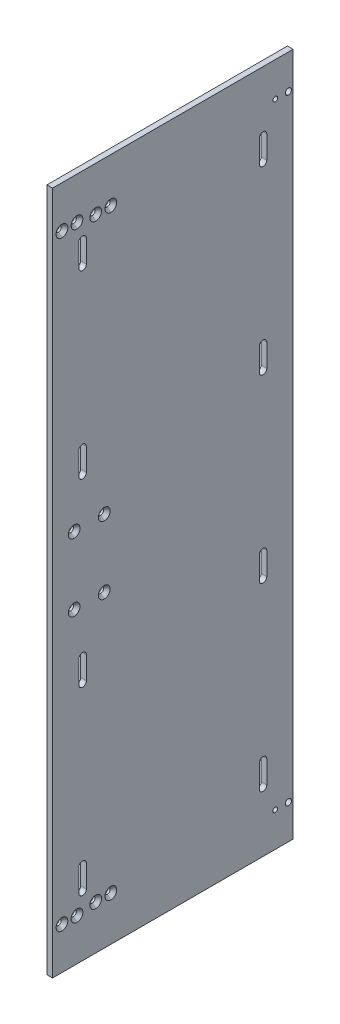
ISO-10303-21;
HEADER;
FILE_DESCRIPTION(('STEP AP214'),'2;1');
FILE_NAME('part.step','',(''),(''),'','','');
FILE_SCHEMA(('AUTOMOTIVE_DESIGN { 1 0 10303 214 1 1 1 1 }'));
ENDSEC;
DATA;
#1=APPLICATION_CONTEXT('core data for automotive mechanical design processes');
#2=APPLICATION_PROTOCOL_DEFINITION('international standard','automotive_design',2000,#1);
#3=PRODUCT_CONTEXT('',#1,'mechanical');
#4=PRODUCT('Part','Part','',(#3));
#5=PRODUCT_RELATED_PRODUCT_CATEGORY('part','',(#4));
#6=PRODUCT_DEFINITION_FORMATION('','',#4);
#7=PRODUCT_DEFINITION_CONTEXT('part definition',#1,'design');
#8=PRODUCT_DEFINITION('design','',#6,#7);
#9=PRODUCT_DEFINITION_SHAPE('','',#8);
#10=(LENGTH_UNIT() NAMED_UNIT(*) SI_UNIT(.MILLI.,.METRE.));
#11=(NAMED_UNIT(*) PLANE_ANGLE_UNIT() SI_UNIT($,.RADIAN.));
#12=(NAMED_UNIT(*) SI_UNIT($,.STERADIAN.) SOLID_ANGLE_UNIT());
#13=UNCERTAINTY_MEASURE_WITH_UNIT(LENGTH_MEASURE(1.E-05),#10,'distance_accuracy_value','');
#14=(GEOMETRIC_REPRESENTATION_CONTEXT(3) GLOBAL_UNCERTAINTY_ASSIGNED_CONTEXT((#13)) GLOBAL_UNIT_ASSIGNED_CONTEXT((#10,
#11,#12)) REPRESENTATION_CONTEXT('',''));
#15=CARTESIAN_POINT('',(0.,0.,0.));
#16=DIRECTION('',(0.,0.,1.));
#17=DIRECTION('',(1.,0.,0.));
#18=AXIS2_PLACEMENT_3D('',#15,#16,#17);
#19=CARTESIAN_POINT('',(4.76250000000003,57.1500000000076,166.6875));
#20=DIRECTION('',(1.,0.,0.));
#21=DIRECTION('',(0.,0.,-1.));
#22=AXIS2_PLACEMENT_3D('',#19,#20,#21);
#23=CONICAL_SURFACE('',#22,9.91869999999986,0.714578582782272);
#24=CARTESIAN_POINT('',(-1.18109999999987,57.1500000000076,166.6875));
#25=DIRECTION('',(1.,0.,0.));
#26=DIRECTION('',(0.,1.,0.));
#27=AXIS2_PLACEMENT_3D('',#24,#25,#26);
#28=CIRCLE('',#27,4.7625);
#29=CARTESIAN_POINT('',(-1.18109999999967,61.9125000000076,166.6875));
#30=VERTEX_POINT('',#29);
#31=CARTESIAN_POINT('',(-1.18109999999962,52.3875000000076,166.6875));
#32=VERTEX_POINT('',#31);
#33=EDGE_CURVE('E773',#30,#32,#28,.F.);
#34=ORIENTED_EDGE('',*,*,#33,.T.);
#35=DIRECTION('',(-0.755369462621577,0.655299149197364,0.));
#36=VECTOR('',#35,1.);
#37=CARTESIAN_POINT('',(1.79070000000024,49.8094000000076,166.6875));
#38=LINE('',#37,#36);
#39=CARTESIAN_POINT('',(4.76250000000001,47.2313000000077,166.6875));
#40=VERTEX_POINT('',#39);
#41=EDGE_CURVE('E788',#32,#40,#38,.F.);
#42=ORIENTED_EDGE('',*,*,#41,.T.);
#43=CARTESIAN_POINT('',(4.76250000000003,57.1500000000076,166.6875));
#44=DIRECTION('',(1.,0.,0.));
#45=DIRECTION('',(0.,0.,-1.));
#46=AXIS2_PLACEMENT_3D('',#43,#44,#45);
#47=CIRCLE('',#46,9.91869999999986);
#48=CARTESIAN_POINT('',(4.76250000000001,67.0687000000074,166.6875));
#49=VERTEX_POINT('',#48);
#50=EDGE_CURVE('E1105',#49,#40,#47,.F.);
#51=ORIENTED_EDGE('',*,*,#50,.F.);
#52=DIRECTION('',(-0.755369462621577,-0.655299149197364,0.));
#53=VECTOR('',#52,1.);
#54=CARTESIAN_POINT('',(1.79070000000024,64.4906000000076,166.6875));
#55=LINE('',#54,#53);
#56=EDGE_CURVE('E770',#49,#30,#55,.T.);
#57=ORIENTED_EDGE('',*,*,#56,.T.);
#58=EDGE_LOOP('',(#34,#42,#51,#57));
#59=FACE_BOUND('',#58,.T.);
#60=ADVANCED_FACE('F16',(#59),#23,.F.);
#61=CARTESIAN_POINT('',(4.76249999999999,57.1500000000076,166.6875));
#62=DIRECTION('',(1.,0.,0.));
#63=DIRECTION('',(0.,0.,-1.));
#64=AXIS2_PLACEMENT_3D('',#61,#62,#63);
#65=CONICAL_SURFACE('',#64,9.91869999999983,0.714578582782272);
#66=CARTESIAN_POINT('',(4.76249999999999,57.1500000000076,166.6875));
#67=DIRECTION('',(1.,0.,0.));
#68=DIRECTION('',(0.,0.,-1.));
#69=AXIS2_PLACEMENT_3D('',#66,#67,#68);
#70=CIRCLE('',#69,9.91869999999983);
#71=EDGE_CURVE('E1101',#40,#49,#70,.F.);
#72=ORIENTED_EDGE('',*,*,#71,.F.);
#73=ORIENTED_EDGE('',*,*,#41,.F.);
#74=CARTESIAN_POINT('',(-1.18109999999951,57.1500000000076,166.6875));
#75=DIRECTION('',(1.,0.,0.));
#76=DIRECTION('',(0.,1.,0.));
#77=AXIS2_PLACEMENT_3D('',#74,#75,#76);
#78=CIRCLE('',#77,4.7625);
#79=EDGE_CURVE('E780',#32,#30,#78,.F.);
#80=ORIENTED_EDGE('',*,*,#79,.T.);
#81=ORIENTED_EDGE('',*,*,#56,.F.);
#82=EDGE_LOOP('',(#72,#73,#80,#81));
#83=FACE_BOUND('',#82,.T.);
#84=ADVANCED_FACE('F1405',(#83),#65,.F.);
#85=CARTESIAN_POINT('',(4.76250000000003,57.1500000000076,115.8875));
#86=DIRECTION('',(1.,0.,0.));
#87=DIRECTION('',(0.,0.,-1.));
#88=AXIS2_PLACEMENT_3D('',#85,#86,#87);
#89=CONICAL_SURFACE('',#88,9.91869999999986,0.714578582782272);
#90=CARTESIAN_POINT('',(-1.18109999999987,57.1500000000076,115.8875));
#91=DIRECTION('',(1.,0.,0.));
#92=DIRECTION('',(0.,1.,0.));
#93=AXIS2_PLACEMENT_3D('',#90,#91,#92);
#94=CIRCLE('',#93,4.7625);
#95=CARTESIAN_POINT('',(-1.18109999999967,61.9125000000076,115.8875));
#96=VERTEX_POINT('',#95);
#97=CARTESIAN_POINT('',(-1.18109999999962,52.3875000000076,115.8875));
#98=VERTEX_POINT('',#97);
#99=EDGE_CURVE('E750',#96,#98,#94,.F.);
#100=ORIENTED_EDGE('',*,*,#99,.T.);
#101=DIRECTION('',(-0.755369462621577,0.655299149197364,0.));
#102=VECTOR('',#101,1.);
#103=CARTESIAN_POINT('',(1.79070000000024,49.8094000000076,115.8875));
#104=LINE('',#103,#102);
#105=CARTESIAN_POINT('',(4.76250000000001,47.2313000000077,115.8875));
#106=VERTEX_POINT('',#105);
#107=EDGE_CURVE('E765',#98,#106,#104,.F.);
#108=ORIENTED_EDGE('',*,*,#107,.T.);
#109=CARTESIAN_POINT('',(4.76250000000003,57.1500000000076,115.8875));
#110=DIRECTION('',(1.,0.,0.));
#111=DIRECTION('',(0.,0.,-1.));
#112=AXIS2_PLACEMENT_3D('',#109,#110,#111);
#113=CIRCLE('',#112,9.91869999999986);
#114=CARTESIAN_POINT('',(4.76250000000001,67.0687000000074,115.8875));
#115=VERTEX_POINT('',#114);
#116=EDGE_CURVE('E1113',#115,#106,#113,.F.);
#117=ORIENTED_EDGE('',*,*,#116,.F.);
#118=DIRECTION('',(-0.755369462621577,-0.655299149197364,0.));
#119=VECTOR('',#118,1.);
#120=CARTESIAN_POINT('',(1.79070000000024,64.4906000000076,115.8875));
#121=LINE('',#120,#119);
#122=EDGE_CURVE('E747',#115,#96,#121,.T.);
#123=ORIENTED_EDGE('',*,*,#122,.T.);
#124=EDGE_LOOP('',(#100,#108,#117,#123));
#125=FACE_BOUND('',#124,.T.);
#126=ADVANCED_FACE('F1402',(#125),#89,.F.);
#127=CARTESIAN_POINT('',(4.76249999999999,57.1500000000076,115.8875));
#128=DIRECTION('',(1.,0.,0.));
#129=DIRECTION('',(0.,0.,-1.));
#130=AXIS2_PLACEMENT_3D('',#127,#128,#129);
#131=CONICAL_SURFACE('',#130,9.91869999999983,0.714578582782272);
#132=CARTESIAN_POINT('',(4.76249999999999,57.1500000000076,115.8875));
#133=DIRECTION('',(1.,0.,0.));
#134=DIRECTION('',(0.,0.,-1.));
#135=AXIS2_PLACEMENT_3D('',#132,#133,#134);
#136=CIRCLE('',#135,9.91869999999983);
#137=EDGE_CURVE('E1109',#106,#115,#136,.F.);
#138=ORIENTED_EDGE('',*,*,#137,.F.);
#139=ORIENTED_EDGE('',*,*,#107,.F.);
#140=CARTESIAN_POINT('',(-1.18109999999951,57.1500000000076,115.8875));
#141=DIRECTION('',(1.,0.,0.));
#142=DIRECTION('',(0.,1.,0.));
#143=AXIS2_PLACEMENT_3D('',#140,#141,#142);
#144=CIRCLE('',#143,4.7625);
#145=EDGE_CURVE('E757',#98,#96,#144,.F.);
#146=ORIENTED_EDGE('',*,*,#145,.T.);
#147=ORIENTED_EDGE('',*,*,#122,.F.);
#148=EDGE_LOOP('',(#138,#139,#146,#147));
#149=FACE_BOUND('',#148,.T.);
#150=ADVANCED_FACE('F1399',(#149),#131,.F.);
#151=CARTESIAN_POINT('',(4.76250000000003,-57.15,115.8875));
#152=DIRECTION('',(1.,0.,0.));
#153=DIRECTION('',(0.,0.,-1.));
#154=AXIS2_PLACEMENT_3D('',#151,#152,#153);
#155=CONICAL_SURFACE('',#154,9.91869999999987,0.714578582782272);
#156=CARTESIAN_POINT('',(-1.18109999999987,-57.15,115.8875));
#157=DIRECTION('',(1.,0.,0.));
#158=DIRECTION('',(0.,1.,0.));
#159=AXIS2_PLACEMENT_3D('',#156,#157,#158);
#160=CIRCLE('',#159,4.7625);
#161=CARTESIAN_POINT('',(-1.18109999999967,-52.3875,115.8875));
#162=VERTEX_POINT('',#161);
#163=CARTESIAN_POINT('',(-1.18109999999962,-61.9125,115.8875));
#164=VERTEX_POINT('',#163);
#165=EDGE_CURVE('E730',#162,#164,#160,.F.);
#166=ORIENTED_EDGE('',*,*,#165,.T.);
#167=DIRECTION('',(-0.755369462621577,0.655299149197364,0.));
#168=VECTOR('',#167,1.);
#169=CARTESIAN_POINT('',(1.79070000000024,-64.4906,115.8875));
#170=LINE('',#169,#168);
#171=CARTESIAN_POINT('',(4.76250000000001,-67.0686999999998,115.8875));
#172=VERTEX_POINT('',#171);
#173=EDGE_CURVE('E743',#164,#172,#170,.F.);
#174=ORIENTED_EDGE('',*,*,#173,.T.);
#175=CARTESIAN_POINT('',(4.76250000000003,-57.15,115.8875));
#176=DIRECTION('',(1.,0.,0.));
#177=DIRECTION('',(0.,0.,-1.));
#178=AXIS2_PLACEMENT_3D('',#175,#176,#177);
#179=CIRCLE('',#178,9.91869999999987);
#180=CARTESIAN_POINT('',(4.76250000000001,-47.2313000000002,115.8875));
#181=VERTEX_POINT('',#180);
#182=EDGE_CURVE('E558',#181,#172,#179,.F.);
#183=ORIENTED_EDGE('',*,*,#182,.F.);
#184=DIRECTION('',(-0.755369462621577,-0.655299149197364,0.));
#185=VECTOR('',#184,1.);
#186=CARTESIAN_POINT('',(1.79070000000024,-49.8094,115.8875));
#187=LINE('',#186,#185);
#188=EDGE_CURVE('E551',#181,#162,#187,.T.);
#189=ORIENTED_EDGE('',*,*,#188,.T.);
#190=EDGE_LOOP('',(#166,#174,#183,#189));
#191=FACE_BOUND('',#190,.T.);
#192=ADVANCED_FACE('F1128',(#191),#155,.F.);
#193=CARTESIAN_POINT('',(4.76249999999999,-57.15,115.8875));
#194=DIRECTION('',(1.,0.,0.));
#195=DIRECTION('',(0.,0.,-1.));
#196=AXIS2_PLACEMENT_3D('',#193,#194,#195);
#197=CONICAL_SURFACE('',#196,9.91869999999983,0.714578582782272);
#198=CARTESIAN_POINT('',(4.7625,-57.15,115.8875));
#199=DIRECTION('',(1.,0.,0.));
#200=DIRECTION('',(0.,0.,-1.));
#201=AXIS2_PLACEMENT_3D('',#198,#199,#200);
#202=CIRCLE('',#201,9.91869999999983);
#203=EDGE_CURVE('E1117',#172,#181,#202,.F.);
#204=ORIENTED_EDGE('',*,*,#203,.F.);
#205=ORIENTED_EDGE('',*,*,#173,.F.);
#206=CARTESIAN_POINT('',(-1.18109999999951,-57.15,115.8875));
#207=DIRECTION('',(1.,0.,0.));
#208=DIRECTION('',(0.,1.,0.));
#209=AXIS2_PLACEMENT_3D('',#206,#207,#208);
#210=CIRCLE('',#209,4.7625);
#211=EDGE_CURVE('E736',#164,#162,#210,.F.);
#212=ORIENTED_EDGE('',*,*,#211,.T.);
#213=ORIENTED_EDGE('',*,*,#188,.F.);
#214=EDGE_LOOP('',(#204,#205,#212,#213));
#215=FACE_BOUND('',#214,.T.);
#216=ADVANCED_FACE('F1131',(#215),#197,.F.);
#217=CARTESIAN_POINT('',(4.76250000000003,-57.15,166.6875));
#218=DIRECTION('',(1.,0.,0.));
#219=DIRECTION('',(0.,0.,-1.));
#220=AXIS2_PLACEMENT_3D('',#217,#218,#219);
#221=CONICAL_SURFACE('',#220,9.91869999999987,0.714578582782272);
#222=CARTESIAN_POINT('',(-1.18109999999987,-57.15,166.6875));
#223=DIRECTION('',(1.,0.,0.));
#224=DIRECTION('',(0.,1.,0.));
#225=AXIS2_PLACEMENT_3D('',#222,#223,#224);
#226=CIRCLE('',#225,4.7625);
#227=CARTESIAN_POINT('',(-1.18109999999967,-52.3875,166.6875));
#228=VERTEX_POINT('',#227);
#229=CARTESIAN_POINT('',(-1.18109999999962,-61.9125,166.6875));
#230=VERTEX_POINT('',#229);
#231=EDGE_CURVE('E544',#228,#230,#226,.F.);
#232=ORIENTED_EDGE('',*,*,#231,.T.);
#233=DIRECTION('',(-0.755369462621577,0.655299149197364,0.));
#234=VECTOR('',#233,1.);
#235=CARTESIAN_POINT('',(1.79070000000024,-64.4906,166.6875));
#236=LINE('',#235,#234);
#237=CARTESIAN_POINT('',(4.76250000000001,-67.0686999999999,166.6875));
#238=VERTEX_POINT('',#237);
#239=EDGE_CURVE('E540',#230,#238,#236,.F.);
#240=ORIENTED_EDGE('',*,*,#239,.T.);
#241=CARTESIAN_POINT('',(4.76250000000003,-57.15,166.6875));
#242=DIRECTION('',(1.,0.,0.));
#243=DIRECTION('',(0.,0.,-1.));
#244=AXIS2_PLACEMENT_3D('',#241,#242,#243);
#245=CIRCLE('',#244,9.91869999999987);
#246=CARTESIAN_POINT('',(4.76250000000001,-47.2313000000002,166.6875));
#247=VERTEX_POINT('',#246);
#248=EDGE_CURVE('E19',#247,#238,#245,.F.);
#249=ORIENTED_EDGE('',*,*,#248,.F.);
#250=DIRECTION('',(-0.755369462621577,-0.655299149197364,0.));
#251=VECTOR('',#250,1.);
#252=CARTESIAN_POINT('',(1.79070000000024,-49.8094,166.6875));
#253=LINE('',#252,#251);
#254=EDGE_CURVE('E550',#247,#228,#253,.T.);
#255=ORIENTED_EDGE('',*,*,#254,.T.);
#256=EDGE_LOOP('',(#232,#240,#249,#255));
#257=FACE_BOUND('',#256,.T.);
#258=ADVANCED_FACE('F542',(#257),#221,.F.);
#259=CARTESIAN_POINT('',(4.7625,-57.15,166.6875));
#260=DIRECTION('',(1.,0.,0.));
#261=DIRECTION('',(0.,0.,-1.));
#262=AXIS2_PLACEMENT_3D('',#259,#260,#261);
#263=CONICAL_SURFACE('',#262,9.91869999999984,0.714578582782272);
#264=CARTESIAN_POINT('',(4.7625,-57.15,166.6875));
#265=DIRECTION('',(1.,0.,0.));
#266=DIRECTION('',(0.,0.,-1.));
#267=AXIS2_PLACEMENT_3D('',#264,#265,#266);
#268=CIRCLE('',#267,9.91869999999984);
#269=EDGE_CURVE('E554',#238,#247,#268,.F.);
#270=ORIENTED_EDGE('',*,*,#269,.F.);
#271=ORIENTED_EDGE('',*,*,#239,.F.);
#272=CARTESIAN_POINT('',(-1.18109999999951,-57.15,166.6875));
#273=DIRECTION('',(1.,0.,0.));
#274=DIRECTION('',(0.,1.,0.));
#275=AXIS2_PLACEMENT_3D('',#272,#273,#274);
#276=CIRCLE('',#275,4.7625);
#277=EDGE_CURVE('E720',#230,#228,#276,.F.);
#278=ORIENTED_EDGE('',*,*,#277,.T.);
#279=ORIENTED_EDGE('',*,*,#254,.F.);
#280=EDGE_LOOP('',(#270,#271,#278,#279));
#281=FACE_BOUND('',#280,.T.);
#282=ADVANCED_FACE('F555',(#281),#263,.F.);
#283=CARTESIAN_POINT('',(4.7625000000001,502.920000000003,104.775));
#284=DIRECTION('',(1.,0.,0.));
#285=DIRECTION('',(0.,0.,-1.));
#286=AXIS2_PLACEMENT_3D('',#283,#284,#285);
#287=CONICAL_SURFACE('',#286,9.91869999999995,0.714578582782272);
#288=CARTESIAN_POINT('',(-1.18109999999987,502.920000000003,104.775));
#289=DIRECTION('',(-1.,0.,0.));
#290=DIRECTION('',(0.,0.,1.));
#291=AXIS2_PLACEMENT_3D('',#288,#289,#290);
#292=CIRCLE('',#291,4.7625);
#293=CARTESIAN_POINT('',(-1.18109999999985,498.157500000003,104.775));
#294=VERTEX_POINT('',#293);
#295=CARTESIAN_POINT('',(-1.18109999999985,507.682500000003,104.775));
#296=VERTEX_POINT('',#295);
#297=EDGE_CURVE('E696',#294,#296,#292,.T.);
#298=ORIENTED_EDGE('',*,*,#297,.T.);
#299=DIRECTION('',(-0.755369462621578,-0.655299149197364,0.));
#300=VECTOR('',#299,1.);
#301=CARTESIAN_POINT('',(1.79070000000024,510.260600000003,104.775));
#302=LINE('',#301,#300);
#303=CARTESIAN_POINT('',(4.76250000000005,512.838700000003,104.775));
#304=VERTEX_POINT('',#303);
#305=EDGE_CURVE('E708',#296,#304,#302,.F.);
#306=ORIENTED_EDGE('',*,*,#305,.T.);
#307=CARTESIAN_POINT('',(4.76250000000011,502.920000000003,104.775));
#308=DIRECTION('',(1.,0.,0.));
#309=DIRECTION('',(0.,0.,-1.));
#310=AXIS2_PLACEMENT_3D('',#307,#308,#309);
#311=CIRCLE('',#310,9.91869999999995);
#312=CARTESIAN_POINT('',(4.76250000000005,493.001300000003,104.775));
#313=VERTEX_POINT('',#312);
#314=EDGE_CURVE('E1098',#313,#304,#311,.F.);
#315=ORIENTED_EDGE('',*,*,#314,.F.);
#316=DIRECTION('',(-0.755369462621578,0.655299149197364,0.));
#317=VECTOR('',#316,1.);
#318=CARTESIAN_POINT('',(1.79070000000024,495.579400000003,104.775));
#319=LINE('',#318,#317);
#320=EDGE_CURVE('E693',#313,#294,#319,.T.);
#321=ORIENTED_EDGE('',*,*,#320,.T.);
#322=EDGE_LOOP('',(#298,#306,#315,#321));
#323=FACE_BOUND('',#322,.T.);
#324=ADVANCED_FACE('F1386',(#323),#287,.F.);
#325=CARTESIAN_POINT('',(4.76249999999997,502.920000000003,104.775));
#326=DIRECTION('',(1.,0.,0.));
#327=DIRECTION('',(0.,0.,-1.));
#328=AXIS2_PLACEMENT_3D('',#325,#326,#327);
#329=CONICAL_SURFACE('',#328,9.91869999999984,0.714578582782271);
#330=CARTESIAN_POINT('',(4.76249999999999,502.920000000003,104.775));
#331=DIRECTION('',(1.,0.,0.));
#332=DIRECTION('',(0.,0.,-1.));
#333=AXIS2_PLACEMENT_3D('',#330,#331,#332);
#334=CIRCLE('',#333,9.91869999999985);
#335=EDGE_CURVE('E1095',#304,#313,#334,.F.);
#336=ORIENTED_EDGE('',*,*,#335,.F.);
#337=ORIENTED_EDGE('',*,*,#305,.F.);
#338=CARTESIAN_POINT('',(-1.18109999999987,502.920000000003,104.775));
#339=DIRECTION('',(-1.,0.,0.));
#340=DIRECTION('',(0.,0.,1.));
#341=AXIS2_PLACEMENT_3D('',#338,#339,#340);
#342=CIRCLE('',#341,4.7625);
#343=EDGE_CURVE('E702',#296,#294,#342,.T.);
#344=ORIENTED_EDGE('',*,*,#343,.T.);
#345=ORIENTED_EDGE('',*,*,#320,.F.);
#346=EDGE_LOOP('',(#336,#337,#344,#345));
#347=FACE_BOUND('',#346,.T.);
#348=ADVANCED_FACE('F1382',(#347),#329,.F.);
#349=CARTESIAN_POINT('',(4.7625000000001,502.920000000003,130.175));
#350=DIRECTION('',(1.,0.,0.));
#351=DIRECTION('',(0.,0.,-1.));
#352=AXIS2_PLACEMENT_3D('',#349,#350,#351);
#353=CONICAL_SURFACE('',#352,9.91869999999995,0.714578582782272);
#354=CARTESIAN_POINT('',(-1.18109999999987,502.920000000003,130.175));
#355=DIRECTION('',(-1.,0.,0.));
#356=DIRECTION('',(0.,0.,1.));
#357=AXIS2_PLACEMENT_3D('',#354,#355,#356);
#358=CIRCLE('',#357,4.7625);
#359=CARTESIAN_POINT('',(-1.18109999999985,498.157500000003,130.175));
#360=VERTEX_POINT('',#359);
#361=CARTESIAN_POINT('',(-1.18109999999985,507.682500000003,130.175));
#362=VERTEX_POINT('',#361);
#363=EDGE_CURVE('E677',#360,#362,#358,.T.);
#364=ORIENTED_EDGE('',*,*,#363,.T.);
#365=DIRECTION('',(-0.755369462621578,-0.655299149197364,0.));
#366=VECTOR('',#365,1.);
#367=CARTESIAN_POINT('',(1.79070000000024,510.260600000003,130.175));
#368=LINE('',#367,#366);
#369=CARTESIAN_POINT('',(4.76250000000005,512.838700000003,130.175));
#370=VERTEX_POINT('',#369);
#371=EDGE_CURVE('E689',#362,#370,#368,.F.);
#372=ORIENTED_EDGE('',*,*,#371,.T.);
#373=CARTESIAN_POINT('',(4.76250000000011,502.920000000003,130.175));
#374=DIRECTION('',(1.,0.,0.));
#375=DIRECTION('',(0.,0.,-1.));
#376=AXIS2_PLACEMENT_3D('',#373,#374,#375);
#377=CIRCLE('',#376,9.91869999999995);
#378=CARTESIAN_POINT('',(4.76250000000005,493.001300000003,130.175));
#379=VERTEX_POINT('',#378);
#380=EDGE_CURVE('E1092',#379,#370,#377,.F.);
#381=ORIENTED_EDGE('',*,*,#380,.F.);
#382=DIRECTION('',(-0.755369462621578,0.655299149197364,0.));
#383=VECTOR('',#382,1.);
#384=CARTESIAN_POINT('',(1.79070000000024,495.579400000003,130.175));
#385=LINE('',#384,#383);
#386=EDGE_CURVE('E674',#379,#360,#385,.T.);
#387=ORIENTED_EDGE('',*,*,#386,.T.);
#388=EDGE_LOOP('',(#364,#372,#381,#387));
#389=FACE_BOUND('',#388,.T.);
#390=ADVANCED_FACE('F1378',(#389),#353,.F.);
#391=CARTESIAN_POINT('',(4.76249999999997,502.920000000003,130.175));
#392=DIRECTION('',(1.,0.,0.));
#393=DIRECTION('',(0.,0.,-1.));
#394=AXIS2_PLACEMENT_3D('',#391,#392,#393);
#395=CONICAL_SURFACE('',#394,9.91869999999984,0.714578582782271);
#396=CARTESIAN_POINT('',(4.76249999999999,502.920000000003,130.175));
#397=DIRECTION('',(1.,0.,0.));
#398=DIRECTION('',(0.,0.,-1.));
#399=AXIS2_PLACEMENT_3D('',#396,#397,#398);
#400=CIRCLE('',#399,9.91869999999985);
#401=EDGE_CURVE('E1089',#370,#379,#400,.F.);
#402=ORIENTED_EDGE('',*,*,#401,.F.);
#403=ORIENTED_EDGE('',*,*,#371,.F.);
#404=CARTESIAN_POINT('',(-1.18109999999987,502.920000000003,130.175));
#405=DIRECTION('',(-1.,0.,0.));
#406=DIRECTION('',(0.,0.,1.));
#407=AXIS2_PLACEMENT_3D('',#404,#405,#406);
#408=CIRCLE('',#407,4.7625);
#409=EDGE_CURVE('E683',#362,#360,#408,.T.);
#410=ORIENTED_EDGE('',*,*,#409,.T.);
#411=ORIENTED_EDGE('',*,*,#386,.F.);
#412=EDGE_LOOP('',(#402,#403,#410,#411));
#413=FACE_BOUND('',#412,.T.);
#414=ADVANCED_FACE('F1374',(#413),#395,.F.);
#415=CARTESIAN_POINT('',(4.76250000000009,-502.919999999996,104.775));
#416=DIRECTION('',(1.,0.,0.));
#417=DIRECTION('',(0.,0.,-1.));
#418=AXIS2_PLACEMENT_3D('',#415,#416,#417);
#419=CONICAL_SURFACE('',#418,9.91869999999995,0.714578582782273);
#420=CARTESIAN_POINT('',(-1.18109999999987,-502.919999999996,104.775));
#421=DIRECTION('',(1.,0.,0.));
#422=DIRECTION('',(0.,0.,-1.));
#423=AXIS2_PLACEMENT_3D('',#420,#421,#422);
#424=CIRCLE('',#423,4.7625);
#425=CARTESIAN_POINT('',(-1.18109999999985,-498.157499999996,104.775));
#426=VERTEX_POINT('',#425);
#427=CARTESIAN_POINT('',(-1.18109999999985,-507.682499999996,104.775));
#428=VERTEX_POINT('',#427);
#429=EDGE_CURVE('E658',#426,#428,#424,.F.);
#430=ORIENTED_EDGE('',*,*,#429,.T.);
#431=DIRECTION('',(-0.755369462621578,0.655299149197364,0.));
#432=VECTOR('',#431,1.);
#433=CARTESIAN_POINT('',(1.79070000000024,-510.260599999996,104.775));
#434=LINE('',#433,#432);
#435=CARTESIAN_POINT('',(4.76250000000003,-512.838699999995,104.775));
#436=VERTEX_POINT('',#435);
#437=EDGE_CURVE('E670',#428,#436,#434,.F.);
#438=ORIENTED_EDGE('',*,*,#437,.T.);
#439=CARTESIAN_POINT('',(4.76250000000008,-502.919999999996,104.775));
#440=DIRECTION('',(1.,0.,0.));
#441=DIRECTION('',(0.,0.,-1.));
#442=AXIS2_PLACEMENT_3D('',#439,#440,#441);
#443=CIRCLE('',#442,9.91869999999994);
#444=CARTESIAN_POINT('',(4.76250000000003,-493.001299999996,104.775));
#445=VERTEX_POINT('',#444);
#446=EDGE_CURVE('E1086',#445,#436,#443,.F.);
#447=ORIENTED_EDGE('',*,*,#446,.F.);
#448=DIRECTION('',(-0.755369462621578,-0.655299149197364,0.));
#449=VECTOR('',#448,1.);
#450=CARTESIAN_POINT('',(1.79070000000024,-495.579399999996,104.775));
#451=LINE('',#450,#449);
#452=EDGE_CURVE('E655',#445,#426,#451,.T.);
#453=ORIENTED_EDGE('',*,*,#452,.T.);
#454=EDGE_LOOP('',(#430,#438,#447,#453));
#455=FACE_BOUND('',#454,.T.);
#456=ADVANCED_FACE('F1370',(#455),#419,.F.);
#457=CARTESIAN_POINT('',(4.76249999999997,-502.919999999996,104.775));
#458=DIRECTION('',(1.,0.,0.));
#459=DIRECTION('',(0.,0.,-1.));
#460=AXIS2_PLACEMENT_3D('',#457,#458,#459);
#461=CONICAL_SURFACE('',#460,9.91869999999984,0.714578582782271);
#462=CARTESIAN_POINT('',(4.76249999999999,-502.919999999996,104.775));
#463=DIRECTION('',(1.,0.,0.));
#464=DIRECTION('',(0.,0.,-1.));
#465=AXIS2_PLACEMENT_3D('',#462,#463,#464);
#466=CIRCLE('',#465,9.91869999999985);
#467=EDGE_CURVE('E1083',#436,#445,#466,.F.);
#468=ORIENTED_EDGE('',*,*,#467,.F.);
#469=ORIENTED_EDGE('',*,*,#437,.F.);
#470=CARTESIAN_POINT('',(-1.18109999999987,-502.919999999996,104.775));
#471=DIRECTION('',(1.,0.,0.));
#472=DIRECTION('',(0.,0.,-1.));
#473=AXIS2_PLACEMENT_3D('',#470,#471,#472);
#474=CIRCLE('',#473,4.7625);
#475=EDGE_CURVE('E664',#428,#426,#474,.F.);
#476=ORIENTED_EDGE('',*,*,#475,.T.);
#477=ORIENTED_EDGE('',*,*,#452,.F.);
#478=EDGE_LOOP('',(#468,#469,#476,#477));
#479=FACE_BOUND('',#478,.T.);
#480=ADVANCED_FACE('F1366',(#479),#461,.F.);
#481=CARTESIAN_POINT('',(4.76250000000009,-502.919999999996,130.175));
#482=DIRECTION('',(1.,0.,0.));
#483=DIRECTION('',(0.,0.,-1.));
#484=AXIS2_PLACEMENT_3D('',#481,#482,#483);
#485=CONICAL_SURFACE('',#484,9.91869999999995,0.714578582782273);
#486=CARTESIAN_POINT('',(-1.18109999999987,-502.919999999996,130.175));
#487=DIRECTION('',(1.,0.,0.));
#488=DIRECTION('',(0.,0.,-1.));
#489=AXIS2_PLACEMENT_3D('',#486,#487,#488);
#490=CIRCLE('',#489,4.7625);
#491=CARTESIAN_POINT('',(-1.18109999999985,-498.157499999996,130.175));
#492=VERTEX_POINT('',#491);
#493=CARTESIAN_POINT('',(-1.18109999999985,-507.682499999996,130.175));
#494=VERTEX_POINT('',#493);
#495=EDGE_CURVE('E639',#492,#494,#490,.F.);
#496=ORIENTED_EDGE('',*,*,#495,.T.);
#497=DIRECTION('',(-0.755369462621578,0.655299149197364,0.));
#498=VECTOR('',#497,1.);
#499=CARTESIAN_POINT('',(1.79070000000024,-510.260599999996,130.175));
#500=LINE('',#499,#498);
#501=CARTESIAN_POINT('',(4.76250000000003,-512.838699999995,130.175));
#502=VERTEX_POINT('',#501);
#503=EDGE_CURVE('E651',#494,#502,#500,.F.);
#504=ORIENTED_EDGE('',*,*,#503,.T.);
#505=CARTESIAN_POINT('',(4.76250000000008,-502.919999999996,130.175));
#506=DIRECTION('',(1.,0.,0.));
#507=DIRECTION('',(0.,0.,-1.));
#508=AXIS2_PLACEMENT_3D('',#505,#506,#507);
#509=CIRCLE('',#508,9.91869999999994);
#510=CARTESIAN_POINT('',(4.76250000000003,-493.001299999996,130.175));
#511=VERTEX_POINT('',#510);
#512=EDGE_CURVE('E1080',#511,#502,#509,.F.);
#513=ORIENTED_EDGE('',*,*,#512,.F.);
#514=DIRECTION('',(-0.755369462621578,-0.655299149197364,0.));
#515=VECTOR('',#514,1.);
#516=CARTESIAN_POINT('',(1.79070000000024,-495.579399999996,130.175));
#517=LINE('',#516,#515);
#518=EDGE_CURVE('E636',#511,#492,#517,.T.);
#519=ORIENTED_EDGE('',*,*,#518,.T.);
#520=EDGE_LOOP('',(#496,#504,#513,#519));
#521=FACE_BOUND('',#520,.T.);
#522=ADVANCED_FACE('F1362',(#521),#485,.F.);
#523=CARTESIAN_POINT('',(4.76249999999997,-502.919999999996,130.175));
#524=DIRECTION('',(1.,0.,0.));
#525=DIRECTION('',(0.,0.,-1.));
#526=AXIS2_PLACEMENT_3D('',#523,#524,#525);
#527=CONICAL_SURFACE('',#526,9.91869999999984,0.714578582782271);
#528=CARTESIAN_POINT('',(4.76249999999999,-502.919999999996,130.175));
#529=DIRECTION('',(1.,0.,0.));
#530=DIRECTION('',(0.,0.,-1.));
#531=AXIS2_PLACEMENT_3D('',#528,#529,#530);
#532=CIRCLE('',#531,9.91869999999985);
#533=EDGE_CURVE('E1077',#502,#511,#532,.F.);
#534=ORIENTED_EDGE('',*,*,#533,.F.);
#535=ORIENTED_EDGE('',*,*,#503,.F.);
#536=CARTESIAN_POINT('',(-1.18109999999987,-502.919999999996,130.175));
#537=DIRECTION('',(1.,0.,0.));
#538=DIRECTION('',(0.,0.,-1.));
#539=AXIS2_PLACEMENT_3D('',#536,#537,#538);
#540=CIRCLE('',#539,4.7625);
#541=EDGE_CURVE('E645',#494,#492,#540,.F.);
#542=ORIENTED_EDGE('',*,*,#541,.T.);
#543=ORIENTED_EDGE('',*,*,#518,.F.);
#544=EDGE_LOOP('',(#534,#535,#542,#543));
#545=FACE_BOUND('',#544,.T.);
#546=ADVANCED_FACE('F1358',(#545),#527,.F.);
#547=CARTESIAN_POINT('',(4.76250000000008,-507.20625,161.925));
#548=DIRECTION('',(1.,0.,0.));
#549=DIRECTION('',(0.,0.,-1.));
#550=AXIS2_PLACEMENT_3D('',#547,#548,#549);
#551=CONICAL_SURFACE('',#550,9.91869999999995,0.714578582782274);
#552=CARTESIAN_POINT('',(-1.18109999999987,-507.20625,161.925));
#553=DIRECTION('',(-1.,0.,0.));
#554=DIRECTION('',(0.,0.,1.));
#555=AXIS2_PLACEMENT_3D('',#552,#553,#554);
#556=CIRCLE('',#555,4.7625);
#557=CARTESIAN_POINT('',(-1.18109999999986,-502.44375,161.925));
#558=VERTEX_POINT('',#557);
#559=CARTESIAN_POINT('',(-1.18109999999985,-511.96875,161.925));
#560=VERTEX_POINT('',#559);
#561=EDGE_CURVE('E620',#558,#560,#556,.T.);
#562=ORIENTED_EDGE('',*,*,#561,.T.);
#563=DIRECTION('',(-0.755369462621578,0.655299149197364,0.));
#564=VECTOR('',#563,1.);
#565=CARTESIAN_POINT('',(1.79070000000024,-514.54685,161.925));
#566=LINE('',#565,#564);
#567=CARTESIAN_POINT('',(4.76250000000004,-517.12495,161.925));
#568=VERTEX_POINT('',#567);
#569=EDGE_CURVE('E632',#560,#568,#566,.F.);
#570=ORIENTED_EDGE('',*,*,#569,.T.);
#571=CARTESIAN_POINT('',(4.76250000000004,-507.20625,161.925));
#572=DIRECTION('',(1.,0.,0.));
#573=DIRECTION('',(0.,0.,-1.));
#574=AXIS2_PLACEMENT_3D('',#571,#572,#573);
#575=CIRCLE('',#574,9.91869999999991);
#576=CARTESIAN_POINT('',(4.76250000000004,-497.28755,161.925));
#577=VERTEX_POINT('',#576);
#578=EDGE_CURVE('E1074',#577,#568,#575,.F.);
#579=ORIENTED_EDGE('',*,*,#578,.F.);
#580=DIRECTION('',(-0.755369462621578,-0.655299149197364,0.));
#581=VECTOR('',#580,1.);
#582=CARTESIAN_POINT('',(1.79070000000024,-499.86565,161.925));
#583=LINE('',#582,#581);
#584=EDGE_CURVE('E617',#577,#558,#583,.T.);
#585=ORIENTED_EDGE('',*,*,#584,.T.);
#586=EDGE_LOOP('',(#562,#570,#579,#585));
#587=FACE_BOUND('',#586,.T.);
#588=ADVANCED_FACE('F1354',(#587),#551,.F.);
#589=CARTESIAN_POINT('',(4.76250000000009,-507.20625,161.925));
#590=DIRECTION('',(1.,0.,0.));
#591=DIRECTION('',(0.,0.,-1.));
#592=AXIS2_PLACEMENT_3D('',#589,#590,#591);
#593=CONICAL_SURFACE('',#592,9.91869999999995,0.714578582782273);
#594=CARTESIAN_POINT('',(4.76250000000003,-507.20625,161.925));
#595=DIRECTION('',(1.,0.,0.));
#596=DIRECTION('',(0.,0.,-1.));
#597=AXIS2_PLACEMENT_3D('',#594,#595,#596);
#598=CIRCLE('',#597,9.9186999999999);
#599=EDGE_CURVE('E1071',#568,#577,#598,.F.);
#600=ORIENTED_EDGE('',*,*,#599,.F.);
#601=ORIENTED_EDGE('',*,*,#569,.F.);
#602=CARTESIAN_POINT('',(-1.18109999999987,-507.20625,161.925));
#603=DIRECTION('',(-1.,0.,0.));
#604=DIRECTION('',(0.,0.,1.));
#605=AXIS2_PLACEMENT_3D('',#602,#603,#604);
#606=CIRCLE('',#605,4.7625);
#607=EDGE_CURVE('E626',#560,#558,#606,.T.);
#608=ORIENTED_EDGE('',*,*,#607,.T.);
#609=ORIENTED_EDGE('',*,*,#584,.F.);
#610=EDGE_LOOP('',(#600,#601,#608,#609));
#611=FACE_BOUND('',#610,.T.);
#612=ADVANCED_FACE('F1350',(#611),#593,.F.);
#613=CARTESIAN_POINT('',(4.76250000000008,-507.20625,187.325));
#614=DIRECTION('',(1.,0.,0.));
#615=DIRECTION('',(0.,0.,-1.));
#616=AXIS2_PLACEMENT_3D('',#613,#614,#615);
#617=CONICAL_SURFACE('',#616,9.91869999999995,0.714578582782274);
#618=CARTESIAN_POINT('',(-1.18109999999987,-507.20625,187.325));
#619=DIRECTION('',(1.,0.,0.));
#620=DIRECTION('',(0.,0.,-1.));
#621=AXIS2_PLACEMENT_3D('',#618,#619,#620);
#622=CIRCLE('',#621,4.7625);
#623=CARTESIAN_POINT('',(-1.18109999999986,-502.44375,187.325));
#624=VERTEX_POINT('',#623);
#625=CARTESIAN_POINT('',(-1.18109999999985,-511.96875,187.325));
#626=VERTEX_POINT('',#625);
#627=EDGE_CURVE('E601',#624,#626,#622,.F.);
#628=ORIENTED_EDGE('',*,*,#627,.T.);
#629=DIRECTION('',(-0.755369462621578,0.655299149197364,0.));
#630=VECTOR('',#629,1.);
#631=CARTESIAN_POINT('',(1.79070000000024,-514.54685,187.325));
#632=LINE('',#631,#630);
#633=CARTESIAN_POINT('',(4.76250000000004,-517.12495,187.325));
#634=VERTEX_POINT('',#633);
#635=EDGE_CURVE('E613',#626,#634,#632,.F.);
#636=ORIENTED_EDGE('',*,*,#635,.T.);
#637=CARTESIAN_POINT('',(4.76250000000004,-507.20625,187.325));
#638=DIRECTION('',(1.,0.,0.));
#639=DIRECTION('',(0.,0.,-1.));
#640=AXIS2_PLACEMENT_3D('',#637,#638,#639);
#641=CIRCLE('',#640,9.91869999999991);
#642=CARTESIAN_POINT('',(4.76250000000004,-497.28755,187.325));
#643=VERTEX_POINT('',#642);
#644=EDGE_CURVE('E1068',#643,#634,#641,.F.);
#645=ORIENTED_EDGE('',*,*,#644,.F.);
#646=DIRECTION('',(-0.755369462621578,-0.655299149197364,0.));
#647=VECTOR('',#646,1.);
#648=CARTESIAN_POINT('',(1.79070000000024,-499.86565,187.325));
#649=LINE('',#648,#647);
#650=EDGE_CURVE('E598',#643,#624,#649,.T.);
#651=ORIENTED_EDGE('',*,*,#650,.T.);
#652=EDGE_LOOP('',(#628,#636,#645,#651));
#653=FACE_BOUND('',#652,.T.);
#654=ADVANCED_FACE('F1346',(#653),#617,.F.);
#655=CARTESIAN_POINT('',(4.76250000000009,-507.20625,187.325));
#656=DIRECTION('',(1.,0.,0.));
#657=DIRECTION('',(0.,0.,-1.));
#658=AXIS2_PLACEMENT_3D('',#655,#656,#657);
#659=CONICAL_SURFACE('',#658,9.91869999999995,0.714578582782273);
#660=CARTESIAN_POINT('',(4.76250000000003,-507.20625,187.325));
#661=DIRECTION('',(1.,0.,0.));
#662=DIRECTION('',(0.,0.,-1.));
#663=AXIS2_PLACEMENT_3D('',#660,#661,#662);
#664=CIRCLE('',#663,9.9186999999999);
#665=EDGE_CURVE('E1065',#634,#643,#664,.F.);
#666=ORIENTED_EDGE('',*,*,#665,.F.);
#667=ORIENTED_EDGE('',*,*,#635,.F.);
#668=CARTESIAN_POINT('',(-1.18109999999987,-507.20625,187.325));
#669=DIRECTION('',(1.,0.,0.));
#670=DIRECTION('',(0.,0.,-1.));
#671=AXIS2_PLACEMENT_3D('',#668,#669,#670);
#672=CIRCLE('',#671,4.7625);
#673=EDGE_CURVE('E607',#626,#624,#672,.F.);
#674=ORIENTED_EDGE('',*,*,#673,.T.);
#675=ORIENTED_EDGE('',*,*,#650,.F.);
#676=EDGE_LOOP('',(#666,#667,#674,#675));
#677=FACE_BOUND('',#676,.T.);
#678=ADVANCED_FACE('F1342',(#677),#659,.F.);
#679=CARTESIAN_POINT('',(4.76250000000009,507.20625,161.925));
#680=DIRECTION('',(1.,0.,0.));
#681=DIRECTION('',(0.,0.,-1.));
#682=AXIS2_PLACEMENT_3D('',#679,#680,#681);
#683=CONICAL_SURFACE('',#682,9.91869999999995,0.714578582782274);
#684=CARTESIAN_POINT('',(-1.18109999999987,507.20625,161.925));
#685=DIRECTION('',(1.,0.,0.));
#686=DIRECTION('',(0.,0.,-1.));
#687=AXIS2_PLACEMENT_3D('',#684,#685,#686);
#688=CIRCLE('',#687,4.7625);
#689=CARTESIAN_POINT('',(-1.18109999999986,502.44375,161.925));
#690=VERTEX_POINT('',#689);
#691=CARTESIAN_POINT('',(-1.18109999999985,511.96875,161.925));
#692=VERTEX_POINT('',#691);
#693=EDGE_CURVE('E581',#690,#692,#688,.F.);
#694=ORIENTED_EDGE('',*,*,#693,.T.);
#695=DIRECTION('',(-0.755369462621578,-0.655299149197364,0.));
#696=VECTOR('',#695,1.);
#697=CARTESIAN_POINT('',(1.79070000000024,514.54685,161.925));
#698=LINE('',#697,#696);
#699=CARTESIAN_POINT('',(4.76250000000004,517.12495,161.925));
#700=VERTEX_POINT('',#699);
#701=EDGE_CURVE('E594',#692,#700,#698,.F.);
#702=ORIENTED_EDGE('',*,*,#701,.T.);
#703=CARTESIAN_POINT('',(4.76250000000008,507.20625,161.925));
#704=DIRECTION('',(1.,0.,0.));
#705=DIRECTION('',(0.,0.,-1.));
#706=AXIS2_PLACEMENT_3D('',#703,#704,#705);
#707=CIRCLE('',#706,9.91869999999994);
#708=CARTESIAN_POINT('',(4.76250000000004,497.28755,161.925));
#709=VERTEX_POINT('',#708);
#710=EDGE_CURVE('E1062',#709,#700,#707,.F.);
#711=ORIENTED_EDGE('',*,*,#710,.F.);
#712=DIRECTION('',(-0.755369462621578,0.655299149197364,0.));
#713=VECTOR('',#712,1.);
#714=CARTESIAN_POINT('',(1.79070000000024,499.86565,161.925));
#715=LINE('',#714,#713);
#716=EDGE_CURVE('E571',#709,#690,#715,.T.);
#717=ORIENTED_EDGE('',*,*,#716,.T.);
#718=EDGE_LOOP('',(#694,#702,#711,#717));
#719=FACE_BOUND('',#718,.T.);
#720=ADVANCED_FACE('F1338',(#719),#683,.F.);
#721=CARTESIAN_POINT('',(4.76250000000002,507.20625,161.925));
#722=DIRECTION('',(1.,0.,0.));
#723=DIRECTION('',(0.,0.,-1.));
#724=AXIS2_PLACEMENT_3D('',#721,#722,#723);
#725=CONICAL_SURFACE('',#724,9.91869999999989,0.714578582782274);
#726=CARTESIAN_POINT('',(4.76250000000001,507.20625,161.925));
#727=DIRECTION('',(1.,0.,0.));
#728=DIRECTION('',(0.,0.,-1.));
#729=AXIS2_PLACEMENT_3D('',#726,#727,#728);
#730=CIRCLE('',#729,9.91869999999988);
#731=EDGE_CURVE('E1059',#700,#709,#730,.F.);
#732=ORIENTED_EDGE('',*,*,#731,.F.);
#733=ORIENTED_EDGE('',*,*,#701,.F.);
#734=CARTESIAN_POINT('',(-1.18109999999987,507.20625,161.925));
#735=DIRECTION('',(1.,0.,0.));
#736=DIRECTION('',(0.,0.,-1.));
#737=AXIS2_PLACEMENT_3D('',#734,#735,#736);
#738=CIRCLE('',#737,4.7625);
#739=EDGE_CURVE('E587',#692,#690,#738,.F.);
#740=ORIENTED_EDGE('',*,*,#739,.T.);
#741=ORIENTED_EDGE('',*,*,#716,.F.);
#742=EDGE_LOOP('',(#732,#733,#740,#741));
#743=FACE_BOUND('',#742,.T.);
#744=ADVANCED_FACE('F1335',(#743),#725,.F.);
#745=CARTESIAN_POINT('',(4.76250000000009,507.20625,187.325));
#746=DIRECTION('',(1.,0.,0.));
#747=DIRECTION('',(0.,0.,-1.));
#748=AXIS2_PLACEMENT_3D('',#745,#746,#747);
#749=CONICAL_SURFACE('',#748,9.91869999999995,0.714578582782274);
#750=CARTESIAN_POINT('',(-1.18109999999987,507.20625,187.325));
#751=DIRECTION('',(-1.,0.,0.));
#752=DIRECTION('',(0.,0.,1.));
#753=AXIS2_PLACEMENT_3D('',#750,#751,#752);
#754=CIRCLE('',#753,4.7625);
#755=CARTESIAN_POINT('',(-1.18109999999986,502.44375,187.325));
#756=VERTEX_POINT('',#755);
#757=CARTESIAN_POINT('',(-1.18109999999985,511.96875,187.325));
#758=VERTEX_POINT('',#757);
#759=EDGE_CURVE('E1217',#756,#758,#754,.T.);
#760=ORIENTED_EDGE('',*,*,#759,.T.);
#761=DIRECTION('',(-0.755369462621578,-0.655299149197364,0.));
#762=VECTOR('',#761,1.);
#763=CARTESIAN_POINT('',(1.79070000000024,514.54685,187.325));
#764=LINE('',#763,#762);
#765=CARTESIAN_POINT('',(4.76250000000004,517.12495,187.325));
#766=VERTEX_POINT('',#765);
#767=EDGE_CURVE('E566',#758,#766,#764,.F.);
#768=ORIENTED_EDGE('',*,*,#767,.T.);
#769=CARTESIAN_POINT('',(4.76250000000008,507.20625,187.325));
#770=DIRECTION('',(1.,0.,0.));
#771=DIRECTION('',(0.,0.,-1.));
#772=AXIS2_PLACEMENT_3D('',#769,#770,#771);
#773=CIRCLE('',#772,9.91869999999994);
#774=CARTESIAN_POINT('',(4.76250000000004,497.28755,187.325));
#775=VERTEX_POINT('',#774);
#776=EDGE_CURVE('E1056',#775,#766,#773,.F.);
#777=ORIENTED_EDGE('',*,*,#776,.F.);
#778=DIRECTION('',(-0.755369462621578,0.655299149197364,0.));
#779=VECTOR('',#778,1.);
#780=CARTESIAN_POINT('',(1.79070000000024,499.86565,187.325));
#781=LINE('',#780,#779);
#782=EDGE_CURVE('E562',#775,#756,#781,.T.);
#783=ORIENTED_EDGE('',*,*,#782,.T.);
#784=EDGE_LOOP('',(#760,#768,#777,#783));
#785=FACE_BOUND('',#784,.T.);
#786=ADVANCED_FACE('F1328',(#785),#749,.F.);
#787=CARTESIAN_POINT('',(4.76250000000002,507.20625,187.325));
#788=DIRECTION('',(1.,0.,0.));
#789=DIRECTION('',(0.,0.,-1.));
#790=AXIS2_PLACEMENT_3D('',#787,#788,#789);
#791=CONICAL_SURFACE('',#790,9.91869999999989,0.714578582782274);
#792=CARTESIAN_POINT('',(4.76250000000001,507.20625,187.325));
#793=DIRECTION('',(1.,0.,0.));
#794=DIRECTION('',(0.,0.,-1.));
#795=AXIS2_PLACEMENT_3D('',#792,#793,#794);
#796=CIRCLE('',#795,9.91869999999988);
#797=EDGE_CURVE('E1053',#766,#775,#796,.F.);
#798=ORIENTED_EDGE('',*,*,#797,.F.);
#799=ORIENTED_EDGE('',*,*,#767,.F.);
#800=CARTESIAN_POINT('',(-1.18109999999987,507.20625,187.325));
#801=DIRECTION('',(-1.,0.,0.));
#802=DIRECTION('',(0.,0.,1.));
#803=AXIS2_PLACEMENT_3D('',#800,#801,#802);
#804=CIRCLE('',#803,4.7625);
#805=EDGE_CURVE('E1221',#758,#756,#804,.T.);
#806=ORIENTED_EDGE('',*,*,#805,.T.);
#807=ORIENTED_EDGE('',*,*,#782,.F.);
#808=EDGE_LOOP('',(#798,#799,#806,#807));
#809=FACE_BOUND('',#808,.T.);
#810=ADVANCED_FACE('F1319',(#809),#791,.F.);
#811=CARTESIAN_POINT('',(4.76249999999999,577.85,203.2));
#812=DIRECTION('',(1.,0.,0.));
#813=DIRECTION('',(0.,0.,-1.));
#814=AXIS2_PLACEMENT_3D('',#811,#812,#813);
#815=PLANE('',#814);
#816=DIRECTION('',(0.,0.,-1.));
#817=VECTOR('',#816,1.);
#818=CARTESIAN_POINT('',(4.76249999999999,577.85,0.));
#819=LINE('',#818,#817);
#820=CARTESIAN_POINT('',(4.76249999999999,577.85,-203.2));
#821=VERTEX_POINT('',#820);
#822=CARTESIAN_POINT('',(4.76249999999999,577.85,203.2));
#823=VERTEX_POINT('',#822);
#824=EDGE_CURVE('E1968',#821,#823,#819,.F.);
#825=ORIENTED_EDGE('',*,*,#824,.T.);
#826=DIRECTION('',(0.,1.,0.));
#827=VECTOR('',#826,1.);
#828=CARTESIAN_POINT('',(4.7625,577.85,203.2));
#829=LINE('',#828,#827);
#830=CARTESIAN_POINT('',(4.7625,-577.85,203.2));
#831=VERTEX_POINT('',#830);
#832=EDGE_CURVE('E1970',#831,#823,#829,.T.);
#833=ORIENTED_EDGE('',*,*,#832,.F.);
#834=DIRECTION('',(0.,0.,-1.));
#835=VECTOR('',#834,1.);
#836=CARTESIAN_POINT('',(4.7625,-577.85,-203.2));
#837=LINE('',#836,#835);
#838=CARTESIAN_POINT('',(4.7625,-577.85,-203.2));
#839=VERTEX_POINT('',#838);
#840=EDGE_CURVE('E1977',#839,#831,#837,.F.);
#841=ORIENTED_EDGE('',*,*,#840,.F.);
#842=DIRECTION('',(0.,1.,0.));
#843=VECTOR('',#842,1.);
#844=CARTESIAN_POINT('',(4.76249999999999,577.85,-203.2));
#845=LINE('',#844,#843);
#846=EDGE_CURVE('E1959',#821,#839,#845,.F.);
#847=ORIENTED_EDGE('',*,*,#846,.F.);
#848=EDGE_LOOP('',(#825,#833,#841,#847));
#849=FACE_BOUND('',#848,.T.);
#850=CARTESIAN_POINT('',(4.76249999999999,171.450000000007,-152.4));
#851=DIRECTION('',(-1.,0.,0.));
#852=DIRECTION('',(0.,0.,1.));
#853=AXIS2_PLACEMENT_3D('',#850,#851,#852);
#854=CIRCLE('',#853,6.35);
#855=CARTESIAN_POINT('',(4.76249999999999,171.450000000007,-146.05));
#856=VERTEX_POINT('',#855);
#857=CARTESIAN_POINT('',(4.76249999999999,171.450000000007,-158.75));
#858=VERTEX_POINT('',#857);
#859=EDGE_CURVE('E964',#856,#858,#854,.T.);
#860=ORIENTED_EDGE('',*,*,#859,.T.);
#861=DIRECTION('',(0.,1.,0.));
#862=VECTOR('',#861,1.);
#863=CARTESIAN_POINT('',(4.76249999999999,133.350000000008,-158.75));
#864=LINE('',#863,#862);
#865=CARTESIAN_POINT('',(4.76249999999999,133.350000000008,-158.75));
#866=VERTEX_POINT('',#865);
#867=EDGE_CURVE('E970',#858,#866,#864,.F.);
#868=ORIENTED_EDGE('',*,*,#867,.T.);
#869=CARTESIAN_POINT('',(4.76249999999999,133.350000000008,-152.4));
#870=DIRECTION('',(-1.,0.,0.));
#871=DIRECTION('',(0.,0.,1.));
#872=AXIS2_PLACEMENT_3D('',#869,#870,#871);
#873=CIRCLE('',#872,6.35);
#874=CARTESIAN_POINT('',(4.76249999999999,133.350000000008,-146.05));
#875=VERTEX_POINT('',#874);
#876=EDGE_CURVE('E968',#866,#875,#873,.T.);
#877=ORIENTED_EDGE('',*,*,#876,.T.);
#878=DIRECTION('',(0.,1.,0.));
#879=VECTOR('',#878,1.);
#880=CARTESIAN_POINT('',(4.76249999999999,171.450000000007,-146.05));
#881=LINE('',#880,#879);
#882=EDGE_CURVE('E1182',#875,#856,#881,.T.);
#883=ORIENTED_EDGE('',*,*,#882,.T.);
#884=EDGE_LOOP('',(#860,#868,#877,#883));
#885=FACE_BOUND('',#884,.T.);
#886=CARTESIAN_POINT('',(4.76249999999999,476.250000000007,-152.4));
#887=DIRECTION('',(-1.,0.,0.));
#888=DIRECTION('',(0.,0.,1.));
#889=AXIS2_PLACEMENT_3D('',#886,#887,#888);
#890=CIRCLE('',#889,6.35);
#891=CARTESIAN_POINT('',(4.76249999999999,476.250000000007,-146.05));
#892=VERTEX_POINT('',#891);
#893=CARTESIAN_POINT('',(4.76249999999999,476.250000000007,-158.75));
#894=VERTEX_POINT('',#893);
#895=EDGE_CURVE('E972',#892,#894,#890,.T.);
#896=ORIENTED_EDGE('',*,*,#895,.T.);
#897=DIRECTION('',(0.,1.,0.));
#898=VECTOR('',#897,1.);
#899=CARTESIAN_POINT('',(4.76249999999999,438.150000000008,-158.75));
#900=LINE('',#899,#898);
#901=CARTESIAN_POINT('',(4.76249999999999,438.150000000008,-158.75));
#902=VERTEX_POINT('',#901);
#903=EDGE_CURVE('E978',#894,#902,#900,.F.);
#904=ORIENTED_EDGE('',*,*,#903,.T.);
#905=CARTESIAN_POINT('',(4.76249999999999,438.150000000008,-152.4));
#906=DIRECTION('',(-1.,0.,0.));
#907=DIRECTION('',(0.,0.,1.));
#908=AXIS2_PLACEMENT_3D('',#905,#906,#907);
#909=CIRCLE('',#908,6.35);
#910=CARTESIAN_POINT('',(4.76249999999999,438.150000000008,-146.05));
#911=VERTEX_POINT('',#910);
#912=EDGE_CURVE('E976',#902,#911,#909,.T.);
#913=ORIENTED_EDGE('',*,*,#912,.T.);
#914=DIRECTION('',(0.,1.,0.));
#915=VECTOR('',#914,1.);
#916=CARTESIAN_POINT('',(4.76249999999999,476.250000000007,-146.05));
#917=LINE('',#916,#915);
#918=EDGE_CURVE('E1187',#911,#892,#917,.T.);
#919=ORIENTED_EDGE('',*,*,#918,.T.);
#920=EDGE_LOOP('',(#896,#904,#913,#919));
#921=FACE_BOUND('',#920,.T.);
#922=CARTESIAN_POINT('',(4.76249999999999,476.250000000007,152.4));
#923=DIRECTION('',(-1.,0.,0.));
#924=DIRECTION('',(0.,0.,1.));
#925=AXIS2_PLACEMENT_3D('',#922,#923,#924);
#926=CIRCLE('',#925,6.35);
#927=CARTESIAN_POINT('',(4.76249999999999,476.250000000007,158.75));
#928=VERTEX_POINT('',#927);
#929=CARTESIAN_POINT('',(4.76249999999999,476.250000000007,146.05));
#930=VERTEX_POINT('',#929);
#931=EDGE_CURVE('E980',#928,#930,#926,.T.);
#932=ORIENTED_EDGE('',*,*,#931,.T.);
#933=DIRECTION('',(0.,1.,0.));
#934=VECTOR('',#933,1.);
#935=CARTESIAN_POINT('',(4.76249999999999,438.150000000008,146.05));
#936=LINE('',#935,#934);
#937=CARTESIAN_POINT('',(4.76249999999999,438.150000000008,146.05));
#938=VERTEX_POINT('',#937);
#939=EDGE_CURVE('E986',#930,#938,#936,.F.);
#940=ORIENTED_EDGE('',*,*,#939,.T.);
#941=CARTESIAN_POINT('',(4.76249999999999,438.150000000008,152.4));
#942=DIRECTION('',(-1.,0.,0.));
#943=DIRECTION('',(0.,0.,1.));
#944=AXIS2_PLACEMENT_3D('',#941,#942,#943);
#945=CIRCLE('',#944,6.35);
#946=CARTESIAN_POINT('',(4.76249999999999,438.150000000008,158.75));
#947=VERTEX_POINT('',#946);
#948=EDGE_CURVE('E984',#938,#947,#945,.T.);
#949=ORIENTED_EDGE('',*,*,#948,.T.);
#950=DIRECTION('',(0.,1.,0.));
#951=VECTOR('',#950,1.);
#952=CARTESIAN_POINT('',(4.76249999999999,476.250000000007,158.75));
#953=LINE('',#952,#951);
#954=EDGE_CURVE('E1191',#947,#928,#953,.T.);
#955=ORIENTED_EDGE('',*,*,#954,.T.);
#956=EDGE_LOOP('',(#932,#940,#949,#955));
#957=FACE_BOUND('',#956,.T.);
#958=CARTESIAN_POINT('',(4.76249999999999,171.450000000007,152.4));
#959=DIRECTION('',(-1.,0.,0.));
#960=DIRECTION('',(0.,0.,1.));
#961=AXIS2_PLACEMENT_3D('',#958,#959,#960);
#962=CIRCLE('',#961,6.35);
#963=CARTESIAN_POINT('',(4.76249999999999,171.450000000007,158.75));
#964=VERTEX_POINT('',#963);
#965=CARTESIAN_POINT('',(4.76249999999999,171.450000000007,146.05));
#966=VERTEX_POINT('',#965);
#967=EDGE_CURVE('E988',#964,#966,#962,.T.);
#968=ORIENTED_EDGE('',*,*,#967,.T.);
#969=DIRECTION('',(0.,1.,0.));
#970=VECTOR('',#969,1.);
#971=CARTESIAN_POINT('',(4.76249999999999,133.350000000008,146.05));
#972=LINE('',#971,#970);
#973=CARTESIAN_POINT('',(4.76249999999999,133.350000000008,146.05));
#974=VERTEX_POINT('',#973);
#975=EDGE_CURVE('E996',#966,#974,#972,.F.);
#976=ORIENTED_EDGE('',*,*,#975,.T.);
#977=CARTESIAN_POINT('',(4.76249999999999,133.350000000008,152.4));
#978=DIRECTION('',(-1.,0.,0.));
#979=DIRECTION('',(0.,0.,1.));
#980=AXIS2_PLACEMENT_3D('',#977,#978,#979);
#981=CIRCLE('',#980,6.35);
#982=CARTESIAN_POINT('',(4.76249999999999,133.350000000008,158.75));
#983=VERTEX_POINT('',#982);
#984=EDGE_CURVE('E993',#974,#983,#981,.T.);
#985=ORIENTED_EDGE('',*,*,#984,.T.);
#986=DIRECTION('',(0.,1.,0.));
#987=VECTOR('',#986,1.);
#988=CARTESIAN_POINT('',(4.76249999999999,171.450000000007,158.75));
#989=LINE('',#988,#987);
#990=EDGE_CURVE('E1195',#983,#964,#989,.T.);
#991=ORIENTED_EDGE('',*,*,#990,.T.);
#992=EDGE_LOOP('',(#968,#976,#985,#991));
#993=FACE_BOUND('',#992,.T.);
#994=CARTESIAN_POINT('',(4.76249999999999,-438.15,152.4));
#995=DIRECTION('',(-1.,0.,0.));
#996=DIRECTION('',(0.,0.,1.));
#997=AXIS2_PLACEMENT_3D('',#994,#995,#996);
#998=CIRCLE('',#997,6.35);
#999=CARTESIAN_POINT('',(4.76249999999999,-438.15,158.75));
#1000=VERTEX_POINT('',#999);
#1001=CARTESIAN_POINT('',(4.76249999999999,-438.15,146.05));
#1002=VERTEX_POINT('',#1001);
#1003=EDGE_CURVE('E998',#1000,#1002,#998,.T.);
#1004=ORIENTED_EDGE('',*,*,#1003,.T.);
#1005=DIRECTION('',(0.,1.,0.));
#1006=VECTOR('',#1005,1.);
#1007=CARTESIAN_POINT('',(4.76249999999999,-476.25,146.05));
#1008=LINE('',#1007,#1006);
#1009=CARTESIAN_POINT('',(4.76249999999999,-476.25,146.05));
#1010=VERTEX_POINT('',#1009);
#1011=EDGE_CURVE('E1004',#1002,#1010,#1008,.F.);
#1012=ORIENTED_EDGE('',*,*,#1011,.T.);
#1013=CARTESIAN_POINT('',(4.76249999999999,-476.25,152.4));
#1014=DIRECTION('',(-1.,0.,0.));
#1015=DIRECTION('',(0.,0.,1.));
#1016=AXIS2_PLACEMENT_3D('',#1013,#1014,#1015);
#1017=CIRCLE('',#1016,6.35);
#1018=CARTESIAN_POINT('',(4.76249999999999,-476.25,158.75));
#1019=VERTEX_POINT('',#1018);
#1020=EDGE_CURVE('E1002',#1010,#1019,#1017,.T.);
#1021=ORIENTED_EDGE('',*,*,#1020,.T.);
#1022=DIRECTION('',(0.,1.,0.));
#1023=VECTOR('',#1022,1.);
#1024=CARTESIAN_POINT('',(4.76249999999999,-438.15,158.75));
#1025=LINE('',#1024,#1023);
#1026=EDGE_CURVE('E1201',#1019,#1000,#1025,.T.);
#1027=ORIENTED_EDGE('',*,*,#1026,.T.);
#1028=EDGE_LOOP('',(#1004,#1012,#1021,#1027));
#1029=FACE_BOUND('',#1028,.T.);
#1030=CARTESIAN_POINT('',(4.76249999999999,-438.15,-152.4));
#1031=DIRECTION('',(-1.,0.,0.));
#1032=DIRECTION('',(0.,0.,1.));
#1033=AXIS2_PLACEMENT_3D('',#1030,#1031,#1032);
#1034=CIRCLE('',#1033,6.35);
#1035=CARTESIAN_POINT('',(4.76249999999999,-438.15,-146.05));
#1036=VERTEX_POINT('',#1035);
#1037=CARTESIAN_POINT('',(4.76249999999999,-438.15,-158.75));
#1038=VERTEX_POINT('',#1037);
#1039=EDGE_CURVE('E1006',#1036,#1038,#1034,.T.);
#1040=ORIENTED_EDGE('',*,*,#1039,.T.);
#1041=DIRECTION('',(0.,1.,0.));
#1042=VECTOR('',#1041,1.);
#1043=CARTESIAN_POINT('',(4.76249999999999,-476.25,-158.75));
#1044=LINE('',#1043,#1042);
#1045=CARTESIAN_POINT('',(4.76249999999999,-476.25,-158.75));
#1046=VERTEX_POINT('',#1045);
#1047=EDGE_CURVE('E1012',#1038,#1046,#1044,.F.);
#1048=ORIENTED_EDGE('',*,*,#1047,.T.);
#1049=CARTESIAN_POINT('',(4.76249999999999,-476.25,-152.4));
#1050=DIRECTION('',(-1.,0.,0.));
#1051=DIRECTION('',(0.,0.,1.));
#1052=AXIS2_PLACEMENT_3D('',#1049,#1050,#1051);
#1053=CIRCLE('',#1052,6.35);
#1054=CARTESIAN_POINT('',(4.76249999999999,-476.25,-146.05));
#1055=VERTEX_POINT('',#1054);
#1056=EDGE_CURVE('E1010',#1046,#1055,#1053,.T.);
#1057=ORIENTED_EDGE('',*,*,#1056,.T.);
#1058=DIRECTION('',(0.,1.,0.));
#1059=VECTOR('',#1058,1.);
#1060=CARTESIAN_POINT('',(4.76249999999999,-438.15,-146.05));
#1061=LINE('',#1060,#1059);
#1062=EDGE_CURVE('E1205',#1055,#1036,#1061,.T.);
#1063=ORIENTED_EDGE('',*,*,#1062,.T.);
#1064=EDGE_LOOP('',(#1040,#1048,#1057,#1063));
#1065=FACE_BOUND('',#1064,.T.);
#1066=CARTESIAN_POINT('',(4.76249999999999,-133.35,-152.4));
#1067=DIRECTION('',(-1.,0.,0.));
#1068=DIRECTION('',(0.,0.,1.));
#1069=AXIS2_PLACEMENT_3D('',#1066,#1067,#1068);
#1070=CIRCLE('',#1069,6.35);
#1071=CARTESIAN_POINT('',(4.76249999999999,-133.35,-146.05));
#1072=VERTEX_POINT('',#1071);
#1073=CARTESIAN_POINT('',(4.76249999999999,-133.35,-158.75));
#1074=VERTEX_POINT('',#1073);
#1075=EDGE_CURVE('E1014',#1072,#1074,#1070,.T.);
#1076=ORIENTED_EDGE('',*,*,#1075,.T.);
#1077=DIRECTION('',(0.,1.,0.));
#1078=VECTOR('',#1077,1.);
#1079=CARTESIAN_POINT('',(4.76249999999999,-171.45,-158.75));
#1080=LINE('',#1079,#1078);
#1081=CARTESIAN_POINT('',(4.76249999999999,-171.45,-158.75));
#1082=VERTEX_POINT('',#1081);
#1083=EDGE_CURVE('E1020',#1074,#1082,#1080,.F.);
#1084=ORIENTED_EDGE('',*,*,#1083,.T.);
#1085=CARTESIAN_POINT('',(4.76249999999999,-171.45,-152.4));
#1086=DIRECTION('',(-1.,0.,0.));
#1087=DIRECTION('',(0.,0.,1.));
#1088=AXIS2_PLACEMENT_3D('',#1085,#1086,#1087);
#1089=CIRCLE('',#1088,6.35);
#1090=CARTESIAN_POINT('',(4.76249999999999,-171.45,-146.05));
#1091=VERTEX_POINT('',#1090);
#1092=EDGE_CURVE('E1018',#1082,#1091,#1089,.T.);
#1093=ORIENTED_EDGE('',*,*,#1092,.T.);
#1094=DIRECTION('',(0.,1.,0.));
#1095=VECTOR('',#1094,1.);
#1096=CARTESIAN_POINT('',(4.76249999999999,-133.35,-146.05));
#1097=LINE('',#1096,#1095);
#1098=EDGE_CURVE('E1209',#1091,#1072,#1097,.T.);
#1099=ORIENTED_EDGE('',*,*,#1098,.T.);
#1100=EDGE_LOOP('',(#1076,#1084,#1093,#1099));
#1101=FACE_BOUND('',#1100,.T.);
#1102=CARTESIAN_POINT('',(4.76249999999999,-133.35,152.4));
#1103=DIRECTION('',(-1.,0.,0.));
#1104=DIRECTION('',(0.,0.,1.));
#1105=AXIS2_PLACEMENT_3D('',#1102,#1103,#1104);
#1106=CIRCLE('',#1105,6.35);
#1107=CARTESIAN_POINT('',(4.76249999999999,-133.35,158.75));
#1108=VERTEX_POINT('',#1107);
#1109=CARTESIAN_POINT('',(4.76249999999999,-133.35,146.05));
#1110=VERTEX_POINT('',#1109);
#1111=EDGE_CURVE('E1022',#1108,#1110,#1106,.T.);
#1112=ORIENTED_EDGE('',*,*,#1111,.T.);
#1113=DIRECTION('',(0.,1.,0.));
#1114=VECTOR('',#1113,1.);
#1115=CARTESIAN_POINT('',(4.76249999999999,-171.45,146.05));
#1116=LINE('',#1115,#1114);
#1117=CARTESIAN_POINT('',(4.76249999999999,-171.45,146.05));
#1118=VERTEX_POINT('',#1117);
#1119=EDGE_CURVE('E1028',#1110,#1118,#1116,.F.);
#1120=ORIENTED_EDGE('',*,*,#1119,.T.);
#1121=CARTESIAN_POINT('',(4.76249999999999,-171.45,152.4));
#1122=DIRECTION('',(-1.,0.,0.));
#1123=DIRECTION('',(0.,0.,1.));
#1124=AXIS2_PLACEMENT_3D('',#1121,#1122,#1123);
#1125=CIRCLE('',#1124,6.35);
#1126=CARTESIAN_POINT('',(4.76249999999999,-171.45,158.75));
#1127=VERTEX_POINT('',#1126);
#1128=EDGE_CURVE('E1026',#1118,#1127,#1125,.T.);
#1129=ORIENTED_EDGE('',*,*,#1128,.T.);
#1130=DIRECTION('',(0.,1.,0.));
#1131=VECTOR('',#1130,1.);
#1132=CARTESIAN_POINT('',(4.76249999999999,-133.35,158.75));
#1133=LINE('',#1132,#1131);
#1134=EDGE_CURVE('E1213',#1127,#1108,#1133,.T.);
#1135=ORIENTED_EDGE('',*,*,#1134,.T.);
#1136=EDGE_LOOP('',(#1112,#1120,#1129,#1135));
#1137=FACE_BOUND('',#1136,.T.);
#1138=ORIENTED_EDGE('',*,*,#776,.T.);
#1139=ORIENTED_EDGE('',*,*,#797,.T.);
#1140=EDGE_LOOP('',(#1138,#1139));
#1141=FACE_BOUND('',#1140,.T.);
#1142=ORIENTED_EDGE('',*,*,#710,.T.);
#1143=ORIENTED_EDGE('',*,*,#731,.T.);
#1144=EDGE_LOOP('',(#1142,#1143));
#1145=FACE_BOUND('',#1144,.T.);
#1146=ORIENTED_EDGE('',*,*,#644,.T.);
#1147=ORIENTED_EDGE('',*,*,#665,.T.);
#1148=EDGE_LOOP('',(#1146,#1147));
#1149=FACE_BOUND('',#1148,.T.);
#1150=ORIENTED_EDGE('',*,*,#578,.T.);
#1151=ORIENTED_EDGE('',*,*,#599,.T.);
#1152=EDGE_LOOP('',(#1150,#1151));
#1153=FACE_BOUND('',#1152,.T.);
#1154=ORIENTED_EDGE('',*,*,#512,.T.);
#1155=ORIENTED_EDGE('',*,*,#533,.T.);
#1156=EDGE_LOOP('',(#1154,#1155));
#1157=FACE_BOUND('',#1156,.T.);
#1158=ORIENTED_EDGE('',*,*,#446,.T.);
#1159=ORIENTED_EDGE('',*,*,#467,.T.);
#1160=EDGE_LOOP('',(#1158,#1159));
#1161=FACE_BOUND('',#1160,.T.);
#1162=ORIENTED_EDGE('',*,*,#380,.T.);
#1163=ORIENTED_EDGE('',*,*,#401,.T.);
#1164=EDGE_LOOP('',(#1162,#1163));
#1165=FACE_BOUND('',#1164,.T.);
#1166=ORIENTED_EDGE('',*,*,#314,.T.);
#1167=ORIENTED_EDGE('',*,*,#335,.T.);
#1168=EDGE_LOOP('',(#1166,#1167));
#1169=FACE_BOUND('',#1168,.T.);
#1170=ORIENTED_EDGE('',*,*,#50,.T.);
#1171=ORIENTED_EDGE('',*,*,#71,.T.);
#1172=EDGE_LOOP('',(#1170,#1171));
#1173=FACE_BOUND('',#1172,.T.);
#1174=ORIENTED_EDGE('',*,*,#116,.T.);
#1175=ORIENTED_EDGE('',*,*,#137,.T.);
#1176=EDGE_LOOP('',(#1174,#1175));
#1177=FACE_BOUND('',#1176,.T.);
#1178=ORIENTED_EDGE('',*,*,#182,.T.);
#1179=ORIENTED_EDGE('',*,*,#203,.T.);
#1180=EDGE_LOOP('',(#1178,#1179));
#1181=FACE_BOUND('',#1180,.T.);
#1182=ORIENTED_EDGE('',*,*,#248,.T.);
#1183=ORIENTED_EDGE('',*,*,#269,.T.);
#1184=EDGE_LOOP('',(#1182,#1183));
#1185=FACE_BOUND('',#1184,.T.);
#1186=CARTESIAN_POINT('',(4.76249999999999,519.90625,-195.2625));
#1187=DIRECTION('',(1.,0.,0.));
#1188=DIRECTION('',(0.,0.,-1.));
#1189=AXIS2_PLACEMENT_3D('',#1186,#1187,#1188);
#1190=CIRCLE('',#1189,5.159375);
#1191=CARTESIAN_POINT('',(4.76249999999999,514.746875,-195.2625));
#1192=VERTEX_POINT('',#1191);
#1193=CARTESIAN_POINT('',(4.76249999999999,525.065625,-195.2625));
#1194=VERTEX_POINT('',#1193);
#1195=EDGE_CURVE('E1030',#1192,#1194,#1190,.F.);
#1196=ORIENTED_EDGE('',*,*,#1195,.T.);
#1197=CARTESIAN_POINT('',(4.76249999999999,519.90625,-195.2625));
#1198=DIRECTION('',(1.,0.,0.));
#1199=DIRECTION('',(0.,0.,-1.));
#1200=AXIS2_PLACEMENT_3D('',#1197,#1198,#1199);
#1201=CIRCLE('',#1200,5.159375);
#1202=EDGE_CURVE('E1033',#1194,#1192,#1201,.F.);
#1203=ORIENTED_EDGE('',*,*,#1202,.T.);
#1204=EDGE_LOOP('',(#1196,#1203));
#1205=FACE_BOUND('',#1204,.T.);
#1206=CARTESIAN_POINT('',(4.76249999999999,-519.90625,-195.2625));
#1207=DIRECTION('',(1.,0.,0.));
#1208=DIRECTION('',(0.,0.,-1.));
#1209=AXIS2_PLACEMENT_3D('',#1206,#1207,#1208);
#1210=CIRCLE('',#1209,5.159375);
#1211=CARTESIAN_POINT('',(4.76249999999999,-525.065625,-195.2625));
#1212=VERTEX_POINT('',#1211);
#1213=CARTESIAN_POINT('',(4.76249999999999,-514.746875,-195.2625));
#1214=VERTEX_POINT('',#1213);
#1215=EDGE_CURVE('E1036',#1212,#1214,#1210,.F.);
#1216=ORIENTED_EDGE('',*,*,#1215,.T.);
#1217=CARTESIAN_POINT('',(4.76249999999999,-519.90625,-195.2625));
#1218=DIRECTION('',(1.,0.,0.));
#1219=DIRECTION('',(0.,0.,-1.));
#1220=AXIS2_PLACEMENT_3D('',#1217,#1218,#1219);
#1221=CIRCLE('',#1220,5.159375);
#1222=EDGE_CURVE('E1039',#1214,#1212,#1221,.F.);
#1223=ORIENTED_EDGE('',*,*,#1222,.T.);
#1224=EDGE_LOOP('',(#1216,#1223));
#1225=FACE_BOUND('',#1224,.T.);
#1226=CARTESIAN_POINT('',(4.76249999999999,-519.90625,-173.0375));
#1227=DIRECTION('',(1.,0.,0.));
#1228=DIRECTION('',(0.,0.,-1.));
#1229=AXIS2_PLACEMENT_3D('',#1226,#1227,#1228);
#1230=CIRCLE('',#1229,3.96875);
#1231=CARTESIAN_POINT('',(4.76249999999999,-515.9375,-173.0375));
#1232=VERTEX_POINT('',#1231);
#1233=CARTESIAN_POINT('',(4.76249999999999,-523.875,-173.0375));
#1234=VERTEX_POINT('',#1233);
#1235=EDGE_CURVE('E1042',#1232,#1234,#1230,.F.);
#1236=ORIENTED_EDGE('',*,*,#1235,.T.);
#1237=CARTESIAN_POINT('',(4.76249999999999,-519.90625,-173.0375));
#1238=DIRECTION('',(1.,0.,0.));
#1239=DIRECTION('',(0.,0.,-1.));
#1240=AXIS2_PLACEMENT_3D('',#1237,#1238,#1239);
#1241=CIRCLE('',#1240,3.96875);
#1242=EDGE_CURVE('E1045',#1234,#1232,#1241,.F.);
#1243=ORIENTED_EDGE('',*,*,#1242,.T.);
#1244=EDGE_LOOP('',(#1236,#1243));
#1245=FACE_BOUND('',#1244,.T.);
#1246=CARTESIAN_POINT('',(4.76249999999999,519.90625,-173.0375));
#1247=DIRECTION('',(-1.,0.,0.));
#1248=DIRECTION('',(0.,0.,1.));
#1249=AXIS2_PLACEMENT_3D('',#1246,#1247,#1248);
#1250=CIRCLE('',#1249,3.96875);
#1251=CARTESIAN_POINT('',(4.76249999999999,515.9375,-173.0375));
#1252=VERTEX_POINT('',#1251);
#1253=CARTESIAN_POINT('',(4.76249999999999,523.875,-173.0375));
#1254=VERTEX_POINT('',#1253);
#1255=EDGE_CURVE('E1048',#1252,#1254,#1250,.T.);
#1256=ORIENTED_EDGE('',*,*,#1255,.T.);
#1257=CARTESIAN_POINT('',(4.76249999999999,519.90625,-173.0375));
#1258=DIRECTION('',(-1.,0.,0.));
#1259=DIRECTION('',(0.,0.,1.));
#1260=AXIS2_PLACEMENT_3D('',#1257,#1258,#1259);
#1261=CIRCLE('',#1260,3.96875);
#1262=EDGE_CURVE('E1051',#1254,#1252,#1261,.T.);
#1263=ORIENTED_EDGE('',*,*,#1262,.T.);
#1264=EDGE_LOOP('',(#1256,#1263));
#1265=FACE_BOUND('',#1264,.T.);
#1266=ADVANCED_FACE('F559',(#849,#885,#921,#957,#993,#1029,#1065,#1101,#1137,#1141,#1145,#1149,
#1153,#1157,#1161,#1165,#1169,#1173,#1177,#1181,#1185,#1205,#1225,#1245,#1265),#815,.T.);
#1267=CARTESIAN_POINT('',(0.,519.90625,-173.0375));
#1268=DIRECTION('',(-1.,0.,0.));
#1269=DIRECTION('',(0.,0.,1.));
#1270=AXIS2_PLACEMENT_3D('',#1267,#1268,#1269);
#1271=CYLINDRICAL_SURFACE('',#1270,3.96875);
#1272=ORIENTED_EDGE('',*,*,#1262,.F.);
#1273=DIRECTION('',(-1.,0.,0.));
#1274=VECTOR('',#1273,1.);
#1275=CARTESIAN_POINT('',(0.,523.875,-173.0375));
#1276=LINE('',#1275,#1274);
#1277=CARTESIAN_POINT('',(-4.7625,523.875,-173.0375));
#1278=VERTEX_POINT('',#1277);
#1279=EDGE_CURVE('E1050',#1254,#1278,#1276,.T.);
#1280=ORIENTED_EDGE('',*,*,#1279,.T.);
#1281=CARTESIAN_POINT('',(-4.7625,519.90625,-173.0375));
#1282=DIRECTION('',(-1.,0.,0.));
#1283=DIRECTION('',(0.,0.,1.));
#1284=AXIS2_PLACEMENT_3D('',#1281,#1282,#1283);
#1285=CIRCLE('',#1284,3.96875);
#1286=CARTESIAN_POINT('',(-4.7625,515.9375,-173.0375));
#1287=VERTEX_POINT('',#1286);
#1288=EDGE_CURVE('E960',#1287,#1278,#1285,.F.);
#1289=ORIENTED_EDGE('',*,*,#1288,.F.);
#1290=DIRECTION('',(-1.,0.,0.));
#1291=VECTOR('',#1290,1.);
#1292=CARTESIAN_POINT('',(0.,515.9375,-173.0375));
#1293=LINE('',#1292,#1291);
#1294=EDGE_CURVE('E1047',#1287,#1252,#1293,.F.);
#1295=ORIENTED_EDGE('',*,*,#1294,.T.);
#1296=EDGE_LOOP('',(#1272,#1280,#1289,#1295));
#1297=FACE_BOUND('',#1296,.T.);
#1298=ADVANCED_FACE('F1312',(#1297),#1271,.F.);
#1299=CARTESIAN_POINT('',(0.,519.90625,-173.0375));
#1300=DIRECTION('',(-1.,0.,0.));
#1301=DIRECTION('',(0.,0.,1.));
#1302=AXIS2_PLACEMENT_3D('',#1299,#1300,#1301);
#1303=CYLINDRICAL_SURFACE('',#1302,3.96875);
#1304=CARTESIAN_POINT('',(-4.7625,519.90625,-173.0375));
#1305=DIRECTION('',(-1.,0.,0.));
#1306=DIRECTION('',(0.,0.,1.));
#1307=AXIS2_PLACEMENT_3D('',#1304,#1305,#1306);
#1308=CIRCLE('',#1307,3.96875);
#1309=EDGE_CURVE('E957',#1278,#1287,#1308,.F.);
#1310=ORIENTED_EDGE('',*,*,#1309,.F.);
#1311=ORIENTED_EDGE('',*,*,#1279,.F.);
#1312=ORIENTED_EDGE('',*,*,#1255,.F.);
#1313=ORIENTED_EDGE('',*,*,#1294,.F.);
#1314=EDGE_LOOP('',(#1310,#1311,#1312,#1313));
#1315=FACE_BOUND('',#1314,.T.);
#1316=ADVANCED_FACE('F1316',(#1315),#1303,.F.);
#1317=CARTESIAN_POINT('',(0.,-519.90625,-173.0375));
#1318=DIRECTION('',(1.,0.,0.));
#1319=DIRECTION('',(0.,0.,-1.));
#1320=AXIS2_PLACEMENT_3D('',#1317,#1318,#1319);
#1321=CYLINDRICAL_SURFACE('',#1320,3.96875);
#1322=ORIENTED_EDGE('',*,*,#1242,.F.);
#1323=DIRECTION('',(1.,0.,0.));
#1324=VECTOR('',#1323,1.);
#1325=CARTESIAN_POINT('',(0.,-523.875,-173.0375));
#1326=LINE('',#1325,#1324);
#1327=CARTESIAN_POINT('',(-4.7625,-523.875,-173.0375));
#1328=VERTEX_POINT('',#1327);
#1329=EDGE_CURVE('E1044',#1234,#1328,#1326,.F.);
#1330=ORIENTED_EDGE('',*,*,#1329,.T.);
#1331=CARTESIAN_POINT('',(-4.7625,-519.90625,-173.0375));
#1332=DIRECTION('',(1.,0.,0.));
#1333=DIRECTION('',(0.,0.,-1.));
#1334=AXIS2_PLACEMENT_3D('',#1331,#1332,#1333);
#1335=CIRCLE('',#1334,3.96875);
#1336=CARTESIAN_POINT('',(-4.7625,-515.9375,-173.0375));
#1337=VERTEX_POINT('',#1336);
#1338=EDGE_CURVE('E954',#1337,#1328,#1335,.T.);
#1339=ORIENTED_EDGE('',*,*,#1338,.F.);
#1340=DIRECTION('',(1.,0.,0.));
#1341=VECTOR('',#1340,1.);
#1342=CARTESIAN_POINT('',(0.,-515.9375,-173.0375));
#1343=LINE('',#1342,#1341);
#1344=EDGE_CURVE('E1041',#1337,#1232,#1343,.T.);
#1345=ORIENTED_EDGE('',*,*,#1344,.T.);
#1346=EDGE_LOOP('',(#1322,#1330,#1339,#1345));
#1347=FACE_BOUND('',#1346,.T.);
#1348=ADVANCED_FACE('F1459',(#1347),#1321,.F.);
#1349=CARTESIAN_POINT('',(0.,-519.90625,-173.0375));
#1350=DIRECTION('',(1.,0.,0.));
#1351=DIRECTION('',(0.,0.,-1.));
#1352=AXIS2_PLACEMENT_3D('',#1349,#1350,#1351);
#1353=CYLINDRICAL_SURFACE('',#1352,3.96875);
#1354=CARTESIAN_POINT('',(-4.7625,-519.90625,-173.0375));
#1355=DIRECTION('',(1.,0.,0.));
#1356=DIRECTION('',(0.,0.,-1.));
#1357=AXIS2_PLACEMENT_3D('',#1354,#1355,#1356);
#1358=CIRCLE('',#1357,3.96875);
#1359=EDGE_CURVE('E951',#1328,#1337,#1358,.T.);
#1360=ORIENTED_EDGE('',*,*,#1359,.F.);
#1361=ORIENTED_EDGE('',*,*,#1329,.F.);
#1362=ORIENTED_EDGE('',*,*,#1235,.F.);
#1363=ORIENTED_EDGE('',*,*,#1344,.F.);
#1364=EDGE_LOOP('',(#1360,#1361,#1362,#1363));
#1365=FACE_BOUND('',#1364,.T.);
#1366=ADVANCED_FACE('F1455',(#1365),#1353,.F.);
#1367=CARTESIAN_POINT('',(4.76249999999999,-519.90625,-195.2625));
#1368=DIRECTION('',(1.,0.,0.));
#1369=DIRECTION('',(0.,0.,-1.));
#1370=AXIS2_PLACEMENT_3D('',#1367,#1368,#1369);
#1371=CYLINDRICAL_SURFACE('',#1370,5.159375);
#1372=CARTESIAN_POINT('',(-4.7625,-519.90625,-195.2625));
#1373=DIRECTION('',(1.,0.,0.));
#1374=DIRECTION('',(0.,0.,-1.));
#1375=AXIS2_PLACEMENT_3D('',#1372,#1373,#1374);
#1376=CIRCLE('',#1375,5.159375);
#1377=CARTESIAN_POINT('',(-4.7625,-525.065625,-195.2625));
#1378=VERTEX_POINT('',#1377);
#1379=CARTESIAN_POINT('',(-4.7625,-514.746875,-195.2625));
#1380=VERTEX_POINT('',#1379);
#1381=EDGE_CURVE('E948',#1378,#1380,#1376,.T.);
#1382=ORIENTED_EDGE('',*,*,#1381,.F.);
#1383=DIRECTION('',(1.,0.,0.));
#1384=VECTOR('',#1383,1.);
#1385=CARTESIAN_POINT('',(4.76249999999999,-525.065625,-195.2625));
#1386=LINE('',#1385,#1384);
#1387=EDGE_CURVE('E1038',#1378,#1212,#1386,.T.);
#1388=ORIENTED_EDGE('',*,*,#1387,.T.);
#1389=ORIENTED_EDGE('',*,*,#1222,.F.);
#1390=DIRECTION('',(1.,0.,0.));
#1391=VECTOR('',#1390,1.);
#1392=CARTESIAN_POINT('',(4.76249999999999,-514.746875,-195.2625));
#1393=LINE('',#1392,#1391);
#1394=EDGE_CURVE('E1035',#1214,#1380,#1393,.F.);
#1395=ORIENTED_EDGE('',*,*,#1394,.T.);
#1396=EDGE_LOOP('',(#1382,#1388,#1389,#1395));
#1397=FACE_BOUND('',#1396,.T.);
#1398=ADVANCED_FACE('F1451',(#1397),#1371,.F.);
#1399=CARTESIAN_POINT('',(4.76249999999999,-519.90625,-195.2625));
#1400=DIRECTION('',(1.,0.,0.));
#1401=DIRECTION('',(0.,0.,-1.));
#1402=AXIS2_PLACEMENT_3D('',#1399,#1400,#1401);
#1403=CYLINDRICAL_SURFACE('',#1402,5.159375);
#1404=ORIENTED_EDGE('',*,*,#1215,.F.);
#1405=ORIENTED_EDGE('',*,*,#1387,.F.);
#1406=CARTESIAN_POINT('',(-4.7625,-519.90625,-195.2625));
#1407=DIRECTION('',(1.,0.,0.));
#1408=DIRECTION('',(0.,0.,-1.));
#1409=AXIS2_PLACEMENT_3D('',#1406,#1407,#1408);
#1410=CIRCLE('',#1409,5.159375);
#1411=EDGE_CURVE('E945',#1380,#1378,#1410,.T.);
#1412=ORIENTED_EDGE('',*,*,#1411,.F.);
#1413=ORIENTED_EDGE('',*,*,#1394,.F.);
#1414=EDGE_LOOP('',(#1404,#1405,#1412,#1413));
#1415=FACE_BOUND('',#1414,.T.);
#1416=ADVANCED_FACE('F1447',(#1415),#1403,.F.);
#1417=CARTESIAN_POINT('',(-0.723618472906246,519.90625,-195.2625));
#1418=DIRECTION('',(1.,0.,0.));
#1419=DIRECTION('',(0.,0.,-1.));
#1420=AXIS2_PLACEMENT_3D('',#1417,#1418,#1419);
#1421=CYLINDRICAL_SURFACE('',#1420,5.159375);
#1422=CARTESIAN_POINT('',(-4.7625,519.90625,-195.2625));
#1423=DIRECTION('',(1.,0.,0.));
#1424=DIRECTION('',(0.,0.,-1.));
#1425=AXIS2_PLACEMENT_3D('',#1422,#1423,#1424);
#1426=CIRCLE('',#1425,5.159375);
#1427=CARTESIAN_POINT('',(-4.7625,514.746875,-195.2625));
#1428=VERTEX_POINT('',#1427);
#1429=CARTESIAN_POINT('',(-4.7625,525.065625,-195.2625));
#1430=VERTEX_POINT('',#1429);
#1431=EDGE_CURVE('E942',#1428,#1430,#1426,.T.);
#1432=ORIENTED_EDGE('',*,*,#1431,.F.);
#1433=DIRECTION('',(1.,0.,0.));
#1434=VECTOR('',#1433,1.);
#1435=CARTESIAN_POINT('',(-0.723618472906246,514.746875,-195.2625));
#1436=LINE('',#1435,#1434);
#1437=EDGE_CURVE('E1032',#1428,#1192,#1436,.T.);
#1438=ORIENTED_EDGE('',*,*,#1437,.T.);
#1439=ORIENTED_EDGE('',*,*,#1202,.F.);
#1440=DIRECTION('',(1.,0.,0.));
#1441=VECTOR('',#1440,1.);
#1442=CARTESIAN_POINT('',(-0.723618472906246,525.065625,-195.2625));
#1443=LINE('',#1442,#1441);
#1444=EDGE_CURVE('E777',#1194,#1430,#1443,.F.);
#1445=ORIENTED_EDGE('',*,*,#1444,.T.);
#1446=EDGE_LOOP('',(#1432,#1438,#1439,#1445));
#1447=FACE_BOUND('',#1446,.T.);
#1448=ADVANCED_FACE('F1443',(#1447),#1421,.F.);
#1449=CARTESIAN_POINT('',(-0.723618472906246,519.90625,-195.2625));
#1450=DIRECTION('',(1.,0.,0.));
#1451=DIRECTION('',(0.,0.,-1.));
#1452=AXIS2_PLACEMENT_3D('',#1449,#1450,#1451);
#1453=CYLINDRICAL_SURFACE('',#1452,5.159375);
#1454=ORIENTED_EDGE('',*,*,#1195,.F.);
#1455=ORIENTED_EDGE('',*,*,#1437,.F.);
#1456=CARTESIAN_POINT('',(-4.7625,519.90625,-195.2625));
#1457=DIRECTION('',(1.,0.,0.));
#1458=DIRECTION('',(0.,0.,-1.));
#1459=AXIS2_PLACEMENT_3D('',#1456,#1457,#1458);
#1460=CIRCLE('',#1459,5.159375);
#1461=EDGE_CURVE('E939',#1430,#1428,#1460,.T.);
#1462=ORIENTED_EDGE('',*,*,#1461,.F.);
#1463=ORIENTED_EDGE('',*,*,#1444,.F.);
#1464=EDGE_LOOP('',(#1454,#1455,#1462,#1463));
#1465=FACE_BOUND('',#1464,.T.);
#1466=ADVANCED_FACE('F1437',(#1465),#1453,.F.);
#1467=CARTESIAN_POINT('',(-7.53109999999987,57.1500000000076,166.6875));
#1468=DIRECTION('',(1.,0.,0.));
#1469=DIRECTION('',(0.,1.,0.));
#1470=AXIS2_PLACEMENT_3D('',#1467,#1468,#1469);
#1471=CYLINDRICAL_SURFACE('',#1470,4.7625);
#1472=CARTESIAN_POINT('',(-4.7625,57.1500000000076,166.6875));
#1473=DIRECTION('',(1.,0.,0.));
#1474=DIRECTION('',(0.,1.,0.));
#1475=AXIS2_PLACEMENT_3D('',#1472,#1473,#1474);
#1476=CIRCLE('',#1475,4.7625);
#1477=CARTESIAN_POINT('',(-4.7625,52.3875000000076,166.6875));
#1478=VERTEX_POINT('',#1477);
#1479=CARTESIAN_POINT('',(-4.7625,61.9125000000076,166.6875));
#1480=VERTEX_POINT('',#1479);
#1481=EDGE_CURVE('E935',#1478,#1480,#1476,.T.);
#1482=ORIENTED_EDGE('',*,*,#1481,.F.);
#1483=DIRECTION('',(1.,0.,0.));
#1484=VECTOR('',#1483,1.);
#1485=CARTESIAN_POINT('',(-7.53109999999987,52.3875000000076,166.6875));
#1486=LINE('',#1485,#1484);
#1487=EDGE_CURVE('E776',#1478,#32,#1486,.T.);
#1488=ORIENTED_EDGE('',*,*,#1487,.T.);
#1489=ORIENTED_EDGE('',*,*,#33,.F.);
#1490=DIRECTION('',(1.,0.,0.));
#1491=VECTOR('',#1490,1.);
#1492=CARTESIAN_POINT('',(-7.53109999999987,61.9125000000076,166.6875));
#1493=LINE('',#1492,#1491);
#1494=EDGE_CURVE('E754',#30,#1480,#1493,.F.);
#1495=ORIENTED_EDGE('',*,*,#1494,.T.);
#1496=EDGE_LOOP('',(#1482,#1488,#1489,#1495));
#1497=FACE_BOUND('',#1496,.T.);
#1498=ADVANCED_FACE('F1423',(#1497),#1471,.F.);
#1499=CARTESIAN_POINT('',(-7.53109999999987,57.1500000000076,166.6875));
#1500=DIRECTION('',(1.,0.,0.));
#1501=DIRECTION('',(0.,1.,0.));
#1502=AXIS2_PLACEMENT_3D('',#1499,#1500,#1501);
#1503=CYLINDRICAL_SURFACE('',#1502,4.7625);
#1504=ORIENTED_EDGE('',*,*,#79,.F.);
#1505=ORIENTED_EDGE('',*,*,#1487,.F.);
#1506=CARTESIAN_POINT('',(-4.7625,57.1500000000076,166.6875));
#1507=DIRECTION('',(1.,0.,0.));
#1508=DIRECTION('',(0.,1.,0.));
#1509=AXIS2_PLACEMENT_3D('',#1506,#1507,#1508);
#1510=CIRCLE('',#1509,4.7625);
#1511=EDGE_CURVE('E931',#1480,#1478,#1510,.T.);
#1512=ORIENTED_EDGE('',*,*,#1511,.F.);
#1513=ORIENTED_EDGE('',*,*,#1494,.F.);
#1514=EDGE_LOOP('',(#1504,#1505,#1512,#1513));
#1515=FACE_BOUND('',#1514,.T.);
#1516=ADVANCED_FACE('F1426',(#1515),#1503,.F.);
#1517=CARTESIAN_POINT('',(-7.53109999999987,57.1500000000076,115.8875));
#1518=DIRECTION('',(1.,0.,0.));
#1519=DIRECTION('',(0.,1.,0.));
#1520=AXIS2_PLACEMENT_3D('',#1517,#1518,#1519);
#1521=CYLINDRICAL_SURFACE('',#1520,4.7625);
#1522=CARTESIAN_POINT('',(-4.7625,57.1500000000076,115.8875));
#1523=DIRECTION('',(1.,0.,0.));
#1524=DIRECTION('',(0.,1.,0.));
#1525=AXIS2_PLACEMENT_3D('',#1522,#1523,#1524);
#1526=CIRCLE('',#1525,4.7625);
#1527=CARTESIAN_POINT('',(-4.7625,52.3875000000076,115.8875));
#1528=VERTEX_POINT('',#1527);
#1529=CARTESIAN_POINT('',(-4.7625,61.9125000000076,115.8875));
#1530=VERTEX_POINT('',#1529);
#1531=EDGE_CURVE('E927',#1528,#1530,#1526,.T.);
#1532=ORIENTED_EDGE('',*,*,#1531,.F.);
#1533=DIRECTION('',(1.,0.,0.));
#1534=VECTOR('',#1533,1.);
#1535=CARTESIAN_POINT('',(-7.53109999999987,52.3875000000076,115.8875));
#1536=LINE('',#1535,#1534);
#1537=EDGE_CURVE('E753',#1528,#98,#1536,.T.);
#1538=ORIENTED_EDGE('',*,*,#1537,.T.);
#1539=ORIENTED_EDGE('',*,*,#99,.F.);
#1540=DIRECTION('',(1.,0.,0.));
#1541=VECTOR('',#1540,1.);
#1542=CARTESIAN_POINT('',(-7.53109999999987,61.9125000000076,115.8875));
#1543=LINE('',#1542,#1541);
#1544=EDGE_CURVE('E733',#96,#1530,#1543,.F.);
#1545=ORIENTED_EDGE('',*,*,#1544,.T.);
#1546=EDGE_LOOP('',(#1532,#1538,#1539,#1545));
#1547=FACE_BOUND('',#1546,.T.);
#1548=ADVANCED_FACE('F1428',(#1547),#1521,.F.);
#1549=CARTESIAN_POINT('',(-7.53109999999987,57.1500000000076,115.8875));
#1550=DIRECTION('',(1.,0.,0.));
#1551=DIRECTION('',(0.,1.,0.));
#1552=AXIS2_PLACEMENT_3D('',#1549,#1550,#1551);
#1553=CYLINDRICAL_SURFACE('',#1552,4.7625);
#1554=ORIENTED_EDGE('',*,*,#145,.F.);
#1555=ORIENTED_EDGE('',*,*,#1537,.F.);
#1556=CARTESIAN_POINT('',(-4.7625,57.1500000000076,115.8875));
#1557=DIRECTION('',(1.,0.,0.));
#1558=DIRECTION('',(0.,1.,0.));
#1559=AXIS2_PLACEMENT_3D('',#1556,#1557,#1558);
#1560=CIRCLE('',#1559,4.7625);
#1561=EDGE_CURVE('E923',#1530,#1528,#1560,.T.);
#1562=ORIENTED_EDGE('',*,*,#1561,.F.);
#1563=ORIENTED_EDGE('',*,*,#1544,.F.);
#1564=EDGE_LOOP('',(#1554,#1555,#1562,#1563));
#1565=FACE_BOUND('',#1564,.T.);
#1566=ADVANCED_FACE('F1434',(#1565),#1553,.F.);
#1567=CARTESIAN_POINT('',(-7.53109999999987,-57.15,115.8875));
#1568=DIRECTION('',(1.,0.,0.));
#1569=DIRECTION('',(0.,1.,0.));
#1570=AXIS2_PLACEMENT_3D('',#1567,#1568,#1569);
#1571=CYLINDRICAL_SURFACE('',#1570,4.7625);
#1572=CARTESIAN_POINT('',(-4.7625,-57.15,115.8875));
#1573=DIRECTION('',(1.,0.,0.));
#1574=DIRECTION('',(0.,1.,0.));
#1575=AXIS2_PLACEMENT_3D('',#1572,#1573,#1574);
#1576=CIRCLE('',#1575,4.7625);
#1577=CARTESIAN_POINT('',(-4.7625,-61.9125,115.8875));
#1578=VERTEX_POINT('',#1577);
#1579=CARTESIAN_POINT('',(-4.7625,-52.3875,115.8875));
#1580=VERTEX_POINT('',#1579);
#1581=EDGE_CURVE('E920',#1578,#1580,#1576,.T.);
#1582=ORIENTED_EDGE('',*,*,#1581,.F.);
#1583=DIRECTION('',(1.,0.,0.));
#1584=VECTOR('',#1583,1.);
#1585=CARTESIAN_POINT('',(-7.53109999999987,-61.9125,115.8875));
#1586=LINE('',#1585,#1584);
#1587=EDGE_CURVE('E732',#1578,#164,#1586,.T.);
#1588=ORIENTED_EDGE('',*,*,#1587,.T.);
#1589=ORIENTED_EDGE('',*,*,#165,.F.);
#1590=DIRECTION('',(1.,0.,0.));
#1591=VECTOR('',#1590,1.);
#1592=CARTESIAN_POINT('',(-7.53109999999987,-52.3875,115.8875));
#1593=LINE('',#1592,#1591);
#1594=EDGE_CURVE('E717',#162,#1580,#1593,.F.);
#1595=ORIENTED_EDGE('',*,*,#1594,.T.);
#1596=EDGE_LOOP('',(#1582,#1588,#1589,#1595));
#1597=FACE_BOUND('',#1596,.T.);
#1598=ADVANCED_FACE('F1139',(#1597),#1571,.F.);
#1599=CARTESIAN_POINT('',(-7.53109999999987,-57.15,115.8875));
#1600=DIRECTION('',(1.,0.,0.));
#1601=DIRECTION('',(0.,1.,0.));
#1602=AXIS2_PLACEMENT_3D('',#1599,#1600,#1601);
#1603=CYLINDRICAL_SURFACE('',#1602,4.7625);
#1604=ORIENTED_EDGE('',*,*,#211,.F.);
#1605=ORIENTED_EDGE('',*,*,#1587,.F.);
#1606=CARTESIAN_POINT('',(-4.7625,-57.15,115.8875));
#1607=DIRECTION('',(1.,0.,0.));
#1608=DIRECTION('',(0.,1.,0.));
#1609=AXIS2_PLACEMENT_3D('',#1606,#1607,#1608);
#1610=CIRCLE('',#1609,4.7625);
#1611=EDGE_CURVE('E917',#1580,#1578,#1610,.T.);
#1612=ORIENTED_EDGE('',*,*,#1611,.F.);
#1613=ORIENTED_EDGE('',*,*,#1594,.F.);
#1614=EDGE_LOOP('',(#1604,#1605,#1612,#1613));
#1615=FACE_BOUND('',#1614,.T.);
#1616=ADVANCED_FACE('F1141',(#1615),#1603,.F.);
#1617=CARTESIAN_POINT('',(-7.53109999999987,-57.15,166.6875));
#1618=DIRECTION('',(1.,0.,0.));
#1619=DIRECTION('',(0.,1.,0.));
#1620=AXIS2_PLACEMENT_3D('',#1617,#1618,#1619);
#1621=CYLINDRICAL_SURFACE('',#1620,4.7625);
#1622=CARTESIAN_POINT('',(-4.7625,-57.15,166.6875));
#1623=DIRECTION('',(1.,0.,0.));
#1624=DIRECTION('',(0.,1.,0.));
#1625=AXIS2_PLACEMENT_3D('',#1622,#1623,#1624);
#1626=CIRCLE('',#1625,4.7625);
#1627=CARTESIAN_POINT('',(-4.7625,-61.9125,166.6875));
#1628=VERTEX_POINT('',#1627);
#1629=CARTESIAN_POINT('',(-4.7625,-52.3875,166.6875));
#1630=VERTEX_POINT('',#1629);
#1631=EDGE_CURVE('E913',#1628,#1630,#1626,.T.);
#1632=ORIENTED_EDGE('',*,*,#1631,.F.);
#1633=DIRECTION('',(1.,0.,0.));
#1634=VECTOR('',#1633,1.);
#1635=CARTESIAN_POINT('',(-7.53109999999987,-61.9125,166.6875));
#1636=LINE('',#1635,#1634);
#1637=EDGE_CURVE('E716',#1628,#230,#1636,.T.);
#1638=ORIENTED_EDGE('',*,*,#1637,.T.);
#1639=ORIENTED_EDGE('',*,*,#231,.F.);
#1640=DIRECTION('',(1.,0.,0.));
#1641=VECTOR('',#1640,1.);
#1642=CARTESIAN_POINT('',(-7.53109999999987,-52.3875,166.6875));
#1643=LINE('',#1642,#1641);
#1644=EDGE_CURVE('E699',#228,#1630,#1643,.F.);
#1645=ORIENTED_EDGE('',*,*,#1644,.T.);
#1646=EDGE_LOOP('',(#1632,#1638,#1639,#1645));
#1647=FACE_BOUND('',#1646,.T.);
#1648=ADVANCED_FACE('F1290',(#1647),#1621,.F.);
#1649=CARTESIAN_POINT('',(-7.53109999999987,-57.15,166.6875));
#1650=DIRECTION('',(1.,0.,0.));
#1651=DIRECTION('',(0.,1.,0.));
#1652=AXIS2_PLACEMENT_3D('',#1649,#1650,#1651);
#1653=CYLINDRICAL_SURFACE('',#1652,4.7625);
#1654=ORIENTED_EDGE('',*,*,#277,.F.);
#1655=ORIENTED_EDGE('',*,*,#1637,.F.);
#1656=CARTESIAN_POINT('',(-4.7625,-57.15,166.6875));
#1657=DIRECTION('',(1.,0.,0.));
#1658=DIRECTION('',(0.,1.,0.));
#1659=AXIS2_PLACEMENT_3D('',#1656,#1657,#1658);
#1660=CIRCLE('',#1659,4.7625);
#1661=EDGE_CURVE('E909',#1630,#1628,#1660,.T.);
#1662=ORIENTED_EDGE('',*,*,#1661,.F.);
#1663=ORIENTED_EDGE('',*,*,#1644,.F.);
#1664=EDGE_LOOP('',(#1654,#1655,#1662,#1663));
#1665=FACE_BOUND('',#1664,.T.);
#1666=ADVANCED_FACE('F1294',(#1665),#1653,.F.);
#1667=CARTESIAN_POINT('',(-17.0560999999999,502.920000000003,104.775));
#1668=DIRECTION('',(-1.,0.,0.));
#1669=DIRECTION('',(0.,0.,1.));
#1670=AXIS2_PLACEMENT_3D('',#1667,#1668,#1669);
#1671=CYLINDRICAL_SURFACE('',#1670,4.7625);
#1672=CARTESIAN_POINT('',(-4.7625,502.920000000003,104.775));
#1673=DIRECTION('',(-1.,0.,0.));
#1674=DIRECTION('',(0.,0.,1.));
#1675=AXIS2_PLACEMENT_3D('',#1672,#1673,#1674);
#1676=CIRCLE('',#1675,4.7625);
#1677=CARTESIAN_POINT('',(-4.7625,507.682500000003,104.775));
#1678=VERTEX_POINT('',#1677);
#1679=CARTESIAN_POINT('',(-4.7625,498.157500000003,104.775));
#1680=VERTEX_POINT('',#1679);
#1681=EDGE_CURVE('E906',#1678,#1680,#1676,.F.);
#1682=ORIENTED_EDGE('',*,*,#1681,.F.);
#1683=DIRECTION('',(-1.,0.,0.));
#1684=VECTOR('',#1683,1.);
#1685=CARTESIAN_POINT('',(-17.0560999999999,507.682500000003,104.775));
#1686=LINE('',#1685,#1684);
#1687=EDGE_CURVE('E698',#1678,#296,#1686,.F.);
#1688=ORIENTED_EDGE('',*,*,#1687,.T.);
#1689=ORIENTED_EDGE('',*,*,#297,.F.);
#1690=DIRECTION('',(-1.,0.,0.));
#1691=VECTOR('',#1690,1.);
#1692=CARTESIAN_POINT('',(-17.0560999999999,498.157500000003,104.775));
#1693=LINE('',#1692,#1691);
#1694=EDGE_CURVE('E680',#294,#1680,#1693,.T.);
#1695=ORIENTED_EDGE('',*,*,#1694,.T.);
#1696=EDGE_LOOP('',(#1682,#1688,#1689,#1695));
#1697=FACE_BOUND('',#1696,.T.);
#1698=ADVANCED_FACE('F1538',(#1697),#1671,.F.);
#1699=CARTESIAN_POINT('',(-17.0560999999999,502.920000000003,104.775));
#1700=DIRECTION('',(-1.,0.,0.));
#1701=DIRECTION('',(0.,0.,1.));
#1702=AXIS2_PLACEMENT_3D('',#1699,#1700,#1701);
#1703=CYLINDRICAL_SURFACE('',#1702,4.7625);
#1704=ORIENTED_EDGE('',*,*,#343,.F.);
#1705=ORIENTED_EDGE('',*,*,#1687,.F.);
#1706=CARTESIAN_POINT('',(-4.7625,502.920000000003,104.775));
#1707=DIRECTION('',(-1.,0.,0.));
#1708=DIRECTION('',(0.,0.,1.));
#1709=AXIS2_PLACEMENT_3D('',#1706,#1707,#1708);
#1710=CIRCLE('',#1709,4.7625);
#1711=EDGE_CURVE('E903',#1680,#1678,#1710,.F.);
#1712=ORIENTED_EDGE('',*,*,#1711,.F.);
#1713=ORIENTED_EDGE('',*,*,#1694,.F.);
#1714=EDGE_LOOP('',(#1704,#1705,#1712,#1713));
#1715=FACE_BOUND('',#1714,.T.);
#1716=ADVANCED_FACE('F1545',(#1715),#1703,.F.);
#1717=CARTESIAN_POINT('',(-17.0560999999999,502.920000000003,130.175));
#1718=DIRECTION('',(-1.,0.,0.));
#1719=DIRECTION('',(0.,0.,1.));
#1720=AXIS2_PLACEMENT_3D('',#1717,#1718,#1719);
#1721=CYLINDRICAL_SURFACE('',#1720,4.7625);
#1722=CARTESIAN_POINT('',(-4.7625,502.920000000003,130.175));
#1723=DIRECTION('',(-1.,0.,0.));
#1724=DIRECTION('',(0.,0.,1.));
#1725=AXIS2_PLACEMENT_3D('',#1722,#1723,#1724);
#1726=CIRCLE('',#1725,4.7625);
#1727=CARTESIAN_POINT('',(-4.7625,507.682500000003,130.175));
#1728=VERTEX_POINT('',#1727);
#1729=CARTESIAN_POINT('',(-4.7625,498.157500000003,130.175));
#1730=VERTEX_POINT('',#1729);
#1731=EDGE_CURVE('E900',#1728,#1730,#1726,.F.);
#1732=ORIENTED_EDGE('',*,*,#1731,.F.);
#1733=DIRECTION('',(-1.,0.,0.));
#1734=VECTOR('',#1733,1.);
#1735=CARTESIAN_POINT('',(-17.0560999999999,507.682500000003,130.175));
#1736=LINE('',#1735,#1734);
#1737=EDGE_CURVE('E679',#1728,#362,#1736,.F.);
#1738=ORIENTED_EDGE('',*,*,#1737,.T.);
#1739=ORIENTED_EDGE('',*,*,#363,.F.);
#1740=DIRECTION('',(-1.,0.,0.));
#1741=VECTOR('',#1740,1.);
#1742=CARTESIAN_POINT('',(-17.0560999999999,498.157500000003,130.175));
#1743=LINE('',#1742,#1741);
#1744=EDGE_CURVE('E661',#360,#1730,#1743,.T.);
#1745=ORIENTED_EDGE('',*,*,#1744,.T.);
#1746=EDGE_LOOP('',(#1732,#1738,#1739,#1745));
#1747=FACE_BOUND('',#1746,.T.);
#1748=ADVANCED_FACE('F1553',(#1747),#1721,.F.);
#1749=CARTESIAN_POINT('',(-17.0560999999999,502.920000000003,130.175));
#1750=DIRECTION('',(-1.,0.,0.));
#1751=DIRECTION('',(0.,0.,1.));
#1752=AXIS2_PLACEMENT_3D('',#1749,#1750,#1751);
#1753=CYLINDRICAL_SURFACE('',#1752,4.7625);
#1754=ORIENTED_EDGE('',*,*,#409,.F.);
#1755=ORIENTED_EDGE('',*,*,#1737,.F.);
#1756=CARTESIAN_POINT('',(-4.7625,502.920000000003,130.175));
#1757=DIRECTION('',(-1.,0.,0.));
#1758=DIRECTION('',(0.,0.,1.));
#1759=AXIS2_PLACEMENT_3D('',#1756,#1757,#1758);
#1760=CIRCLE('',#1759,4.7625);
#1761=EDGE_CURVE('E897',#1730,#1728,#1760,.F.);
#1762=ORIENTED_EDGE('',*,*,#1761,.F.);
#1763=ORIENTED_EDGE('',*,*,#1744,.F.);
#1764=EDGE_LOOP('',(#1754,#1755,#1762,#1763));
#1765=FACE_BOUND('',#1764,.T.);
#1766=ADVANCED_FACE('F1561',(#1765),#1753,.F.);
#1767=CARTESIAN_POINT('',(-17.0560999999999,-502.919999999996,104.775));
#1768=DIRECTION('',(1.,0.,0.));
#1769=DIRECTION('',(0.,0.,-1.));
#1770=AXIS2_PLACEMENT_3D('',#1767,#1768,#1769);
#1771=CYLINDRICAL_SURFACE('',#1770,4.7625);
#1772=CARTESIAN_POINT('',(-4.7625,-502.919999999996,104.775));
#1773=DIRECTION('',(1.,0.,0.));
#1774=DIRECTION('',(0.,0.,-1.));
#1775=AXIS2_PLACEMENT_3D('',#1772,#1773,#1774);
#1776=CIRCLE('',#1775,4.7625);
#1777=CARTESIAN_POINT('',(-4.7625,-507.682499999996,104.775));
#1778=VERTEX_POINT('',#1777);
#1779=CARTESIAN_POINT('',(-4.7625,-498.157499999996,104.775));
#1780=VERTEX_POINT('',#1779);
#1781=EDGE_CURVE('E894',#1778,#1780,#1776,.T.);
#1782=ORIENTED_EDGE('',*,*,#1781,.F.);
#1783=DIRECTION('',(1.,0.,0.));
#1784=VECTOR('',#1783,1.);
#1785=CARTESIAN_POINT('',(-17.0560999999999,-507.682499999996,104.775));
#1786=LINE('',#1785,#1784);
#1787=EDGE_CURVE('E660',#1778,#428,#1786,.T.);
#1788=ORIENTED_EDGE('',*,*,#1787,.T.);
#1789=ORIENTED_EDGE('',*,*,#429,.F.);
#1790=DIRECTION('',(1.,0.,0.));
#1791=VECTOR('',#1790,1.);
#1792=CARTESIAN_POINT('',(-17.0560999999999,-498.157499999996,104.775));
#1793=LINE('',#1792,#1791);
#1794=EDGE_CURVE('E642',#426,#1780,#1793,.F.);
#1795=ORIENTED_EDGE('',*,*,#1794,.T.);
#1796=EDGE_LOOP('',(#1782,#1788,#1789,#1795));
#1797=FACE_BOUND('',#1796,.T.);
#1798=ADVANCED_FACE('F1569',(#1797),#1771,.F.);
#1799=CARTESIAN_POINT('',(-17.0560999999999,-502.919999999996,104.775));
#1800=DIRECTION('',(1.,0.,0.));
#1801=DIRECTION('',(0.,0.,-1.));
#1802=AXIS2_PLACEMENT_3D('',#1799,#1800,#1801);
#1803=CYLINDRICAL_SURFACE('',#1802,4.7625);
#1804=ORIENTED_EDGE('',*,*,#475,.F.);
#1805=ORIENTED_EDGE('',*,*,#1787,.F.);
#1806=CARTESIAN_POINT('',(-4.7625,-502.919999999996,104.775));
#1807=DIRECTION('',(1.,0.,0.));
#1808=DIRECTION('',(0.,0.,-1.));
#1809=AXIS2_PLACEMENT_3D('',#1806,#1807,#1808);
#1810=CIRCLE('',#1809,4.7625);
#1811=EDGE_CURVE('E891',#1780,#1778,#1810,.T.);
#1812=ORIENTED_EDGE('',*,*,#1811,.F.);
#1813=ORIENTED_EDGE('',*,*,#1794,.F.);
#1814=EDGE_LOOP('',(#1804,#1805,#1812,#1813));
#1815=FACE_BOUND('',#1814,.T.);
#1816=ADVANCED_FACE('F1577',(#1815),#1803,.F.);
#1817=CARTESIAN_POINT('',(-17.0560999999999,-502.919999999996,130.175));
#1818=DIRECTION('',(1.,0.,0.));
#1819=DIRECTION('',(0.,0.,-1.));
#1820=AXIS2_PLACEMENT_3D('',#1817,#1818,#1819);
#1821=CYLINDRICAL_SURFACE('',#1820,4.7625);
#1822=CARTESIAN_POINT('',(-4.7625,-502.919999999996,130.175));
#1823=DIRECTION('',(1.,0.,0.));
#1824=DIRECTION('',(0.,0.,-1.));
#1825=AXIS2_PLACEMENT_3D('',#1822,#1823,#1824);
#1826=CIRCLE('',#1825,4.7625);
#1827=CARTESIAN_POINT('',(-4.7625,-507.682499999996,130.175));
#1828=VERTEX_POINT('',#1827);
#1829=CARTESIAN_POINT('',(-4.7625,-498.157499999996,130.175));
#1830=VERTEX_POINT('',#1829);
#1831=EDGE_CURVE('E888',#1828,#1830,#1826,.T.);
#1832=ORIENTED_EDGE('',*,*,#1831,.F.);
#1833=DIRECTION('',(1.,0.,0.));
#1834=VECTOR('',#1833,1.);
#1835=CARTESIAN_POINT('',(-17.0560999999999,-507.682499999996,130.175));
#1836=LINE('',#1835,#1834);
#1837=EDGE_CURVE('E641',#1828,#494,#1836,.T.);
#1838=ORIENTED_EDGE('',*,*,#1837,.T.);
#1839=ORIENTED_EDGE('',*,*,#495,.F.);
#1840=DIRECTION('',(1.,0.,0.));
#1841=VECTOR('',#1840,1.);
#1842=CARTESIAN_POINT('',(-17.0560999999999,-498.157499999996,130.175));
#1843=LINE('',#1842,#1841);
#1844=EDGE_CURVE('E623',#492,#1830,#1843,.F.);
#1845=ORIENTED_EDGE('',*,*,#1844,.T.);
#1846=EDGE_LOOP('',(#1832,#1838,#1839,#1845));
#1847=FACE_BOUND('',#1846,.T.);
#1848=ADVANCED_FACE('F1585',(#1847),#1821,.F.);
#1849=CARTESIAN_POINT('',(-17.0560999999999,-502.919999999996,130.175));
#1850=DIRECTION('',(1.,0.,0.));
#1851=DIRECTION('',(0.,0.,-1.));
#1852=AXIS2_PLACEMENT_3D('',#1849,#1850,#1851);
#1853=CYLINDRICAL_SURFACE('',#1852,4.7625);
#1854=ORIENTED_EDGE('',*,*,#541,.F.);
#1855=ORIENTED_EDGE('',*,*,#1837,.F.);
#1856=CARTESIAN_POINT('',(-4.7625,-502.919999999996,130.175));
#1857=DIRECTION('',(1.,0.,0.));
#1858=DIRECTION('',(0.,0.,-1.));
#1859=AXIS2_PLACEMENT_3D('',#1856,#1857,#1858);
#1860=CIRCLE('',#1859,4.7625);
#1861=EDGE_CURVE('E885',#1830,#1828,#1860,.T.);
#1862=ORIENTED_EDGE('',*,*,#1861,.F.);
#1863=ORIENTED_EDGE('',*,*,#1844,.F.);
#1864=EDGE_LOOP('',(#1854,#1855,#1862,#1863));
#1865=FACE_BOUND('',#1864,.T.);
#1866=ADVANCED_FACE('F1593',(#1865),#1853,.F.);
#1867=CARTESIAN_POINT('',(-13.8810999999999,-507.20625,161.925));
#1868=DIRECTION('',(-1.,0.,0.));
#1869=DIRECTION('',(0.,0.,1.));
#1870=AXIS2_PLACEMENT_3D('',#1867,#1868,#1869);
#1871=CYLINDRICAL_SURFACE('',#1870,4.7625);
#1872=CARTESIAN_POINT('',(-4.7625,-507.20625,161.925));
#1873=DIRECTION('',(-1.,0.,0.));
#1874=DIRECTION('',(0.,0.,1.));
#1875=AXIS2_PLACEMENT_3D('',#1872,#1873,#1874);
#1876=CIRCLE('',#1875,4.7625);
#1877=CARTESIAN_POINT('',(-4.7625,-511.96875,161.925));
#1878=VERTEX_POINT('',#1877);
#1879=CARTESIAN_POINT('',(-4.7625,-502.44375,161.925));
#1880=VERTEX_POINT('',#1879);
#1881=EDGE_CURVE('E882',#1878,#1880,#1876,.F.);
#1882=ORIENTED_EDGE('',*,*,#1881,.F.);
#1883=DIRECTION('',(-1.,0.,0.));
#1884=VECTOR('',#1883,1.);
#1885=CARTESIAN_POINT('',(-13.8810999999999,-511.96875,161.925));
#1886=LINE('',#1885,#1884);
#1887=EDGE_CURVE('E622',#1878,#560,#1886,.F.);
#1888=ORIENTED_EDGE('',*,*,#1887,.T.);
#1889=ORIENTED_EDGE('',*,*,#561,.F.);
#1890=DIRECTION('',(-1.,0.,0.));
#1891=VECTOR('',#1890,1.);
#1892=CARTESIAN_POINT('',(-13.8810999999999,-502.44375,161.925));
#1893=LINE('',#1892,#1891);
#1894=EDGE_CURVE('E604',#558,#1880,#1893,.T.);
#1895=ORIENTED_EDGE('',*,*,#1894,.T.);
#1896=EDGE_LOOP('',(#1882,#1888,#1889,#1895));
#1897=FACE_BOUND('',#1896,.T.);
#1898=ADVANCED_FACE('F1601',(#1897),#1871,.F.);
#1899=CARTESIAN_POINT('',(-13.8810999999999,-507.20625,161.925));
#1900=DIRECTION('',(-1.,0.,0.));
#1901=DIRECTION('',(0.,0.,1.));
#1902=AXIS2_PLACEMENT_3D('',#1899,#1900,#1901);
#1903=CYLINDRICAL_SURFACE('',#1902,4.7625);
#1904=ORIENTED_EDGE('',*,*,#607,.F.);
#1905=ORIENTED_EDGE('',*,*,#1887,.F.);
#1906=CARTESIAN_POINT('',(-4.7625,-507.20625,161.925));
#1907=DIRECTION('',(-1.,0.,0.));
#1908=DIRECTION('',(0.,0.,1.));
#1909=AXIS2_PLACEMENT_3D('',#1906,#1907,#1908);
#1910=CIRCLE('',#1909,4.7625);
#1911=EDGE_CURVE('E879',#1880,#1878,#1910,.F.);
#1912=ORIENTED_EDGE('',*,*,#1911,.F.);
#1913=ORIENTED_EDGE('',*,*,#1894,.F.);
#1914=EDGE_LOOP('',(#1904,#1905,#1912,#1913));
#1915=FACE_BOUND('',#1914,.T.);
#1916=ADVANCED_FACE('F1609',(#1915),#1903,.F.);
#1917=CARTESIAN_POINT('',(-13.8810999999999,-507.20625,187.325));
#1918=DIRECTION('',(1.,0.,0.));
#1919=DIRECTION('',(0.,0.,-1.));
#1920=AXIS2_PLACEMENT_3D('',#1917,#1918,#1919);
#1921=CYLINDRICAL_SURFACE('',#1920,4.7625);
#1922=CARTESIAN_POINT('',(-4.7625,-507.20625,187.325));
#1923=DIRECTION('',(1.,0.,0.));
#1924=DIRECTION('',(0.,0.,-1.));
#1925=AXIS2_PLACEMENT_3D('',#1922,#1923,#1924);
#1926=CIRCLE('',#1925,4.7625);
#1927=CARTESIAN_POINT('',(-4.7625,-511.96875,187.325));
#1928=VERTEX_POINT('',#1927);
#1929=CARTESIAN_POINT('',(-4.7625,-502.44375,187.325));
#1930=VERTEX_POINT('',#1929);
#1931=EDGE_CURVE('E876',#1928,#1930,#1926,.T.);
#1932=ORIENTED_EDGE('',*,*,#1931,.F.);
#1933=DIRECTION('',(1.,0.,0.));
#1934=VECTOR('',#1933,1.);
#1935=CARTESIAN_POINT('',(-13.8810999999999,-511.96875,187.325));
#1936=LINE('',#1935,#1934);
#1937=EDGE_CURVE('E603',#1928,#626,#1936,.T.);
#1938=ORIENTED_EDGE('',*,*,#1937,.T.);
#1939=ORIENTED_EDGE('',*,*,#627,.F.);
#1940=DIRECTION('',(1.,0.,0.));
#1941=VECTOR('',#1940,1.);
#1942=CARTESIAN_POINT('',(-13.8810999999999,-502.44375,187.325));
#1943=LINE('',#1942,#1941);
#1944=EDGE_CURVE('E584',#624,#1930,#1943,.F.);
#1945=ORIENTED_EDGE('',*,*,#1944,.T.);
#1946=EDGE_LOOP('',(#1932,#1938,#1939,#1945));
#1947=FACE_BOUND('',#1946,.T.);
#1948=ADVANCED_FACE('F1617',(#1947),#1921,.F.);
#1949=CARTESIAN_POINT('',(-13.8810999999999,-507.20625,187.325));
#1950=DIRECTION('',(1.,0.,0.));
#1951=DIRECTION('',(0.,0.,-1.));
#1952=AXIS2_PLACEMENT_3D('',#1949,#1950,#1951);
#1953=CYLINDRICAL_SURFACE('',#1952,4.7625);
#1954=ORIENTED_EDGE('',*,*,#673,.F.);
#1955=ORIENTED_EDGE('',*,*,#1937,.F.);
#1956=CARTESIAN_POINT('',(-4.7625,-507.20625,187.325));
#1957=DIRECTION('',(1.,0.,0.));
#1958=DIRECTION('',(0.,0.,-1.));
#1959=AXIS2_PLACEMENT_3D('',#1956,#1957,#1958);
#1960=CIRCLE('',#1959,4.7625);
#1961=EDGE_CURVE('E873',#1930,#1928,#1960,.T.);
#1962=ORIENTED_EDGE('',*,*,#1961,.F.);
#1963=ORIENTED_EDGE('',*,*,#1944,.F.);
#1964=EDGE_LOOP('',(#1954,#1955,#1962,#1963));
#1965=FACE_BOUND('',#1964,.T.);
#1966=ADVANCED_FACE('F1625',(#1965),#1953,.F.);
#1967=CARTESIAN_POINT('',(-13.8810999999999,507.20625,161.925));
#1968=DIRECTION('',(1.,0.,0.));
#1969=DIRECTION('',(0.,0.,-1.));
#1970=AXIS2_PLACEMENT_3D('',#1967,#1968,#1969);
#1971=CYLINDRICAL_SURFACE('',#1970,4.7625);
#1972=CARTESIAN_POINT('',(-4.7625,507.20625,161.925));
#1973=DIRECTION('',(1.,0.,0.));
#1974=DIRECTION('',(0.,0.,-1.));
#1975=AXIS2_PLACEMENT_3D('',#1972,#1973,#1974);
#1976=CIRCLE('',#1975,4.7625);
#1977=CARTESIAN_POINT('',(-4.7625,511.96875,161.925));
#1978=VERTEX_POINT('',#1977);
#1979=CARTESIAN_POINT('',(-4.7625,502.44375,161.925));
#1980=VERTEX_POINT('',#1979);
#1981=EDGE_CURVE('E870',#1978,#1980,#1976,.T.);
#1982=ORIENTED_EDGE('',*,*,#1981,.F.);
#1983=DIRECTION('',(1.,0.,0.));
#1984=VECTOR('',#1983,1.);
#1985=CARTESIAN_POINT('',(-13.8810999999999,511.96875,161.925));
#1986=LINE('',#1985,#1984);
#1987=EDGE_CURVE('E583',#1978,#692,#1986,.T.);
#1988=ORIENTED_EDGE('',*,*,#1987,.T.);
#1989=ORIENTED_EDGE('',*,*,#693,.F.);
#1990=DIRECTION('',(1.,0.,0.));
#1991=VECTOR('',#1990,1.);
#1992=CARTESIAN_POINT('',(-13.8810999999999,502.44375,161.925));
#1993=LINE('',#1992,#1991);
#1994=EDGE_CURVE('E590',#690,#1980,#1993,.F.);
#1995=ORIENTED_EDGE('',*,*,#1994,.T.);
#1996=EDGE_LOOP('',(#1982,#1988,#1989,#1995));
#1997=FACE_BOUND('',#1996,.T.);
#1998=ADVANCED_FACE('F1633',(#1997),#1971,.F.);
#1999=CARTESIAN_POINT('',(-13.8810999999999,507.20625,161.925));
#2000=DIRECTION('',(1.,0.,0.));
#2001=DIRECTION('',(0.,0.,-1.));
#2002=AXIS2_PLACEMENT_3D('',#1999,#2000,#2001);
#2003=CYLINDRICAL_SURFACE('',#2002,4.7625);
#2004=ORIENTED_EDGE('',*,*,#739,.F.);
#2005=ORIENTED_EDGE('',*,*,#1987,.F.);
#2006=CARTESIAN_POINT('',(-4.7625,507.20625,161.925));
#2007=DIRECTION('',(1.,0.,0.));
#2008=DIRECTION('',(0.,0.,-1.));
#2009=AXIS2_PLACEMENT_3D('',#2006,#2007,#2008);
#2010=CIRCLE('',#2009,4.7625);
#2011=EDGE_CURVE('E867',#1980,#1978,#2010,.T.);
#2012=ORIENTED_EDGE('',*,*,#2011,.F.);
#2013=ORIENTED_EDGE('',*,*,#1994,.F.);
#2014=EDGE_LOOP('',(#2004,#2005,#2012,#2013));
#2015=FACE_BOUND('',#2014,.T.);
#2016=ADVANCED_FACE('F1641',(#2015),#2003,.F.);
#2017=CARTESIAN_POINT('',(-13.8810999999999,507.20625,187.325));
#2018=DIRECTION('',(-1.,0.,0.));
#2019=DIRECTION('',(0.,0.,1.));
#2020=AXIS2_PLACEMENT_3D('',#2017,#2018,#2019);
#2021=CYLINDRICAL_SURFACE('',#2020,4.7625);
#2022=CARTESIAN_POINT('',(-4.7625,507.20625,187.325));
#2023=DIRECTION('',(-1.,0.,0.));
#2024=DIRECTION('',(0.,0.,1.));
#2025=AXIS2_PLACEMENT_3D('',#2022,#2023,#2024);
#2026=CIRCLE('',#2025,4.7625);
#2027=CARTESIAN_POINT('',(-4.7625,511.96875,187.325));
#2028=VERTEX_POINT('',#2027);
#2029=CARTESIAN_POINT('',(-4.7625,502.44375,187.325));
#2030=VERTEX_POINT('',#2029);
#2031=EDGE_CURVE('E864',#2028,#2030,#2026,.F.);
#2032=ORIENTED_EDGE('',*,*,#2031,.F.);
#2033=DIRECTION('',(-1.,0.,0.));
#2034=VECTOR('',#2033,1.);
#2035=CARTESIAN_POINT('',(-13.8810999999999,511.96875,187.325));
#2036=LINE('',#2035,#2034);
#2037=EDGE_CURVE('E1219',#2028,#758,#2036,.F.);
#2038=ORIENTED_EDGE('',*,*,#2037,.T.);
#2039=ORIENTED_EDGE('',*,*,#759,.F.);
#2040=DIRECTION('',(-1.,0.,0.));
#2041=VECTOR('',#2040,1.);
#2042=CARTESIAN_POINT('',(-13.8810999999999,502.44375,187.325));
#2043=LINE('',#2042,#2041);
#2044=EDGE_CURVE('E1029',#756,#2030,#2043,.T.);
#2045=ORIENTED_EDGE('',*,*,#2044,.T.);
#2046=EDGE_LOOP('',(#2032,#2038,#2039,#2045));
#2047=FACE_BOUND('',#2046,.T.);
#2048=ADVANCED_FACE('F1649',(#2047),#2021,.F.);
#2049=CARTESIAN_POINT('',(-13.8810999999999,507.20625,187.325));
#2050=DIRECTION('',(-1.,0.,0.));
#2051=DIRECTION('',(0.,0.,1.));
#2052=AXIS2_PLACEMENT_3D('',#2049,#2050,#2051);
#2053=CYLINDRICAL_SURFACE('',#2052,4.7625);
#2054=ORIENTED_EDGE('',*,*,#805,.F.);
#2055=ORIENTED_EDGE('',*,*,#2037,.F.);
#2056=CARTESIAN_POINT('',(-4.7625,507.20625,187.325));
#2057=DIRECTION('',(-1.,0.,0.));
#2058=DIRECTION('',(0.,0.,1.));
#2059=AXIS2_PLACEMENT_3D('',#2056,#2057,#2058);
#2060=CIRCLE('',#2059,4.7625);
#2061=EDGE_CURVE('E861',#2030,#2028,#2060,.F.);
#2062=ORIENTED_EDGE('',*,*,#2061,.F.);
#2063=ORIENTED_EDGE('',*,*,#2044,.F.);
#2064=EDGE_LOOP('',(#2054,#2055,#2062,#2063));
#2065=FACE_BOUND('',#2064,.T.);
#2066=ADVANCED_FACE('F1657',(#2065),#2053,.F.);
#2067=CARTESIAN_POINT('',(4.76249999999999,-171.45,152.4));
#2068=DIRECTION('',(-1.,0.,0.));
#2069=DIRECTION('',(0.,0.,1.));
#2070=AXIS2_PLACEMENT_3D('',#2067,#2068,#2069);
#2071=CYLINDRICAL_SURFACE('',#2070,6.35);
#2072=DIRECTION('',(1.,0.,0.));
#2073=VECTOR('',#2072,1.);
#2074=CARTESIAN_POINT('',(4.76249999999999,-171.45,158.75));
#2075=LINE('',#2074,#2073);
#2076=CARTESIAN_POINT('',(-4.7625,-171.45,158.75));
#2077=VERTEX_POINT('',#2076);
#2078=EDGE_CURVE('E1215',#2077,#1127,#2075,.T.);
#2079=ORIENTED_EDGE('',*,*,#2078,.T.);
#2080=ORIENTED_EDGE('',*,*,#1128,.F.);
#2081=DIRECTION('',(-1.,0.,0.));
#2082=VECTOR('',#2081,1.);
#2083=CARTESIAN_POINT('',(4.76249999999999,-171.45,146.05));
#2084=LINE('',#2083,#2082);
#2085=CARTESIAN_POINT('',(-4.7625,-171.45,146.05));
#2086=VERTEX_POINT('',#2085);
#2087=EDGE_CURVE('E1025',#1118,#2086,#2084,.T.);
#2088=ORIENTED_EDGE('',*,*,#2087,.T.);
#2089=CARTESIAN_POINT('',(-4.7625,-171.45,152.4));
#2090=DIRECTION('',(-1.,0.,0.));
#2091=DIRECTION('',(0.,0.,1.));
#2092=AXIS2_PLACEMENT_3D('',#2089,#2090,#2091);
#2093=CIRCLE('',#2092,6.35);
#2094=EDGE_CURVE('E858',#2077,#2086,#2093,.F.);
#2095=ORIENTED_EDGE('',*,*,#2094,.F.);
#2096=EDGE_LOOP('',(#2079,#2080,#2088,#2095));
#2097=FACE_BOUND('',#2096,.T.);
#2098=ADVANCED_FACE('F1664',(#2097),#2071,.F.);
#2099=CARTESIAN_POINT('',(4.76249999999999,-171.45,146.05));
#2100=DIRECTION('',(0.,0.,-1.));
#2101=DIRECTION('',(-1.,0.,0.));
#2102=AXIS2_PLACEMENT_3D('',#2099,#2100,#2101);
#2103=PLANE('',#2102);
#2104=ORIENTED_EDGE('',*,*,#2087,.F.);
#2105=ORIENTED_EDGE('',*,*,#1119,.F.);
#2106=DIRECTION('',(-1.,0.,0.));
#2107=VECTOR('',#2106,1.);
#2108=CARTESIAN_POINT('',(4.76249999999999,-133.35,146.05));
#2109=LINE('',#2108,#2107);
#2110=CARTESIAN_POINT('',(-4.7625,-133.35,146.05));
#2111=VERTEX_POINT('',#2110);
#2112=EDGE_CURVE('E1024',#1110,#2111,#2109,.T.);
#2113=ORIENTED_EDGE('',*,*,#2112,.T.);
#2114=DIRECTION('',(0.,1.,0.));
#2115=VECTOR('',#2114,1.);
#2116=CARTESIAN_POINT('',(-4.7625,577.85,146.05));
#2117=LINE('',#2116,#2115);
#2118=EDGE_CURVE('E857',#2086,#2111,#2117,.T.);
#2119=ORIENTED_EDGE('',*,*,#2118,.F.);
#2120=EDGE_LOOP('',(#2104,#2105,#2113,#2119));
#2121=FACE_BOUND('',#2120,.T.);
#2122=ADVANCED_FACE('F1672',(#2121),#2103,.F.);
#2123=CARTESIAN_POINT('',(4.76249999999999,-133.35,152.4));
#2124=DIRECTION('',(-1.,0.,0.));
#2125=DIRECTION('',(0.,0.,1.));
#2126=AXIS2_PLACEMENT_3D('',#2123,#2124,#2125);
#2127=CYLINDRICAL_SURFACE('',#2126,6.35);
#2128=ORIENTED_EDGE('',*,*,#2112,.F.);
#2129=ORIENTED_EDGE('',*,*,#1111,.F.);
#2130=DIRECTION('',(1.,0.,0.));
#2131=VECTOR('',#2130,1.);
#2132=CARTESIAN_POINT('',(4.76249999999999,-133.35,158.75));
#2133=LINE('',#2132,#2131);
#2134=CARTESIAN_POINT('',(-4.7625,-133.35,158.75));
#2135=VERTEX_POINT('',#2134);
#2136=EDGE_CURVE('E1021',#1108,#2135,#2133,.F.);
#2137=ORIENTED_EDGE('',*,*,#2136,.T.);
#2138=CARTESIAN_POINT('',(-4.7625,-133.35,152.4));
#2139=DIRECTION('',(-1.,0.,0.));
#2140=DIRECTION('',(0.,0.,1.));
#2141=AXIS2_PLACEMENT_3D('',#2138,#2139,#2140);
#2142=CIRCLE('',#2141,6.35);
#2143=EDGE_CURVE('E854',#2111,#2135,#2142,.F.);
#2144=ORIENTED_EDGE('',*,*,#2143,.F.);
#2145=EDGE_LOOP('',(#2128,#2129,#2137,#2144));
#2146=FACE_BOUND('',#2145,.T.);
#2147=ADVANCED_FACE('F1680',(#2146),#2127,.F.);
#2148=CARTESIAN_POINT('',(4.76249999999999,-133.35,158.75));
#2149=DIRECTION('',(0.,0.,1.));
#2150=DIRECTION('',(1.,0.,0.));
#2151=AXIS2_PLACEMENT_3D('',#2148,#2149,#2150);
#2152=PLANE('',#2151);
#2153=ORIENTED_EDGE('',*,*,#2136,.F.);
#2154=ORIENTED_EDGE('',*,*,#1134,.F.);
#2155=ORIENTED_EDGE('',*,*,#2078,.F.);
#2156=DIRECTION('',(0.,1.,0.));
#2157=VECTOR('',#2156,1.);
#2158=CARTESIAN_POINT('',(-4.7625,577.85,158.75));
#2159=LINE('',#2158,#2157);
#2160=EDGE_CURVE('E853',#2135,#2077,#2159,.F.);
#2161=ORIENTED_EDGE('',*,*,#2160,.F.);
#2162=EDGE_LOOP('',(#2153,#2154,#2155,#2161));
#2163=FACE_BOUND('',#2162,.T.);
#2164=ADVANCED_FACE('F1688',(#2163),#2152,.F.);
#2165=CARTESIAN_POINT('',(4.76249999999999,-171.45,-152.4));
#2166=DIRECTION('',(-1.,0.,0.));
#2167=DIRECTION('',(0.,0.,1.));
#2168=AXIS2_PLACEMENT_3D('',#2165,#2166,#2167);
#2169=CYLINDRICAL_SURFACE('',#2168,6.35);
#2170=DIRECTION('',(1.,0.,0.));
#2171=VECTOR('',#2170,1.);
#2172=CARTESIAN_POINT('',(4.76249999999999,-171.45,-146.05));
#2173=LINE('',#2172,#2171);
#2174=CARTESIAN_POINT('',(-4.7625,-171.45,-146.05));
#2175=VERTEX_POINT('',#2174);
#2176=EDGE_CURVE('E1211',#2175,#1091,#2173,.T.);
#2177=ORIENTED_EDGE('',*,*,#2176,.T.);
#2178=ORIENTED_EDGE('',*,*,#1092,.F.);
#2179=DIRECTION('',(-1.,0.,0.));
#2180=VECTOR('',#2179,1.);
#2181=CARTESIAN_POINT('',(4.76249999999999,-171.45,-158.75));
#2182=LINE('',#2181,#2180);
#2183=CARTESIAN_POINT('',(-4.7625,-171.45,-158.75));
#2184=VERTEX_POINT('',#2183);
#2185=EDGE_CURVE('E1017',#1082,#2184,#2182,.T.);
#2186=ORIENTED_EDGE('',*,*,#2185,.T.);
#2187=CARTESIAN_POINT('',(-4.7625,-171.45,-152.4));
#2188=DIRECTION('',(-1.,0.,0.));
#2189=DIRECTION('',(0.,0.,1.));
#2190=AXIS2_PLACEMENT_3D('',#2187,#2188,#2189);
#2191=CIRCLE('',#2190,6.35);
#2192=EDGE_CURVE('E850',#2175,#2184,#2191,.F.);
#2193=ORIENTED_EDGE('',*,*,#2192,.F.);
#2194=EDGE_LOOP('',(#2177,#2178,#2186,#2193));
#2195=FACE_BOUND('',#2194,.T.);
#2196=ADVANCED_FACE('F1696',(#2195),#2169,.F.);
#2197=CARTESIAN_POINT('',(4.76249999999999,-171.45,-158.75));
#2198=DIRECTION('',(0.,0.,-1.));
#2199=DIRECTION('',(-1.,0.,0.));
#2200=AXIS2_PLACEMENT_3D('',#2197,#2198,#2199);
#2201=PLANE('',#2200);
#2202=ORIENTED_EDGE('',*,*,#2185,.F.);
#2203=ORIENTED_EDGE('',*,*,#1083,.F.);
#2204=DIRECTION('',(-1.,0.,0.));
#2205=VECTOR('',#2204,1.);
#2206=CARTESIAN_POINT('',(4.76249999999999,-133.35,-158.75));
#2207=LINE('',#2206,#2205);
#2208=CARTESIAN_POINT('',(-4.7625,-133.35,-158.75));
#2209=VERTEX_POINT('',#2208);
#2210=EDGE_CURVE('E1016',#1074,#2209,#2207,.T.);
#2211=ORIENTED_EDGE('',*,*,#2210,.T.);
#2212=DIRECTION('',(0.,1.,0.));
#2213=VECTOR('',#2212,1.);
#2214=CARTESIAN_POINT('',(-4.7625,577.85,-158.75));
#2215=LINE('',#2214,#2213);
#2216=EDGE_CURVE('E849',#2184,#2209,#2215,.T.);
#2217=ORIENTED_EDGE('',*,*,#2216,.F.);
#2218=EDGE_LOOP('',(#2202,#2203,#2211,#2217));
#2219=FACE_BOUND('',#2218,.T.);
#2220=ADVANCED_FACE('F1704',(#2219),#2201,.F.);
#2221=CARTESIAN_POINT('',(4.76249999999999,-133.35,-152.4));
#2222=DIRECTION('',(-1.,0.,0.));
#2223=DIRECTION('',(0.,0.,1.));
#2224=AXIS2_PLACEMENT_3D('',#2221,#2222,#2223);
#2225=CYLINDRICAL_SURFACE('',#2224,6.35);
#2226=ORIENTED_EDGE('',*,*,#2210,.F.);
#2227=ORIENTED_EDGE('',*,*,#1075,.F.);
#2228=DIRECTION('',(1.,0.,0.));
#2229=VECTOR('',#2228,1.);
#2230=CARTESIAN_POINT('',(4.76249999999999,-133.35,-146.05));
#2231=LINE('',#2230,#2229);
#2232=CARTESIAN_POINT('',(-4.7625,-133.35,-146.05));
#2233=VERTEX_POINT('',#2232);
#2234=EDGE_CURVE('E1013',#1072,#2233,#2231,.F.);
#2235=ORIENTED_EDGE('',*,*,#2234,.T.);
#2236=CARTESIAN_POINT('',(-4.7625,-133.35,-152.4));
#2237=DIRECTION('',(-1.,0.,0.));
#2238=DIRECTION('',(0.,0.,1.));
#2239=AXIS2_PLACEMENT_3D('',#2236,#2237,#2238);
#2240=CIRCLE('',#2239,6.35);
#2241=EDGE_CURVE('E846',#2209,#2233,#2240,.F.);
#2242=ORIENTED_EDGE('',*,*,#2241,.F.);
#2243=EDGE_LOOP('',(#2226,#2227,#2235,#2242));
#2244=FACE_BOUND('',#2243,.T.);
#2245=ADVANCED_FACE('F1712',(#2244),#2225,.F.);
#2246=CARTESIAN_POINT('',(4.76249999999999,-133.35,-146.05));
#2247=DIRECTION('',(0.,0.,1.));
#2248=DIRECTION('',(1.,0.,0.));
#2249=AXIS2_PLACEMENT_3D('',#2246,#2247,#2248);
#2250=PLANE('',#2249);
#2251=ORIENTED_EDGE('',*,*,#2234,.F.);
#2252=ORIENTED_EDGE('',*,*,#1098,.F.);
#2253=ORIENTED_EDGE('',*,*,#2176,.F.);
#2254=DIRECTION('',(0.,1.,0.));
#2255=VECTOR('',#2254,1.);
#2256=CARTESIAN_POINT('',(-4.7625,577.85,-146.05));
#2257=LINE('',#2256,#2255);
#2258=EDGE_CURVE('E845',#2233,#2175,#2257,.F.);
#2259=ORIENTED_EDGE('',*,*,#2258,.F.);
#2260=EDGE_LOOP('',(#2251,#2252,#2253,#2259));
#2261=FACE_BOUND('',#2260,.T.);
#2262=ADVANCED_FACE('F1720',(#2261),#2250,.F.);
#2263=CARTESIAN_POINT('',(4.76249999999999,-476.25,-152.4));
#2264=DIRECTION('',(-1.,0.,0.));
#2265=DIRECTION('',(0.,0.,1.));
#2266=AXIS2_PLACEMENT_3D('',#2263,#2264,#2265);
#2267=CYLINDRICAL_SURFACE('',#2266,6.35);
#2268=DIRECTION('',(1.,0.,0.));
#2269=VECTOR('',#2268,1.);
#2270=CARTESIAN_POINT('',(4.76249999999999,-476.25,-146.05));
#2271=LINE('',#2270,#2269);
#2272=CARTESIAN_POINT('',(-4.7625,-476.25,-146.05));
#2273=VERTEX_POINT('',#2272);
#2274=EDGE_CURVE('E1207',#2273,#1055,#2271,.T.);
#2275=ORIENTED_EDGE('',*,*,#2274,.T.);
#2276=ORIENTED_EDGE('',*,*,#1056,.F.);
#2277=DIRECTION('',(-1.,0.,0.));
#2278=VECTOR('',#2277,1.);
#2279=CARTESIAN_POINT('',(4.76249999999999,-476.25,-158.75));
#2280=LINE('',#2279,#2278);
#2281=CARTESIAN_POINT('',(-4.7625,-476.25,-158.75));
#2282=VERTEX_POINT('',#2281);
#2283=EDGE_CURVE('E1009',#1046,#2282,#2280,.T.);
#2284=ORIENTED_EDGE('',*,*,#2283,.T.);
#2285=CARTESIAN_POINT('',(-4.7625,-476.25,-152.4));
#2286=DIRECTION('',(-1.,0.,0.));
#2287=DIRECTION('',(0.,0.,1.));
#2288=AXIS2_PLACEMENT_3D('',#2285,#2286,#2287);
#2289=CIRCLE('',#2288,6.35);
#2290=EDGE_CURVE('E842',#2273,#2282,#2289,.F.);
#2291=ORIENTED_EDGE('',*,*,#2290,.F.);
#2292=EDGE_LOOP('',(#2275,#2276,#2284,#2291));
#2293=FACE_BOUND('',#2292,.T.);
#2294=ADVANCED_FACE('F1728',(#2293),#2267,.F.);
#2295=CARTESIAN_POINT('',(4.76249999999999,-476.25,-158.75));
#2296=DIRECTION('',(0.,0.,-1.));
#2297=DIRECTION('',(-1.,0.,0.));
#2298=AXIS2_PLACEMENT_3D('',#2295,#2296,#2297);
#2299=PLANE('',#2298);
#2300=ORIENTED_EDGE('',*,*,#2283,.F.);
#2301=ORIENTED_EDGE('',*,*,#1047,.F.);
#2302=DIRECTION('',(-1.,0.,0.));
#2303=VECTOR('',#2302,1.);
#2304=CARTESIAN_POINT('',(4.76249999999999,-438.15,-158.75));
#2305=LINE('',#2304,#2303);
#2306=CARTESIAN_POINT('',(-4.7625,-438.15,-158.75));
#2307=VERTEX_POINT('',#2306);
#2308=EDGE_CURVE('E1008',#1038,#2307,#2305,.T.);
#2309=ORIENTED_EDGE('',*,*,#2308,.T.);
#2310=DIRECTION('',(0.,1.,0.));
#2311=VECTOR('',#2310,1.);
#2312=CARTESIAN_POINT('',(-4.7625,577.85,-158.75));
#2313=LINE('',#2312,#2311);
#2314=EDGE_CURVE('E841',#2282,#2307,#2313,.T.);
#2315=ORIENTED_EDGE('',*,*,#2314,.F.);
#2316=EDGE_LOOP('',(#2300,#2301,#2309,#2315));
#2317=FACE_BOUND('',#2316,.T.);
#2318=ADVANCED_FACE('F1736',(#2317),#2299,.F.);
#2319=CARTESIAN_POINT('',(4.76249999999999,-438.15,-152.4));
#2320=DIRECTION('',(-1.,0.,0.));
#2321=DIRECTION('',(0.,0.,1.));
#2322=AXIS2_PLACEMENT_3D('',#2319,#2320,#2321);
#2323=CYLINDRICAL_SURFACE('',#2322,6.35);
#2324=ORIENTED_EDGE('',*,*,#2308,.F.);
#2325=ORIENTED_EDGE('',*,*,#1039,.F.);
#2326=DIRECTION('',(1.,0.,0.));
#2327=VECTOR('',#2326,1.);
#2328=CARTESIAN_POINT('',(4.76249999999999,-438.15,-146.05));
#2329=LINE('',#2328,#2327);
#2330=CARTESIAN_POINT('',(-4.7625,-438.15,-146.05));
#2331=VERTEX_POINT('',#2330);
#2332=EDGE_CURVE('E1005',#1036,#2331,#2329,.F.);
#2333=ORIENTED_EDGE('',*,*,#2332,.T.);
#2334=CARTESIAN_POINT('',(-4.7625,-438.15,-152.4));
#2335=DIRECTION('',(-1.,0.,0.));
#2336=DIRECTION('',(0.,0.,1.));
#2337=AXIS2_PLACEMENT_3D('',#2334,#2335,#2336);
#2338=CIRCLE('',#2337,6.35);
#2339=EDGE_CURVE('E838',#2307,#2331,#2338,.F.);
#2340=ORIENTED_EDGE('',*,*,#2339,.F.);
#2341=EDGE_LOOP('',(#2324,#2325,#2333,#2340));
#2342=FACE_BOUND('',#2341,.T.);
#2343=ADVANCED_FACE('F1744',(#2342),#2323,.F.);
#2344=CARTESIAN_POINT('',(4.76249999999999,-438.15,-146.05));
#2345=DIRECTION('',(0.,0.,1.));
#2346=DIRECTION('',(1.,0.,0.));
#2347=AXIS2_PLACEMENT_3D('',#2344,#2345,#2346);
#2348=PLANE('',#2347);
#2349=ORIENTED_EDGE('',*,*,#2332,.F.);
#2350=ORIENTED_EDGE('',*,*,#1062,.F.);
#2351=ORIENTED_EDGE('',*,*,#2274,.F.);
#2352=DIRECTION('',(0.,1.,0.));
#2353=VECTOR('',#2352,1.);
#2354=CARTESIAN_POINT('',(-4.7625,577.85,-146.05));
#2355=LINE('',#2354,#2353);
#2356=EDGE_CURVE('E837',#2331,#2273,#2355,.F.);
#2357=ORIENTED_EDGE('',*,*,#2356,.F.);
#2358=EDGE_LOOP('',(#2349,#2350,#2351,#2357));
#2359=FACE_BOUND('',#2358,.T.);
#2360=ADVANCED_FACE('F1752',(#2359),#2348,.F.);
#2361=CARTESIAN_POINT('',(4.76249999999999,-476.25,152.4));
#2362=DIRECTION('',(-1.,0.,0.));
#2363=DIRECTION('',(0.,0.,1.));
#2364=AXIS2_PLACEMENT_3D('',#2361,#2362,#2363);
#2365=CYLINDRICAL_SURFACE('',#2364,6.35);
#2366=DIRECTION('',(1.,0.,0.));
#2367=VECTOR('',#2366,1.);
#2368=CARTESIAN_POINT('',(4.76249999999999,-476.25,158.75));
#2369=LINE('',#2368,#2367);
#2370=CARTESIAN_POINT('',(-4.7625,-476.25,158.75));
#2371=VERTEX_POINT('',#2370);
#2372=EDGE_CURVE('E1203',#2371,#1019,#2369,.T.);
#2373=ORIENTED_EDGE('',*,*,#2372,.T.);
#2374=ORIENTED_EDGE('',*,*,#1020,.F.);
#2375=DIRECTION('',(-1.,0.,0.));
#2376=VECTOR('',#2375,1.);
#2377=CARTESIAN_POINT('',(4.76249999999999,-476.25,146.05));
#2378=LINE('',#2377,#2376);
#2379=CARTESIAN_POINT('',(-4.7625,-476.25,146.05));
#2380=VERTEX_POINT('',#2379);
#2381=EDGE_CURVE('E1001',#1010,#2380,#2378,.T.);
#2382=ORIENTED_EDGE('',*,*,#2381,.T.);
#2383=CARTESIAN_POINT('',(-4.7625,-476.25,152.4));
#2384=DIRECTION('',(-1.,0.,0.));
#2385=DIRECTION('',(0.,0.,1.));
#2386=AXIS2_PLACEMENT_3D('',#2383,#2384,#2385);
#2387=CIRCLE('',#2386,6.35);
#2388=EDGE_CURVE('E834',#2371,#2380,#2387,.F.);
#2389=ORIENTED_EDGE('',*,*,#2388,.F.);
#2390=EDGE_LOOP('',(#2373,#2374,#2382,#2389));
#2391=FACE_BOUND('',#2390,.T.);
#2392=ADVANCED_FACE('F1760',(#2391),#2365,.F.);
#2393=CARTESIAN_POINT('',(4.76249999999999,-476.25,146.05));
#2394=DIRECTION('',(0.,0.,-1.));
#2395=DIRECTION('',(-1.,0.,0.));
#2396=AXIS2_PLACEMENT_3D('',#2393,#2394,#2395);
#2397=PLANE('',#2396);
#2398=ORIENTED_EDGE('',*,*,#2381,.F.);
#2399=ORIENTED_EDGE('',*,*,#1011,.F.);
#2400=DIRECTION('',(-1.,0.,0.));
#2401=VECTOR('',#2400,1.);
#2402=CARTESIAN_POINT('',(4.76249999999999,-438.15,146.05));
#2403=LINE('',#2402,#2401);
#2404=CARTESIAN_POINT('',(-4.7625,-438.15,146.05));
#2405=VERTEX_POINT('',#2404);
#2406=EDGE_CURVE('E1000',#1002,#2405,#2403,.T.);
#2407=ORIENTED_EDGE('',*,*,#2406,.T.);
#2408=DIRECTION('',(0.,1.,0.));
#2409=VECTOR('',#2408,1.);
#2410=CARTESIAN_POINT('',(-4.7625,577.85,146.05));
#2411=LINE('',#2410,#2409);
#2412=EDGE_CURVE('E833',#2380,#2405,#2411,.T.);
#2413=ORIENTED_EDGE('',*,*,#2412,.F.);
#2414=EDGE_LOOP('',(#2398,#2399,#2407,#2413));
#2415=FACE_BOUND('',#2414,.T.);
#2416=ADVANCED_FACE('F1768',(#2415),#2397,.F.);
#2417=CARTESIAN_POINT('',(4.76249999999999,-438.15,152.4));
#2418=DIRECTION('',(-1.,0.,0.));
#2419=DIRECTION('',(0.,0.,1.));
#2420=AXIS2_PLACEMENT_3D('',#2417,#2418,#2419);
#2421=CYLINDRICAL_SURFACE('',#2420,6.35);
#2422=ORIENTED_EDGE('',*,*,#2406,.F.);
#2423=ORIENTED_EDGE('',*,*,#1003,.F.);
#2424=DIRECTION('',(1.,0.,0.));
#2425=VECTOR('',#2424,1.);
#2426=CARTESIAN_POINT('',(4.76249999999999,-438.15,158.75));
#2427=LINE('',#2426,#2425);
#2428=CARTESIAN_POINT('',(-4.7625,-438.15,158.75));
#2429=VERTEX_POINT('',#2428);
#2430=EDGE_CURVE('E997',#1000,#2429,#2427,.F.);
#2431=ORIENTED_EDGE('',*,*,#2430,.T.);
#2432=CARTESIAN_POINT('',(-4.7625,-438.15,152.4));
#2433=DIRECTION('',(-1.,0.,0.));
#2434=DIRECTION('',(0.,0.,1.));
#2435=AXIS2_PLACEMENT_3D('',#2432,#2433,#2434);
#2436=CIRCLE('',#2435,6.35);
#2437=EDGE_CURVE('E830',#2405,#2429,#2436,.F.);
#2438=ORIENTED_EDGE('',*,*,#2437,.F.);
#2439=EDGE_LOOP('',(#2422,#2423,#2431,#2438));
#2440=FACE_BOUND('',#2439,.T.);
#2441=ADVANCED_FACE('F1776',(#2440),#2421,.F.);
#2442=CARTESIAN_POINT('',(4.76249999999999,-438.15,158.75));
#2443=DIRECTION('',(0.,0.,1.));
#2444=DIRECTION('',(1.,0.,0.));
#2445=AXIS2_PLACEMENT_3D('',#2442,#2443,#2444);
#2446=PLANE('',#2445);
#2447=ORIENTED_EDGE('',*,*,#2430,.F.);
#2448=ORIENTED_EDGE('',*,*,#1026,.F.);
#2449=ORIENTED_EDGE('',*,*,#2372,.F.);
#2450=DIRECTION('',(0.,1.,0.));
#2451=VECTOR('',#2450,1.);
#2452=CARTESIAN_POINT('',(-4.7625,577.85,158.75));
#2453=LINE('',#2452,#2451);
#2454=EDGE_CURVE('E829',#2429,#2371,#2453,.F.);
#2455=ORIENTED_EDGE('',*,*,#2454,.F.);
#2456=EDGE_LOOP('',(#2447,#2448,#2449,#2455));
#2457=FACE_BOUND('',#2456,.T.);
#2458=ADVANCED_FACE('F1784',(#2457),#2446,.F.);
#2459=CARTESIAN_POINT('',(4.76249999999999,133.350000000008,152.4));
#2460=DIRECTION('',(-1.,0.,0.));
#2461=DIRECTION('',(0.,0.,1.));
#2462=AXIS2_PLACEMENT_3D('',#2459,#2460,#2461);
#2463=CYLINDRICAL_SURFACE('',#2462,6.35);
#2464=DIRECTION('',(1.,0.,0.));
#2465=VECTOR('',#2464,1.);
#2466=CARTESIAN_POINT('',(4.76249999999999,133.350000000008,158.75));
#2467=LINE('',#2466,#2465);
#2468=CARTESIAN_POINT('',(-4.7625,133.350000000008,158.75));
#2469=VERTEX_POINT('',#2468);
#2470=EDGE_CURVE('E1198',#2469,#983,#2467,.T.);
#2471=ORIENTED_EDGE('',*,*,#2470,.T.);
#2472=ORIENTED_EDGE('',*,*,#984,.F.);
#2473=DIRECTION('',(-1.,0.,0.));
#2474=VECTOR('',#2473,1.);
#2475=CARTESIAN_POINT('',(4.76249999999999,133.350000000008,146.05));
#2476=LINE('',#2475,#2474);
#2477=CARTESIAN_POINT('',(-4.7625,133.350000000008,146.05));
#2478=VERTEX_POINT('',#2477);
#2479=EDGE_CURVE('E992',#974,#2478,#2476,.T.);
#2480=ORIENTED_EDGE('',*,*,#2479,.T.);
#2481=CARTESIAN_POINT('',(-4.7625,133.350000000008,152.4));
#2482=DIRECTION('',(-1.,0.,0.));
#2483=DIRECTION('',(0.,0.,1.));
#2484=AXIS2_PLACEMENT_3D('',#2481,#2482,#2483);
#2485=CIRCLE('',#2484,6.35);
#2486=EDGE_CURVE('E825',#2469,#2478,#2485,.F.);
#2487=ORIENTED_EDGE('',*,*,#2486,.F.);
#2488=EDGE_LOOP('',(#2471,#2472,#2480,#2487));
#2489=FACE_BOUND('',#2488,.T.);
#2490=ADVANCED_FACE('F1792',(#2489),#2463,.F.);
#2491=CARTESIAN_POINT('',(4.76249999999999,133.350000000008,146.05));
#2492=DIRECTION('',(0.,0.,-1.));
#2493=DIRECTION('',(-1.,0.,0.));
#2494=AXIS2_PLACEMENT_3D('',#2491,#2492,#2493);
#2495=PLANE('',#2494);
#2496=ORIENTED_EDGE('',*,*,#2479,.F.);
#2497=ORIENTED_EDGE('',*,*,#975,.F.);
#2498=DIRECTION('',(-1.,0.,0.));
#2499=VECTOR('',#2498,1.);
#2500=CARTESIAN_POINT('',(4.76249999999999,171.450000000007,146.05));
#2501=LINE('',#2500,#2499);
#2502=CARTESIAN_POINT('',(-4.7625,171.450000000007,146.05));
#2503=VERTEX_POINT('',#2502);
#2504=EDGE_CURVE('E991',#966,#2503,#2501,.T.);
#2505=ORIENTED_EDGE('',*,*,#2504,.T.);
#2506=DIRECTION('',(0.,1.,0.));
#2507=VECTOR('',#2506,1.);
#2508=CARTESIAN_POINT('',(-4.7625,577.85,146.05));
#2509=LINE('',#2508,#2507);
#2510=EDGE_CURVE('E824',#2478,#2503,#2509,.T.);
#2511=ORIENTED_EDGE('',*,*,#2510,.F.);
#2512=EDGE_LOOP('',(#2496,#2497,#2505,#2511));
#2513=FACE_BOUND('',#2512,.T.);
#2514=ADVANCED_FACE('F1800',(#2513),#2495,.F.);
#2515=CARTESIAN_POINT('',(4.76249999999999,171.450000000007,152.4));
#2516=DIRECTION('',(-1.,0.,0.));
#2517=DIRECTION('',(0.,0.,1.));
#2518=AXIS2_PLACEMENT_3D('',#2515,#2516,#2517);
#2519=CYLINDRICAL_SURFACE('',#2518,6.35);
#2520=ORIENTED_EDGE('',*,*,#2504,.F.);
#2521=ORIENTED_EDGE('',*,*,#967,.F.);
#2522=DIRECTION('',(1.,0.,0.));
#2523=VECTOR('',#2522,1.);
#2524=CARTESIAN_POINT('',(4.76249999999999,171.450000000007,158.75));
#2525=LINE('',#2524,#2523);
#2526=CARTESIAN_POINT('',(-4.7625,171.450000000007,158.75));
#2527=VERTEX_POINT('',#2526);
#2528=EDGE_CURVE('E987',#964,#2527,#2525,.F.);
#2529=ORIENTED_EDGE('',*,*,#2528,.T.);
#2530=CARTESIAN_POINT('',(-4.7625,171.450000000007,152.4));
#2531=DIRECTION('',(-1.,0.,0.));
#2532=DIRECTION('',(0.,0.,1.));
#2533=AXIS2_PLACEMENT_3D('',#2530,#2531,#2532);
#2534=CIRCLE('',#2533,6.35);
#2535=EDGE_CURVE('E820',#2503,#2527,#2534,.F.);
#2536=ORIENTED_EDGE('',*,*,#2535,.F.);
#2537=EDGE_LOOP('',(#2520,#2521,#2529,#2536));
#2538=FACE_BOUND('',#2537,.T.);
#2539=ADVANCED_FACE('F1808',(#2538),#2519,.F.);
#2540=CARTESIAN_POINT('',(4.76249999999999,171.450000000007,158.75));
#2541=DIRECTION('',(0.,0.,1.));
#2542=DIRECTION('',(1.,0.,0.));
#2543=AXIS2_PLACEMENT_3D('',#2540,#2541,#2542);
#2544=PLANE('',#2543);
#2545=ORIENTED_EDGE('',*,*,#2528,.F.);
#2546=ORIENTED_EDGE('',*,*,#990,.F.);
#2547=ORIENTED_EDGE('',*,*,#2470,.F.);
#2548=DIRECTION('',(0.,1.,0.));
#2549=VECTOR('',#2548,1.);
#2550=CARTESIAN_POINT('',(-4.7625,577.85,158.75));
#2551=LINE('',#2550,#2549);
#2552=EDGE_CURVE('E819',#2527,#2469,#2551,.F.);
#2553=ORIENTED_EDGE('',*,*,#2552,.F.);
#2554=EDGE_LOOP('',(#2545,#2546,#2547,#2553));
#2555=FACE_BOUND('',#2554,.T.);
#2556=ADVANCED_FACE('F1816',(#2555),#2544,.F.);
#2557=CARTESIAN_POINT('',(4.76249999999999,438.150000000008,152.4));
#2558=DIRECTION('',(-1.,0.,0.));
#2559=DIRECTION('',(0.,0.,1.));
#2560=AXIS2_PLACEMENT_3D('',#2557,#2558,#2559);
#2561=CYLINDRICAL_SURFACE('',#2560,6.35);
#2562=DIRECTION('',(1.,0.,0.));
#2563=VECTOR('',#2562,1.);
#2564=CARTESIAN_POINT('',(4.76249999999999,438.150000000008,158.75));
#2565=LINE('',#2564,#2563);
#2566=CARTESIAN_POINT('',(-4.7625,438.150000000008,158.75));
#2567=VERTEX_POINT('',#2566);
#2568=EDGE_CURVE('E1193',#2567,#947,#2565,.T.);
#2569=ORIENTED_EDGE('',*,*,#2568,.T.);
#2570=ORIENTED_EDGE('',*,*,#948,.F.);
#2571=DIRECTION('',(-1.,0.,0.));
#2572=VECTOR('',#2571,1.);
#2573=CARTESIAN_POINT('',(4.76249999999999,438.150000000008,146.05));
#2574=LINE('',#2573,#2572);
#2575=CARTESIAN_POINT('',(-4.7625,438.150000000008,146.05));
#2576=VERTEX_POINT('',#2575);
#2577=EDGE_CURVE('E983',#938,#2576,#2574,.T.);
#2578=ORIENTED_EDGE('',*,*,#2577,.T.);
#2579=CARTESIAN_POINT('',(-4.7625,438.150000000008,152.4));
#2580=DIRECTION('',(-1.,0.,0.));
#2581=DIRECTION('',(0.,0.,1.));
#2582=AXIS2_PLACEMENT_3D('',#2579,#2580,#2581);
#2583=CIRCLE('',#2582,6.35);
#2584=EDGE_CURVE('E816',#2567,#2576,#2583,.F.);
#2585=ORIENTED_EDGE('',*,*,#2584,.F.);
#2586=EDGE_LOOP('',(#2569,#2570,#2578,#2585));
#2587=FACE_BOUND('',#2586,.T.);
#2588=ADVANCED_FACE('F1824',(#2587),#2561,.F.);
#2589=CARTESIAN_POINT('',(4.76249999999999,438.150000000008,146.05));
#2590=DIRECTION('',(0.,0.,-1.));
#2591=DIRECTION('',(-1.,0.,0.));
#2592=AXIS2_PLACEMENT_3D('',#2589,#2590,#2591);
#2593=PLANE('',#2592);
#2594=ORIENTED_EDGE('',*,*,#2577,.F.);
#2595=ORIENTED_EDGE('',*,*,#939,.F.);
#2596=DIRECTION('',(-1.,0.,0.));
#2597=VECTOR('',#2596,1.);
#2598=CARTESIAN_POINT('',(4.76249999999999,476.250000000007,146.05));
#2599=LINE('',#2598,#2597);
#2600=CARTESIAN_POINT('',(-4.7625,476.250000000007,146.05));
#2601=VERTEX_POINT('',#2600);
#2602=EDGE_CURVE('E982',#930,#2601,#2599,.T.);
#2603=ORIENTED_EDGE('',*,*,#2602,.T.);
#2604=DIRECTION('',(0.,1.,0.));
#2605=VECTOR('',#2604,1.);
#2606=CARTESIAN_POINT('',(-4.7625,577.85,146.05));
#2607=LINE('',#2606,#2605);
#2608=EDGE_CURVE('E815',#2576,#2601,#2607,.T.);
#2609=ORIENTED_EDGE('',*,*,#2608,.F.);
#2610=EDGE_LOOP('',(#2594,#2595,#2603,#2609));
#2611=FACE_BOUND('',#2610,.T.);
#2612=ADVANCED_FACE('F1832',(#2611),#2593,.F.);
#2613=CARTESIAN_POINT('',(4.76249999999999,476.250000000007,152.4));
#2614=DIRECTION('',(-1.,0.,0.));
#2615=DIRECTION('',(0.,0.,1.));
#2616=AXIS2_PLACEMENT_3D('',#2613,#2614,#2615);
#2617=CYLINDRICAL_SURFACE('',#2616,6.35);
#2618=ORIENTED_EDGE('',*,*,#2602,.F.);
#2619=ORIENTED_EDGE('',*,*,#931,.F.);
#2620=DIRECTION('',(1.,0.,0.));
#2621=VECTOR('',#2620,1.);
#2622=CARTESIAN_POINT('',(4.76249999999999,476.250000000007,158.75));
#2623=LINE('',#2622,#2621);
#2624=CARTESIAN_POINT('',(-4.7625,476.250000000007,158.75));
#2625=VERTEX_POINT('',#2624);
#2626=EDGE_CURVE('E979',#928,#2625,#2623,.F.);
#2627=ORIENTED_EDGE('',*,*,#2626,.T.);
#2628=CARTESIAN_POINT('',(-4.7625,476.250000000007,152.4));
#2629=DIRECTION('',(-1.,0.,0.));
#2630=DIRECTION('',(0.,0.,1.));
#2631=AXIS2_PLACEMENT_3D('',#2628,#2629,#2630);
#2632=CIRCLE('',#2631,6.35);
#2633=EDGE_CURVE('E812',#2601,#2625,#2632,.F.);
#2634=ORIENTED_EDGE('',*,*,#2633,.F.);
#2635=EDGE_LOOP('',(#2618,#2619,#2627,#2634));
#2636=FACE_BOUND('',#2635,.T.);
#2637=ADVANCED_FACE('F1840',(#2636),#2617,.F.);
#2638=CARTESIAN_POINT('',(4.76249999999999,476.250000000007,158.75));
#2639=DIRECTION('',(0.,0.,1.));
#2640=DIRECTION('',(1.,0.,0.));
#2641=AXIS2_PLACEMENT_3D('',#2638,#2639,#2640);
#2642=PLANE('',#2641);
#2643=ORIENTED_EDGE('',*,*,#2626,.F.);
#2644=ORIENTED_EDGE('',*,*,#954,.F.);
#2645=ORIENTED_EDGE('',*,*,#2568,.F.);
#2646=DIRECTION('',(0.,1.,0.));
#2647=VECTOR('',#2646,1.);
#2648=CARTESIAN_POINT('',(-4.7625,577.85,158.75));
#2649=LINE('',#2648,#2647);
#2650=EDGE_CURVE('E811',#2625,#2567,#2649,.F.);
#2651=ORIENTED_EDGE('',*,*,#2650,.F.);
#2652=EDGE_LOOP('',(#2643,#2644,#2645,#2651));
#2653=FACE_BOUND('',#2652,.T.);
#2654=ADVANCED_FACE('F1848',(#2653),#2642,.F.);
#2655=CARTESIAN_POINT('',(4.76249999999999,438.150000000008,-152.4));
#2656=DIRECTION('',(-1.,0.,0.));
#2657=DIRECTION('',(0.,0.,1.));
#2658=AXIS2_PLACEMENT_3D('',#2655,#2656,#2657);
#2659=CYLINDRICAL_SURFACE('',#2658,6.35);
#2660=DIRECTION('',(1.,0.,0.));
#2661=VECTOR('',#2660,1.);
#2662=CARTESIAN_POINT('',(4.76249999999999,438.150000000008,-146.05));
#2663=LINE('',#2662,#2661);
#2664=CARTESIAN_POINT('',(-4.7625,438.150000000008,-146.05));
#2665=VERTEX_POINT('',#2664);
#2666=EDGE_CURVE('E1189',#2665,#911,#2663,.T.);
#2667=ORIENTED_EDGE('',*,*,#2666,.T.);
#2668=ORIENTED_EDGE('',*,*,#912,.F.);
#2669=DIRECTION('',(-1.,0.,0.));
#2670=VECTOR('',#2669,1.);
#2671=CARTESIAN_POINT('',(4.76249999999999,438.150000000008,-158.75));
#2672=LINE('',#2671,#2670);
#2673=CARTESIAN_POINT('',(-4.7625,438.150000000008,-158.75));
#2674=VERTEX_POINT('',#2673);
#2675=EDGE_CURVE('E975',#902,#2674,#2672,.T.);
#2676=ORIENTED_EDGE('',*,*,#2675,.T.);
#2677=CARTESIAN_POINT('',(-4.7625,438.150000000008,-152.4));
#2678=DIRECTION('',(-1.,0.,0.));
#2679=DIRECTION('',(0.,0.,1.));
#2680=AXIS2_PLACEMENT_3D('',#2677,#2678,#2679);
#2681=CIRCLE('',#2680,6.35);
#2682=EDGE_CURVE('E808',#2665,#2674,#2681,.F.);
#2683=ORIENTED_EDGE('',*,*,#2682,.F.);
#2684=EDGE_LOOP('',(#2667,#2668,#2676,#2683));
#2685=FACE_BOUND('',#2684,.T.);
#2686=ADVANCED_FACE('F1856',(#2685),#2659,.F.);
#2687=CARTESIAN_POINT('',(4.76249999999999,438.150000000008,-158.75));
#2688=DIRECTION('',(0.,0.,-1.));
#2689=DIRECTION('',(-1.,0.,0.));
#2690=AXIS2_PLACEMENT_3D('',#2687,#2688,#2689);
#2691=PLANE('',#2690);
#2692=ORIENTED_EDGE('',*,*,#2675,.F.);
#2693=ORIENTED_EDGE('',*,*,#903,.F.);
#2694=DIRECTION('',(-1.,0.,0.));
#2695=VECTOR('',#2694,1.);
#2696=CARTESIAN_POINT('',(4.76249999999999,476.250000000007,-158.75));
#2697=LINE('',#2696,#2695);
#2698=CARTESIAN_POINT('',(-4.7625,476.250000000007,-158.75));
#2699=VERTEX_POINT('',#2698);
#2700=EDGE_CURVE('E974',#894,#2699,#2697,.T.);
#2701=ORIENTED_EDGE('',*,*,#2700,.T.);
#2702=DIRECTION('',(0.,1.,0.));
#2703=VECTOR('',#2702,1.);
#2704=CARTESIAN_POINT('',(-4.7625,577.85,-158.75));
#2705=LINE('',#2704,#2703);
#2706=EDGE_CURVE('E807',#2674,#2699,#2705,.T.);
#2707=ORIENTED_EDGE('',*,*,#2706,.F.);
#2708=EDGE_LOOP('',(#2692,#2693,#2701,#2707));
#2709=FACE_BOUND('',#2708,.T.);
#2710=ADVANCED_FACE('F1864',(#2709),#2691,.F.);
#2711=CARTESIAN_POINT('',(4.76249999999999,476.250000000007,-152.4));
#2712=DIRECTION('',(-1.,0.,0.));
#2713=DIRECTION('',(0.,0.,1.));
#2714=AXIS2_PLACEMENT_3D('',#2711,#2712,#2713);
#2715=CYLINDRICAL_SURFACE('',#2714,6.35);
#2716=ORIENTED_EDGE('',*,*,#2700,.F.);
#2717=ORIENTED_EDGE('',*,*,#895,.F.);
#2718=DIRECTION('',(1.,0.,0.));
#2719=VECTOR('',#2718,1.);
#2720=CARTESIAN_POINT('',(4.76249999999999,476.250000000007,-146.05));
#2721=LINE('',#2720,#2719);
#2722=CARTESIAN_POINT('',(-4.7625,476.250000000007,-146.05));
#2723=VERTEX_POINT('',#2722);
#2724=EDGE_CURVE('E971',#892,#2723,#2721,.F.);
#2725=ORIENTED_EDGE('',*,*,#2724,.T.);
#2726=CARTESIAN_POINT('',(-4.7625,476.250000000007,-152.4));
#2727=DIRECTION('',(-1.,0.,0.));
#2728=DIRECTION('',(0.,0.,1.));
#2729=AXIS2_PLACEMENT_3D('',#2726,#2727,#2728);
#2730=CIRCLE('',#2729,6.35);
#2731=EDGE_CURVE('E804',#2699,#2723,#2730,.F.);
#2732=ORIENTED_EDGE('',*,*,#2731,.F.);
#2733=EDGE_LOOP('',(#2716,#2717,#2725,#2732));
#2734=FACE_BOUND('',#2733,.T.);
#2735=ADVANCED_FACE('F1872',(#2734),#2715,.F.);
#2736=CARTESIAN_POINT('',(4.76249999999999,476.250000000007,-146.05));
#2737=DIRECTION('',(0.,0.,1.));
#2738=DIRECTION('',(1.,0.,0.));
#2739=AXIS2_PLACEMENT_3D('',#2736,#2737,#2738);
#2740=PLANE('',#2739);
#2741=ORIENTED_EDGE('',*,*,#2724,.F.);
#2742=ORIENTED_EDGE('',*,*,#918,.F.);
#2743=ORIENTED_EDGE('',*,*,#2666,.F.);
#2744=DIRECTION('',(0.,1.,0.));
#2745=VECTOR('',#2744,1.);
#2746=CARTESIAN_POINT('',(-4.7625,577.85,-146.05));
#2747=LINE('',#2746,#2745);
#2748=EDGE_CURVE('E803',#2723,#2665,#2747,.F.);
#2749=ORIENTED_EDGE('',*,*,#2748,.F.);
#2750=EDGE_LOOP('',(#2741,#2742,#2743,#2749));
#2751=FACE_BOUND('',#2750,.T.);
#2752=ADVANCED_FACE('F1880',(#2751),#2740,.F.);
#2753=CARTESIAN_POINT('',(4.76249999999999,133.350000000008,-152.4));
#2754=DIRECTION('',(-1.,0.,0.));
#2755=DIRECTION('',(0.,0.,1.));
#2756=AXIS2_PLACEMENT_3D('',#2753,#2754,#2755);
#2757=CYLINDRICAL_SURFACE('',#2756,6.35);
#2758=DIRECTION('',(1.,0.,0.));
#2759=VECTOR('',#2758,1.);
#2760=CARTESIAN_POINT('',(4.76249999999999,133.350000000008,-146.05));
#2761=LINE('',#2760,#2759);
#2762=CARTESIAN_POINT('',(-4.7625,133.350000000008,-146.05));
#2763=VERTEX_POINT('',#2762);
#2764=EDGE_CURVE('E1185',#2763,#875,#2761,.T.);
#2765=ORIENTED_EDGE('',*,*,#2764,.T.);
#2766=ORIENTED_EDGE('',*,*,#876,.F.);
#2767=DIRECTION('',(-1.,0.,0.));
#2768=VECTOR('',#2767,1.);
#2769=CARTESIAN_POINT('',(4.76249999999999,133.350000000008,-158.75));
#2770=LINE('',#2769,#2768);
#2771=CARTESIAN_POINT('',(-4.7625,133.350000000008,-158.75));
#2772=VERTEX_POINT('',#2771);
#2773=EDGE_CURVE('E967',#866,#2772,#2770,.T.);
#2774=ORIENTED_EDGE('',*,*,#2773,.T.);
#2775=CARTESIAN_POINT('',(-4.7625,133.350000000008,-152.4));
#2776=DIRECTION('',(-1.,0.,0.));
#2777=DIRECTION('',(0.,0.,1.));
#2778=AXIS2_PLACEMENT_3D('',#2775,#2776,#2777);
#2779=CIRCLE('',#2778,6.35);
#2780=EDGE_CURVE('E800',#2763,#2772,#2779,.F.);
#2781=ORIENTED_EDGE('',*,*,#2780,.F.);
#2782=EDGE_LOOP('',(#2765,#2766,#2774,#2781));
#2783=FACE_BOUND('',#2782,.T.);
#2784=ADVANCED_FACE('F1888',(#2783),#2757,.F.);
#2785=CARTESIAN_POINT('',(4.76249999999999,133.350000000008,-158.75));
#2786=DIRECTION('',(0.,0.,-1.));
#2787=DIRECTION('',(-1.,0.,0.));
#2788=AXIS2_PLACEMENT_3D('',#2785,#2786,#2787);
#2789=PLANE('',#2788);
#2790=ORIENTED_EDGE('',*,*,#2773,.F.);
#2791=ORIENTED_EDGE('',*,*,#867,.F.);
#2792=DIRECTION('',(-1.,0.,0.));
#2793=VECTOR('',#2792,1.);
#2794=CARTESIAN_POINT('',(4.76249999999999,171.450000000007,-158.75));
#2795=LINE('',#2794,#2793);
#2796=CARTESIAN_POINT('',(-4.7625,171.450000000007,-158.75));
#2797=VERTEX_POINT('',#2796);
#2798=EDGE_CURVE('E966',#858,#2797,#2795,.T.);
#2799=ORIENTED_EDGE('',*,*,#2798,.T.);
#2800=DIRECTION('',(0.,1.,0.));
#2801=VECTOR('',#2800,1.);
#2802=CARTESIAN_POINT('',(-4.7625,577.85,-158.75));
#2803=LINE('',#2802,#2801);
#2804=EDGE_CURVE('E799',#2772,#2797,#2803,.T.);
#2805=ORIENTED_EDGE('',*,*,#2804,.F.);
#2806=EDGE_LOOP('',(#2790,#2791,#2799,#2805));
#2807=FACE_BOUND('',#2806,.T.);
#2808=ADVANCED_FACE('F1896',(#2807),#2789,.F.);
#2809=CARTESIAN_POINT('',(4.76249999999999,171.450000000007,-152.4));
#2810=DIRECTION('',(-1.,0.,0.));
#2811=DIRECTION('',(0.,0.,1.));
#2812=AXIS2_PLACEMENT_3D('',#2809,#2810,#2811);
#2813=CYLINDRICAL_SURFACE('',#2812,6.35);
#2814=ORIENTED_EDGE('',*,*,#2798,.F.);
#2815=ORIENTED_EDGE('',*,*,#859,.F.);
#2816=DIRECTION('',(1.,0.,0.));
#2817=VECTOR('',#2816,1.);
#2818=CARTESIAN_POINT('',(4.76249999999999,171.450000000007,-146.05));
#2819=LINE('',#2818,#2817);
#2820=CARTESIAN_POINT('',(-4.7625,171.450000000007,-146.05));
#2821=VERTEX_POINT('',#2820);
#2822=EDGE_CURVE('E1184',#856,#2821,#2819,.F.);
#2823=ORIENTED_EDGE('',*,*,#2822,.T.);
#2824=CARTESIAN_POINT('',(-4.7625,171.450000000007,-152.4));
#2825=DIRECTION('',(-1.,0.,0.));
#2826=DIRECTION('',(0.,0.,1.));
#2827=AXIS2_PLACEMENT_3D('',#2824,#2825,#2826);
#2828=CIRCLE('',#2827,6.35);
#2829=EDGE_CURVE('E795',#2797,#2821,#2828,.F.);
#2830=ORIENTED_EDGE('',*,*,#2829,.F.);
#2831=EDGE_LOOP('',(#2814,#2815,#2823,#2830));
#2832=FACE_BOUND('',#2831,.T.);
#2833=ADVANCED_FACE('F1904',(#2832),#2813,.F.);
#2834=CARTESIAN_POINT('',(4.76249999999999,171.450000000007,-146.05));
#2835=DIRECTION('',(0.,0.,1.));
#2836=DIRECTION('',(1.,0.,0.));
#2837=AXIS2_PLACEMENT_3D('',#2834,#2835,#2836);
#2838=PLANE('',#2837);
#2839=ORIENTED_EDGE('',*,*,#2822,.F.);
#2840=ORIENTED_EDGE('',*,*,#882,.F.);
#2841=ORIENTED_EDGE('',*,*,#2764,.F.);
#2842=DIRECTION('',(0.,1.,0.));
#2843=VECTOR('',#2842,1.);
#2844=CARTESIAN_POINT('',(-4.7625,577.85,-146.05));
#2845=LINE('',#2844,#2843);
#2846=EDGE_CURVE('E798',#2821,#2763,#2845,.F.);
#2847=ORIENTED_EDGE('',*,*,#2846,.F.);
#2848=EDGE_LOOP('',(#2839,#2840,#2841,#2847));
#2849=FACE_BOUND('',#2848,.T.);
#2850=ADVANCED_FACE('F1912',(#2849),#2838,.F.);
#2851=CARTESIAN_POINT('',(-20.6375,-577.85,-203.2));
#2852=DIRECTION('',(0.,-1.,0.));
#2853=DIRECTION('',(0.,0.,-1.));
#2854=AXIS2_PLACEMENT_3D('',#2851,#2852,#2853);
#2855=PLANE('',#2854);
#2856=ORIENTED_EDGE('',*,*,#840,.T.);
#2857=DIRECTION('',(1.,0.,0.));
#2858=VECTOR('',#2857,1.);
#2859=CARTESIAN_POINT('',(-20.6375,-577.85,203.2));
#2860=LINE('',#2859,#2858);
#2861=CARTESIAN_POINT('',(-4.76250000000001,-577.85,203.2));
#2862=VERTEX_POINT('',#2861);
#2863=EDGE_CURVE('E1974',#2862,#831,#2860,.T.);
#2864=ORIENTED_EDGE('',*,*,#2863,.F.);
#2865=DIRECTION('',(0.,0.,1.));
#2866=VECTOR('',#2865,1.);
#2867=CARTESIAN_POINT('',(-4.7625,-577.85,-203.2));
#2868=LINE('',#2867,#2866);
#2869=CARTESIAN_POINT('',(-4.76250000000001,-577.85,-203.2));
#2870=VERTEX_POINT('',#2869);
#2871=EDGE_CURVE('E2066',#2870,#2862,#2868,.T.);
#2872=ORIENTED_EDGE('',*,*,#2871,.F.);
#2873=DIRECTION('',(-1.,0.,0.));
#2874=VECTOR('',#2873,1.);
#2875=CARTESIAN_POINT('',(4.76249999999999,-577.85,-203.2));
#2876=LINE('',#2875,#2874);
#2877=EDGE_CURVE('E963',#839,#2870,#2876,.T.);
#2878=ORIENTED_EDGE('',*,*,#2877,.F.);
#2879=EDGE_LOOP('',(#2856,#2864,#2872,#2878));
#2880=FACE_BOUND('',#2879,.T.);
#2881=ADVANCED_FACE('F1920',(#2880),#2855,.T.);
#2882=CARTESIAN_POINT('',(-20.6375,577.85,203.2));
#2883=DIRECTION('',(0.,0.,1.));
#2884=DIRECTION('',(1.,0.,0.));
#2885=AXIS2_PLACEMENT_3D('',#2882,#2883,#2884);
#2886=PLANE('',#2885);
#2887=ORIENTED_EDGE('',*,*,#832,.T.);
#2888=DIRECTION('',(1.,0.,0.));
#2889=VECTOR('',#2888,1.);
#2890=CARTESIAN_POINT('',(-7.93750000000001,577.85,203.2));
#2891=LINE('',#2890,#2889);
#2892=CARTESIAN_POINT('',(-4.76250000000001,577.85,203.2));
#2893=VERTEX_POINT('',#2892);
#2894=EDGE_CURVE('E1963',#823,#2893,#2891,.F.);
#2895=ORIENTED_EDGE('',*,*,#2894,.T.);
#2896=DIRECTION('',(0.,1.,0.));
#2897=VECTOR('',#2896,1.);
#2898=CARTESIAN_POINT('',(-4.7625,577.85,203.2));
#2899=LINE('',#2898,#2897);
#2900=EDGE_CURVE('E2069',#2862,#2893,#2899,.T.);
#2901=ORIENTED_EDGE('',*,*,#2900,.F.);
#2902=ORIENTED_EDGE('',*,*,#2863,.T.);
#2903=EDGE_LOOP('',(#2887,#2895,#2901,#2902));
#2904=FACE_BOUND('',#2903,.T.);
#2905=ADVANCED_FACE('F1928',(#2904),#2886,.T.);
#2906=CARTESIAN_POINT('',(-7.93750000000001,577.85,0.));
#2907=DIRECTION('',(0.,-1.,0.));
#2908=DIRECTION('',(0.,0.,-1.));
#2909=AXIS2_PLACEMENT_3D('',#2906,#2907,#2908);
#2910=PLANE('',#2909);
#2911=ORIENTED_EDGE('',*,*,#2894,.F.);
#2912=ORIENTED_EDGE('',*,*,#824,.F.);
#2913=DIRECTION('',(-1.,0.,0.));
#2914=VECTOR('',#2913,1.);
#2915=CARTESIAN_POINT('',(4.76249999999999,577.85,-203.2));
#2916=LINE('',#2915,#2914);
#2917=CARTESIAN_POINT('',(-4.7625,577.85,-203.2));
#2918=VERTEX_POINT('',#2917);
#2919=EDGE_CURVE('E34',#2918,#821,#2916,.F.);
#2920=ORIENTED_EDGE('',*,*,#2919,.F.);
#2921=DIRECTION('',(0.,0.,1.));
#2922=VECTOR('',#2921,1.);
#2923=CARTESIAN_POINT('',(-4.7625,577.85,-203.2));
#2924=LINE('',#2923,#2922);
#2925=EDGE_CURVE('E25',#2893,#2918,#2924,.F.);
#2926=ORIENTED_EDGE('',*,*,#2925,.F.);
#2927=EDGE_LOOP('',(#2911,#2912,#2920,#2926));
#2928=FACE_BOUND('',#2927,.T.);
#2929=ADVANCED_FACE('F1936',(#2928),#2910,.F.);
#2930=CARTESIAN_POINT('',(4.76249999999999,577.85,-203.2));
#2931=DIRECTION('',(0.,0.,-1.));
#2932=DIRECTION('',(-1.,0.,0.));
#2933=AXIS2_PLACEMENT_3D('',#2930,#2931,#2932);
#2934=PLANE('',#2933);
#2935=ORIENTED_EDGE('',*,*,#846,.T.);
#2936=ORIENTED_EDGE('',*,*,#2877,.T.);
#2937=DIRECTION('',(0.,1.,0.));
#2938=VECTOR('',#2937,1.);
#2939=CARTESIAN_POINT('',(-4.7625,577.85,-203.2));
#2940=LINE('',#2939,#2938);
#2941=EDGE_CURVE('E11',#2918,#2870,#2940,.F.);
#2942=ORIENTED_EDGE('',*,*,#2941,.F.);
#2943=ORIENTED_EDGE('',*,*,#2919,.T.);
#2944=EDGE_LOOP('',(#2935,#2936,#2942,#2943));
#2945=FACE_BOUND('',#2944,.T.);
#2946=ADVANCED_FACE('F1299',(#2945),#2934,.T.);
#2947=CARTESIAN_POINT('',(-4.7625,577.85,-203.2));
#2948=DIRECTION('',(-1.,0.,0.));
#2949=DIRECTION('',(0.,0.,1.));
#2950=AXIS2_PLACEMENT_3D('',#2947,#2948,#2949);
#2951=PLANE('',#2950);
#2952=ORIENTED_EDGE('',*,*,#2925,.T.);
#2953=ORIENTED_EDGE('',*,*,#2941,.T.);
#2954=ORIENTED_EDGE('',*,*,#2871,.T.);
#2955=ORIENTED_EDGE('',*,*,#2900,.T.);
#2956=EDGE_LOOP('',(#2952,#2953,#2954,#2955));
#2957=FACE_BOUND('',#2956,.T.);
#2958=ORIENTED_EDGE('',*,*,#2829,.T.);
#2959=ORIENTED_EDGE('',*,*,#2846,.T.);
#2960=ORIENTED_EDGE('',*,*,#2780,.T.);
#2961=ORIENTED_EDGE('',*,*,#2804,.T.);
#2962=EDGE_LOOP('',(#2958,#2959,#2960,#2961));
#2963=FACE_BOUND('',#2962,.T.);
#2964=ORIENTED_EDGE('',*,*,#2731,.T.);
#2965=ORIENTED_EDGE('',*,*,#2748,.T.);
#2966=ORIENTED_EDGE('',*,*,#2682,.T.);
#2967=ORIENTED_EDGE('',*,*,#2706,.T.);
#2968=EDGE_LOOP('',(#2964,#2965,#2966,#2967));
#2969=FACE_BOUND('',#2968,.T.);
#2970=ORIENTED_EDGE('',*,*,#2633,.T.);
#2971=ORIENTED_EDGE('',*,*,#2650,.T.);
#2972=ORIENTED_EDGE('',*,*,#2584,.T.);
#2973=ORIENTED_EDGE('',*,*,#2608,.T.);
#2974=EDGE_LOOP('',(#2970,#2971,#2972,#2973));
#2975=FACE_BOUND('',#2974,.T.);
#2976=ORIENTED_EDGE('',*,*,#2535,.T.);
#2977=ORIENTED_EDGE('',*,*,#2552,.T.);
#2978=ORIENTED_EDGE('',*,*,#2486,.T.);
#2979=ORIENTED_EDGE('',*,*,#2510,.T.);
#2980=EDGE_LOOP('',(#2976,#2977,#2978,#2979));
#2981=FACE_BOUND('',#2980,.T.);
#2982=ORIENTED_EDGE('',*,*,#2437,.T.);
#2983=ORIENTED_EDGE('',*,*,#2454,.T.);
#2984=ORIENTED_EDGE('',*,*,#2388,.T.);
#2985=ORIENTED_EDGE('',*,*,#2412,.T.);
#2986=EDGE_LOOP('',(#2982,#2983,#2984,#2985));
#2987=FACE_BOUND('',#2986,.T.);
#2988=ORIENTED_EDGE('',*,*,#2339,.T.);
#2989=ORIENTED_EDGE('',*,*,#2356,.T.);
#2990=ORIENTED_EDGE('',*,*,#2290,.T.);
#2991=ORIENTED_EDGE('',*,*,#2314,.T.);
#2992=EDGE_LOOP('',(#2988,#2989,#2990,#2991));
#2993=FACE_BOUND('',#2992,.T.);
#2994=ORIENTED_EDGE('',*,*,#2241,.T.);
#2995=ORIENTED_EDGE('',*,*,#2258,.T.);
#2996=ORIENTED_EDGE('',*,*,#2192,.T.);
#2997=ORIENTED_EDGE('',*,*,#2216,.T.);
#2998=EDGE_LOOP('',(#2994,#2995,#2996,#2997));
#2999=FACE_BOUND('',#2998,.T.);
#3000=ORIENTED_EDGE('',*,*,#2143,.T.);
#3001=ORIENTED_EDGE('',*,*,#2160,.T.);
#3002=ORIENTED_EDGE('',*,*,#2094,.T.);
#3003=ORIENTED_EDGE('',*,*,#2118,.T.);
#3004=EDGE_LOOP('',(#3000,#3001,#3002,#3003));
#3005=FACE_BOUND('',#3004,.T.);
#3006=ORIENTED_EDGE('',*,*,#2031,.T.);
#3007=ORIENTED_EDGE('',*,*,#2061,.T.);
#3008=EDGE_LOOP('',(#3006,#3007));
#3009=FACE_BOUND('',#3008,.T.);
#3010=ORIENTED_EDGE('',*,*,#1981,.T.);
#3011=ORIENTED_EDGE('',*,*,#2011,.T.);
#3012=EDGE_LOOP('',(#3010,#3011));
#3013=FACE_BOUND('',#3012,.T.);
#3014=ORIENTED_EDGE('',*,*,#1931,.T.);
#3015=ORIENTED_EDGE('',*,*,#1961,.T.);
#3016=EDGE_LOOP('',(#3014,#3015));
#3017=FACE_BOUND('',#3016,.T.);
#3018=ORIENTED_EDGE('',*,*,#1881,.T.);
#3019=ORIENTED_EDGE('',*,*,#1911,.T.);
#3020=EDGE_LOOP('',(#3018,#3019));
#3021=FACE_BOUND('',#3020,.T.);
#3022=ORIENTED_EDGE('',*,*,#1831,.T.);
#3023=ORIENTED_EDGE('',*,*,#1861,.T.);
#3024=EDGE_LOOP('',(#3022,#3023));
#3025=FACE_BOUND('',#3024,.T.);
#3026=ORIENTED_EDGE('',*,*,#1781,.T.);
#3027=ORIENTED_EDGE('',*,*,#1811,.T.);
#3028=EDGE_LOOP('',(#3026,#3027));
#3029=FACE_BOUND('',#3028,.T.);
#3030=ORIENTED_EDGE('',*,*,#1731,.T.);
#3031=ORIENTED_EDGE('',*,*,#1761,.T.);
#3032=EDGE_LOOP('',(#3030,#3031));
#3033=FACE_BOUND('',#3032,.T.);
#3034=ORIENTED_EDGE('',*,*,#1681,.T.);
#3035=ORIENTED_EDGE('',*,*,#1711,.T.);
#3036=EDGE_LOOP('',(#3034,#3035));
#3037=FACE_BOUND('',#3036,.T.);
#3038=ORIENTED_EDGE('',*,*,#1631,.T.);
#3039=ORIENTED_EDGE('',*,*,#1661,.T.);
#3040=EDGE_LOOP('',(#3038,#3039));
#3041=FACE_BOUND('',#3040,.T.);
#3042=ORIENTED_EDGE('',*,*,#1581,.T.);
#3043=ORIENTED_EDGE('',*,*,#1611,.T.);
#3044=EDGE_LOOP('',(#3042,#3043));
#3045=FACE_BOUND('',#3044,.T.);
#3046=ORIENTED_EDGE('',*,*,#1531,.T.);
#3047=ORIENTED_EDGE('',*,*,#1561,.T.);
#3048=EDGE_LOOP('',(#3046,#3047));
#3049=FACE_BOUND('',#3048,.T.);
#3050=ORIENTED_EDGE('',*,*,#1481,.T.);
#3051=ORIENTED_EDGE('',*,*,#1511,.T.);
#3052=EDGE_LOOP('',(#3050,#3051));
#3053=FACE_BOUND('',#3052,.T.);
#3054=ORIENTED_EDGE('',*,*,#1431,.T.);
#3055=ORIENTED_EDGE('',*,*,#1461,.T.);
#3056=EDGE_LOOP('',(#3054,#3055));
#3057=FACE_BOUND('',#3056,.T.);
#3058=ORIENTED_EDGE('',*,*,#1381,.T.);
#3059=ORIENTED_EDGE('',*,*,#1411,.T.);
#3060=EDGE_LOOP('',(#3058,#3059));
#3061=FACE_BOUND('',#3060,.T.);
#3062=ORIENTED_EDGE('',*,*,#1338,.T.);
#3063=ORIENTED_EDGE('',*,*,#1359,.T.);
#3064=EDGE_LOOP('',(#3062,#3063));
#3065=FACE_BOUND('',#3064,.T.);
#3066=ORIENTED_EDGE('',*,*,#1288,.T.);
#3067=ORIENTED_EDGE('',*,*,#1309,.T.);
#3068=EDGE_LOOP('',(#3066,#3067));
#3069=FACE_BOUND('',#3068,.T.);
#3070=ADVANCED_FACE('F1296',(#2957,#2963,#2969,#2975,#2981,#2987,#2993,#2999,#3005,#3009,#3013,
#3017,#3021,#3025,#3029,#3033,#3037,#3041,#3045,#3049,#3053,#3057,#3061,#3065,#3069),#2951,.T.);
#3071=CLOSED_SHELL('',(#60,#84,#126,#150,#192,#216,#258,#282,#324,#348,#390,#414,#456,#480,#522,
#546,#588,#612,#654,#678,#720,#744,#786,#810,#1266,#1298,#1316,#1348,#1366,#1398,#1416,#1448,
#1466,#1498,#1516,#1548,#1566,#1598,#1616,#1648,#1666,#1698,#1716,#1748,#1766,#1798,#1816,#1848,
#1866,#1898,#1916,#1948,#1966,#1998,#2016,#2048,#2066,#2098,#2122,#2147,#2164,#2196,#2220,#2245,
#2262,#2294,#2318,#2343,#2360,#2392,#2416,#2441,#2458,#2490,#2514,#2539,#2556,#2588,#2612,#2637,
#2654,#2686,#2710,#2735,#2752,#2784,#2808,#2833,#2850,#2881,#2905,#2929,#2946,#3070));
#3072=MANIFOLD_SOLID_BREP('B1',#3071);
#3073=ADVANCED_BREP_SHAPE_REPRESENTATION('',(#18,#3072),#14);
#3074=SHAPE_DEFINITION_REPRESENTATION(#9,#3073);
ENDSEC;
END-ISO-10303-21;
